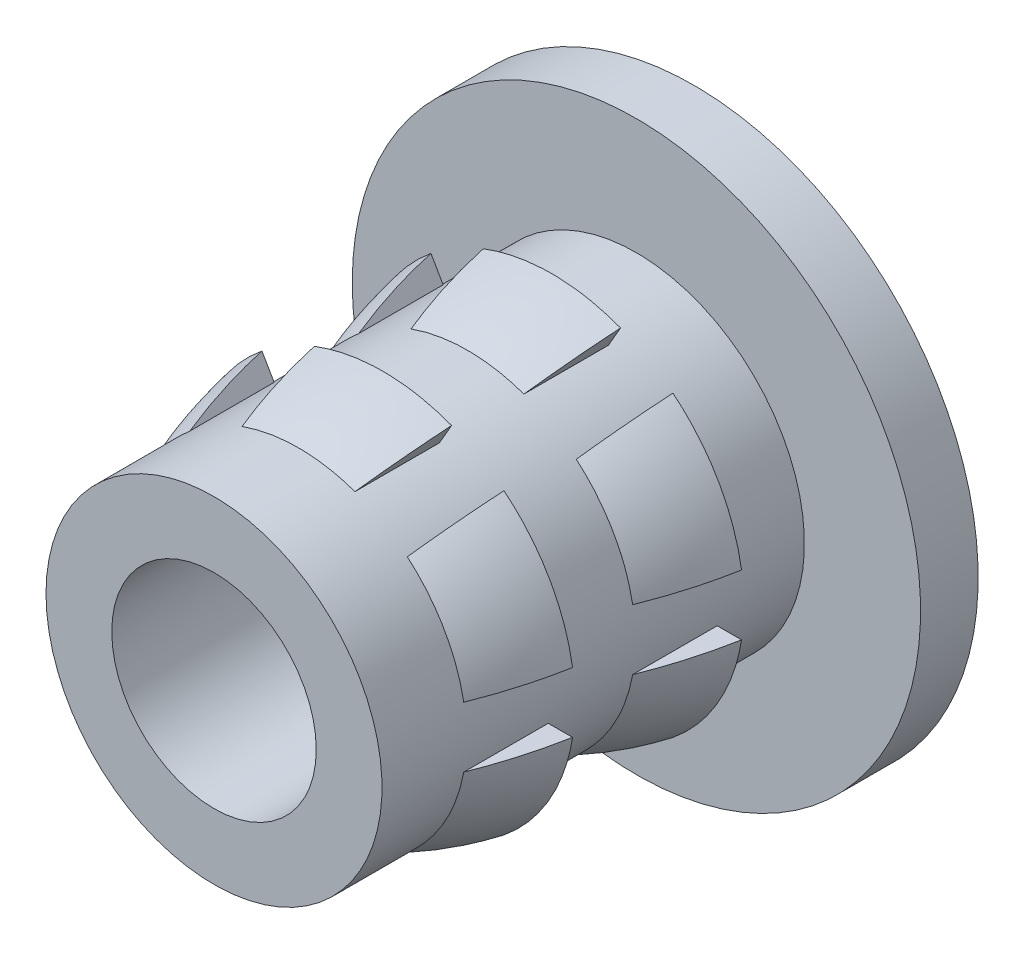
ISO-10303-21;
HEADER;
FILE_DESCRIPTION(('STEP AP214'),'2;1');
FILE_NAME('part.step','',(''),(''),'','','');
FILE_SCHEMA(('AUTOMOTIVE_DESIGN { 1 0 10303 214 1 1 1 1 }'));
ENDSEC;
DATA;
#1=APPLICATION_CONTEXT('core data for automotive mechanical design processes');
#2=APPLICATION_PROTOCOL_DEFINITION('international standard','automotive_design',2000,#1);
#3=PRODUCT_CONTEXT('',#1,'mechanical');
#4=PRODUCT('Part','Part','',(#3));
#5=PRODUCT_RELATED_PRODUCT_CATEGORY('part','',(#4));
#6=PRODUCT_DEFINITION_FORMATION('','',#4);
#7=PRODUCT_DEFINITION_CONTEXT('part definition',#1,'design');
#8=PRODUCT_DEFINITION('design','',#6,#7);
#9=PRODUCT_DEFINITION_SHAPE('','',#8);
#10=(LENGTH_UNIT() NAMED_UNIT(*) SI_UNIT(.MILLI.,.METRE.));
#11=(NAMED_UNIT(*) PLANE_ANGLE_UNIT() SI_UNIT($,.RADIAN.));
#12=(NAMED_UNIT(*) SI_UNIT($,.STERADIAN.) SOLID_ANGLE_UNIT());
#13=UNCERTAINTY_MEASURE_WITH_UNIT(LENGTH_MEASURE(1.E-05),#10,'distance_accuracy_value','');
#14=(GEOMETRIC_REPRESENTATION_CONTEXT(3) GLOBAL_UNCERTAINTY_ASSIGNED_CONTEXT((#13)) GLOBAL_UNIT_ASSIGNED_CONTEXT((#10,
#11,#12)) REPRESENTATION_CONTEXT('',''));
#15=CARTESIAN_POINT('',(0.,0.,0.));
#16=DIRECTION('',(0.,0.,1.));
#17=DIRECTION('',(1.,0.,0.));
#18=AXIS2_PLACEMENT_3D('',#15,#16,#17);
#19=CARTESIAN_POINT('',(9.28064757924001,0.,-19.2776107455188));
#20=DIRECTION('',(0.,0.,-1.));
#21=DIRECTION('',(-1.,0.,0.));
#22=AXIS2_PLACEMENT_3D('',#19,#20,#21);
#23=CONICAL_SURFACE('',#22,2.38760000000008,1.04719755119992);
#24=CARTESIAN_POINT('',(9.28064757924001,0.,-19.2776107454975));
#25=DIRECTION('',(0.,0.,-1.));
#26=DIRECTION('',(-1.,0.,0.));
#27=AXIS2_PLACEMENT_3D('',#24,#25,#26);
#28=CIRCLE('',#27,2.38759999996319);
#29=CARTESIAN_POINT('',(6.89304757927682,0.,-19.2776107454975));
#30=VERTEX_POINT('',#29);
#31=EDGE_CURVE('E743',#30,#30,#28,.T.);
#32=ORIENTED_EDGE('',*,*,#31,.T.);
#33=EDGE_LOOP('',(#32));
#34=FACE_BOUND('',#33,.T.);
#35=CARTESIAN_POINT('',(9.28064757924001,0.,-18.68002434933));
#36=DIRECTION('',(0.,0.,-1.));
#37=DIRECTION('',(-1.,0.,0.));
#38=AXIS2_PLACEMENT_3D('',#35,#36,#37);
#39=CIRCLE('',#38,1.35255);
#40=CARTESIAN_POINT('',(7.92809757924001,0.,-18.68002434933));
#41=VERTEX_POINT('',#40);
#42=EDGE_CURVE('E277',#41,#41,#39,.F.);
#43=ORIENTED_EDGE('',*,*,#42,.T.);
#44=EDGE_LOOP('',(#43));
#45=FACE_BOUND('',#44,.T.);
#46=ADVANCED_FACE('F15',(#34,#45),#23,.F.);
#47=CARTESIAN_POINT('',(11.50314757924,0.,-15.16281074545));
#48=DIRECTION('',(0.,0.,1.));
#49=DIRECTION('',(1.,0.,0.));
#50=AXIS2_PLACEMENT_3D('',#47,#48,#49);
#51=PLANE('',#50);
#52=CARTESIAN_POINT('',(11.7889537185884,0.400000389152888,-15.16281074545));
#53=CARTESIAN_POINT('',(11.777898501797,0.469462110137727,-15.16281074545));
#54=CARTESIAN_POINT('',(11.7639317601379,0.538453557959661,-15.16281074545));
#55=CARTESIAN_POINT('',(11.7302895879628,0.675165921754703,-15.16281074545));
#56=CARTESIAN_POINT('',(11.7106036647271,0.742884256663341,-15.16281074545));
#57=CARTESIAN_POINT('',(11.6653963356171,0.877302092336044,-15.16281074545));
#58=CARTESIAN_POINT('',(11.6398045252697,0.94397800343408,-15.16281074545));
#59=CARTESIAN_POINT('',(11.5830908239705,1.07494090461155,-15.16281074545));
#60=CARTESIAN_POINT('',(11.5519666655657,1.13922690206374,-15.16281074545));
#61=CARTESIAN_POINT('',(11.4505975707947,1.3278610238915,-15.16281074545));
#62=CARTESIAN_POINT('',(11.3723328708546,1.44805386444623,-15.16281074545));
#63=CARTESIAN_POINT('',(11.2253762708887,1.63674807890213,-15.16281074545));
#64=CARTESIAN_POINT('',(11.1618368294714,1.70935578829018,-15.16281074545));
#65=CARTESIAN_POINT('',(11.0270847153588,1.84678349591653,-15.16281074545));
#66=CARTESIAN_POINT('',(10.9558873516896,1.91161850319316,-15.16281074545));
#67=CARTESIAN_POINT('',(10.8812114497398,1.9722563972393,-15.16281074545));
#68=B_SPLINE_CURVE_WITH_KNOTS('',3,(#52,#53,#54,#55,#56,#57,#58,#59,#60,#61,#62,#63,#64,#65,#66,
#67),.UNSPECIFIED.,.F.,.F.,(4,2,2,2,2,2,2,4),(0.,0.210935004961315,0.422259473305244,
0.636246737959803,0.850321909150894,1.27825773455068,1.56714644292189,1.85546800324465),.UNSPECIFIED.);
#69=CARTESIAN_POINT('',(11.7889525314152,0.399999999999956,-15.1628105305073));
#70=VERTEX_POINT('',#69);
#71=CARTESIAN_POINT('',(10.8812108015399,1.97225551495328,-15.16281074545));
#72=VERTEX_POINT('',#71);
#73=EDGE_CURVE('E711',#70,#72,#68,.T.);
#74=ORIENTED_EDGE('',*,*,#73,.F.);
#75=DIRECTION('',(1.,0.,0.));
#76=VECTOR('',#75,1.);
#77=CARTESIAN_POINT('',(11.46685576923,0.399999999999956,-15.16281074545));
#78=LINE('',#77,#76);
#79=CARTESIAN_POINT('',(11.4668557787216,0.39999994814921,-15.16281074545));
#80=VERTEX_POINT('',#79);
#81=EDGE_CURVE('E255',#70,#80,#78,.F.);
#82=ORIENTED_EDGE('',*,*,#81,.T.);
#83=CARTESIAN_POINT('',(9.28064757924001,0.,-15.16281074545));
#84=DIRECTION('',(0.,0.,-1.));
#85=DIRECTION('',(-1.,0.,0.));
#86=AXIS2_PLACEMENT_3D('',#83,#84,#85);
#87=CIRCLE('',#86,2.2225);
#88=CARTESIAN_POINT('',(10.7201611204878,1.69331243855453,-15.16281074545));
#89=VERTEX_POINT('',#88);
#90=EDGE_CURVE('E22',#89,#80,#87,.T.);
#91=ORIENTED_EDGE('',*,*,#90,.F.);
#92=DIRECTION('',(-0.500001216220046,-0.866024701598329,0.));
#93=VECTOR('',#92,1.);
#94=CARTESIAN_POINT('',(10.88121015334,1.97225463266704,-15.16281074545));
#95=LINE('',#94,#93);
#96=EDGE_CURVE('E253',#72,#89,#95,.T.);
#97=ORIENTED_EDGE('',*,*,#96,.F.);
#98=EDGE_LOOP('',(#74,#82,#91,#97));
#99=FACE_BOUND('',#98,.T.);
#100=ADVANCED_FACE('F251',(#99),#51,.F.);
#101=CARTESIAN_POINT('',(8.472776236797,2.06589290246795,-14.03438350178));
#102=CARTESIAN_POINT('',(8.419933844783,2.20102174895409,-14.40176469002));
#103=CARTESIAN_POINT('',(8.380233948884,2.30254253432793,-14.78546969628));
#104=CARTESIAN_POINT('',(8.354839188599,2.36748215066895,-15.17426144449));
#105=CARTESIAN_POINT('',(8.600232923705,2.11574447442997,-14.03438350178));
#106=CARTESIAN_POINT('',(8.555727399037,2.25413408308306,-14.40176469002));
#107=CARTESIAN_POINT('',(8.52229089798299,2.358104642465,-14.78546969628));
#108=CARTESIAN_POINT('',(8.500902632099,2.42461130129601,-15.17426144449));
#109=CARTESIAN_POINT('',(8.86395797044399,2.19196912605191,-14.03438350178));
#110=CARTESIAN_POINT('',(8.83670254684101,2.33534454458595,-14.40176469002));
#111=CARTESIAN_POINT('',(8.81622585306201,2.443060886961,-14.78546969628));
#112=CARTESIAN_POINT('',(8.803127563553,2.51196360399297,-15.17426144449));
#113=CARTESIAN_POINT('',(9.27903933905,2.23097020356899,-14.03438350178));
#114=CARTESIAN_POINT('',(9.278934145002,2.37689665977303,-14.40176469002));
#115=CARTESIAN_POINT('',(9.278855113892,2.48652956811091,-14.78546969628));
#116=CARTESIAN_POINT('',(9.27880456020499,2.55665825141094,-15.17426144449));
#117=CARTESIAN_POINT('',(9.69491500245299,2.19252246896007,-14.03438350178));
#118=CARTESIAN_POINT('',(9.72201199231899,2.33593408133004,-14.40176469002));
#119=CARTESIAN_POINT('',(9.74236965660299,2.44367761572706,-14.78546969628));
#120=CARTESIAN_POINT('',(9.755391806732,2.51259772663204,-15.17426144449));
#121=CARTESIAN_POINT('',(9.960148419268,2.11610072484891,-14.03438350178));
#122=CARTESIAN_POINT('',(10.0045941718,2.25451363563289,-14.40176469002));
#123=CARTESIAN_POINT('',(10.03798576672,2.35850170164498,-14.78546969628));
#124=CARTESIAN_POINT('',(10.05934530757,2.42501955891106,-15.17426144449));
#125=CARTESIAN_POINT('',(10.08849923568,2.06590058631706,-14.03438350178));
#126=CARTESIAN_POINT('',(10.14134034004,2.20102993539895,-14.40176469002));
#127=CARTESIAN_POINT('',(10.18103926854,2.30255109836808,-14.78546969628));
#128=CARTESIAN_POINT('',(10.20643341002,2.367490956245,-15.17426144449));
#129=B_SPLINE_SURFACE_WITH_KNOTS('',3,3,((#101,#102,#103,#104),(#105,#106,#107,#108),(#109,#110,
#111,#112),(#113,#114,#115,#116),(#117,#118,#119,#120),(#121,#122,#123,#124),(#125,#126,#127,
#128)),.UNSPECIFIED.,.F.,.F.,.F.,(4,1,1,1,4),(4,4),(0.3987359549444,0.4477784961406,
0.4948859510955,0.5419934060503,0.5910195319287),(0.00963143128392,0.9903676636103),.UNSPECIFIED.);
#130=CARTESIAN_POINT('',(8.37290467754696,2.37225682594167,-15.1628103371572));
#131=CARTESIAN_POINT('',(8.38192513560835,2.35663293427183,-15.0646397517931));
#132=CARTESIAN_POINT('',(8.39219441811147,2.33884601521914,-14.9669360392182));
#133=CARTESIAN_POINT('',(8.41519932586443,2.29900034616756,-14.7726974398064));
#134=CARTESIAN_POINT('',(8.42793493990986,2.27694161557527,-14.6761625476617));
#135=CARTESIAN_POINT('',(8.46826230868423,2.2070925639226,-14.3991855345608));
#136=CARTESIAN_POINT('',(8.49898663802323,2.15387646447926,-14.2205482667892));
#137=CARTESIAN_POINT('',(8.53395556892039,2.09330849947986,-14.0452096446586));
#138=B_SPLINE_CURVE_WITH_KNOTS('',3,(#130,#131,#132,#133,#134,#135,#136,#137),.UNSPECIFIED.,.F.,
.F.,(4,2,2,4),(0.,0.299396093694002,0.598790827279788,1.16470474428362),.UNSPECIFIED.);
#139=CARTESIAN_POINT('',(8.37290546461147,2.37225599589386,-15.1628105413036));
#140=VERTEX_POINT('',#139);
#141=CARTESIAN_POINT('',(8.53395466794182,2.09331078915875,-14.0452159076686));
#142=VERTEX_POINT('',#141);
#143=EDGE_CURVE('E695',#140,#142,#138,.T.);
#144=CARTESIAN_POINT('',(8.53395414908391,2.09331201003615,-14.0452192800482));
#145=CARTESIAN_POINT('',(8.59364444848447,2.11461146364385,-14.0452682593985));
#146=CARTESIAN_POINT('',(8.65425000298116,2.13334423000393,-14.0452625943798));
#147=CARTESIAN_POINT('',(8.77683264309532,2.16556780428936,-14.0452317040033));
#148=CARTESIAN_POINT('',(8.83880958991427,2.17905914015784,-14.0452064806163));
#149=CARTESIAN_POINT('',(8.9619391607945,2.20039255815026,-14.0452258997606));
#150=CARTESIAN_POINT('',(9.02306624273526,2.20838230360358,-14.045268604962));
#151=CARTESIAN_POINT('',(9.14577160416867,2.219258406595,-14.0452618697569));
#152=CARTESIAN_POINT('',(9.20734987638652,2.22214484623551,-14.0452124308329));
#153=CARTESIAN_POINT('',(9.33242742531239,2.22280347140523,-14.0452099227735));
#154=CARTESIAN_POINT('',(9.39592760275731,2.22041582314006,-14.0452598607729));
#155=CARTESIAN_POINT('',(9.52249415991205,2.21021455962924,-14.0452690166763));
#156=CARTESIAN_POINT('',(9.58556050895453,2.20240056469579,-14.0452282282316));
#157=CARTESIAN_POINT('',(9.71265443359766,2.18108864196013,-14.0452097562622));
#158=CARTESIAN_POINT('',(9.77665490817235,2.16742875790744,-14.0452339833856));
#159=CARTESIAN_POINT('',(9.90320895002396,2.1345276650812,-14.0452630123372));
#160=CARTESIAN_POINT('',(9.96576242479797,2.11528610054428,-14.0452678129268));
#161=CARTESIAN_POINT('',(10.0273413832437,2.09331187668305,-14.0452195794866));
#162=B_SPLINE_CURVE_WITH_KNOTS('',3,(#144,#145,#146,#147,#148,#149,#150,#151,#152,#153,#154,
#155,#156,#157,#158,#159,#160,#161),.UNSPECIFIED.,.F.,.F.,(4,2,2,2,2,2,2,2,4),(0.,
0.190071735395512,0.380124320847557,0.564853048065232,0.74957880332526,0.939979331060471,
1.13039318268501,1.32646364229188,1.52254660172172),.UNSPECIFIED.);
#163=CARTESIAN_POINT('',(10.0273407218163,2.09331078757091,-14.0452164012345));
#164=VERTEX_POINT('',#163);
#165=EDGE_CURVE('E270',#142,#164,#162,.T.);
#166=CARTESIAN_POINT('',(10.0273397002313,2.0933086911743,-14.0452104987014));
#167=CARTESIAN_POINT('',(10.0458381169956,2.12534888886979,-14.1379168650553));
#168=CARTESIAN_POINT('',(10.0631460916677,2.15532718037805,-14.2315632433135));
#169=CARTESIAN_POINT('',(10.0953542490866,2.21111334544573,-14.4204973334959));
#170=CARTESIAN_POINT('',(10.1102544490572,2.23692124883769,-14.5157850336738));
#171=CARTESIAN_POINT('',(10.1498008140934,2.30541756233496,-14.7932130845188));
#172=CARTESIAN_POINT('',(10.1713153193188,2.34268177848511,-14.9771595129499));
#173=CARTESIAN_POINT('',(10.1883904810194,2.37225682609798,-15.1628103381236));
#174=B_SPLINE_CURVE_WITH_KNOTS('',3,(#166,#167,#168,#169,#170,#171,#172,#173),.UNSPECIFIED.,.F.,
.F.,(4,2,2,4),(0.,0.299397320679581,0.598792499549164,1.1647050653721),.UNSPECIFIED.);
#175=CARTESIAN_POINT('',(10.1883901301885,2.37225699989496,-15.1628105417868));
#176=VERTEX_POINT('',#175);
#177=EDGE_CURVE('E701',#164,#176,#174,.T.);
#178=CARTESIAN_POINT('',(10.1883897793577,2.37225717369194,-15.16281074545));
#179=CARTESIAN_POINT('',(10.1217578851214,2.39773319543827,-15.16281074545));
#180=CARTESIAN_POINT('',(10.0540849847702,2.42040503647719,-15.16281074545));
#181=CARTESIAN_POINT('',(9.9170767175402,2.45999294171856,-15.16281074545));
#182=CARTESIAN_POINT('',(9.8477413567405,2.47690902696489,-15.16281074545));
#183=CARTESIAN_POINT('',(9.63779199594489,2.51881837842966,-15.16281074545));
#184=CARTESIAN_POINT('',(9.4953100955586,2.53494394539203,-15.16281074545));
#185=CARTESIAN_POINT('',(9.20941696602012,2.54301704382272,-15.16281074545));
#186=CARTESIAN_POINT('',(9.06600456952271,2.53492346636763,-15.16281074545));
#187=CARTESIAN_POINT('',(8.85374315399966,2.504877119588,-15.16281074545));
#188=CARTESIAN_POINT('',(8.78351863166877,2.49189424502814,-15.16281074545));
#189=CARTESIAN_POINT('',(8.6444283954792,2.4600516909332,-15.16281074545));
#190=CARTESIAN_POINT('',(8.5755618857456,2.44119556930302,-15.16281074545));
#191=CARTESIAN_POINT('',(8.48494961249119,2.41225440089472,-15.16281074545));
#192=CARTESIAN_POINT('',(8.46237246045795,2.40469335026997,-15.16281074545));
#193=CARTESIAN_POINT('',(8.41745967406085,2.38894538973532,-15.16281074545));
#194=CARTESIAN_POINT('',(8.39512384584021,2.38075903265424,-15.16281074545));
#195=CARTESIAN_POINT('',(8.37290537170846,2.37225717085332,-15.16281074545));
#196=B_SPLINE_CURVE_WITH_KNOTS('',3,(#178,#179,#180,#181,#182,#183,#184,#185,#186,#187,#188,
#189,#190,#191,#192,#193,#194,#195),.UNSPECIFIED.,.F.,.F.,(4,2,2,2,2,2,2,2,4),(0.,
0.2138869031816,0.427773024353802,0.855784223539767,1.28452232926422,1.49856133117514,
1.71247092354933,1.7838933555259,1.85525335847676),.UNSPECIFIED.);
#197=EDGE_CURVE('E670',#176,#140,#196,.T.);
#198=ORIENTED_EDGE('',*,*,#143,.T.);
#199=ORIENTED_EDGE('',*,*,#165,.T.);
#200=ORIENTED_EDGE('',*,*,#177,.T.);
#201=ORIENTED_EDGE('',*,*,#197,.T.);
#202=EDGE_LOOP('',(#198,#199,#200,#201));
#203=FACE_BOUND('',#202,.T.);
#204=ADVANCED_FACE('F634',(#203),#129,.T.);
#205=CARTESIAN_POINT('',(8.472786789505,2.06586594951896,-16.26959387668));
#206=CARTESIAN_POINT('',(8.41958781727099,2.20190664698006,-16.63658541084));
#207=CARTESIAN_POINT('',(8.379866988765,2.30348096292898,-17.0204927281));
#208=CARTESIAN_POINT('',(8.354850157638,2.36745413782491,-17.40946777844));
#209=CARTESIAN_POINT('',(8.600241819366,2.11571687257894,-16.26959387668));
#210=CARTESIAN_POINT('',(8.555435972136,2.25504033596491,-16.63658541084));
#211=CARTESIAN_POINT('',(8.521981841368,2.35906571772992,-17.0204927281));
#212=CARTESIAN_POINT('',(8.500911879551,2.42458261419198,-17.40946777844));
#213=CARTESIAN_POINT('',(8.863963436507,2.19194052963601,-16.26959387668));
#214=CARTESIAN_POINT('',(8.83652409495,2.33628344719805,-16.63658541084));
#215=CARTESIAN_POINT('',(8.81603660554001,2.44405658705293,-17.0204927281));
#216=CARTESIAN_POINT('',(8.80313324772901,2.51193388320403,-17.40946777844));
#217=CARTESIAN_POINT('',(9.279039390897,2.23094109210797,-16.26959387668));
#218=CARTESIAN_POINT('',(9.278933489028,2.377852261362,-16.63658541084));
#219=CARTESIAN_POINT('',(9.27885441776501,2.48754297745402,-17.0204927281));
#220=CARTESIAN_POINT('',(9.27880461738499,2.55662799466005,-17.40946777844));
#221=CARTESIAN_POINT('',(9.694909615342,2.1924938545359,-16.26959387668));
#222=CARTESIAN_POINT('',(9.722189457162,2.33687320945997,-16.63658541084));
#223=CARTESIAN_POINT('',(9.742557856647,2.4446735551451,-17.0204927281));
#224=CARTESIAN_POINT('',(9.755386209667,2.51256798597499,-17.40946777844));
#225=CARTESIAN_POINT('',(9.96013955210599,2.11607311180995,-16.26959387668));
#226=CARTESIAN_POINT('',(10.00488522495,2.25542003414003,-16.63658541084));
#227=CARTESIAN_POINT('',(10.03829442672,2.35946293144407,-17.0204927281));
#228=CARTESIAN_POINT('',(10.05933609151,2.42499085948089,-17.40946777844));
#229=CARTESIAN_POINT('',(10.08848868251,2.06587363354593,-16.26959387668));
#230=CARTESIAN_POINT('',(10.14168635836,2.20191483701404,-16.63658541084));
#231=CARTESIAN_POINT('',(10.18140621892,2.30348953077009,-17.0204927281));
#232=CARTESIAN_POINT('',(10.20642244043,2.36746294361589,-17.40946777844));
#233=B_SPLINE_SURFACE_WITH_KNOTS('',3,3,((#205,#206,#207,#208),(#209,#210,#211,#212),(#213,#214,
#215,#216),(#217,#218,#219,#220),(#221,#222,#223,#224),(#225,#226,#227,#228),(#229,#230,#231,
#232)),.UNSPECIFIED.,.F.,.F.,.F.,(4,1,1,1,4),(4,4),(0.3987360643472,0.4477786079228,
0.4948860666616,0.5419935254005,0.5910196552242),(0.009632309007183,0.9903667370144),.UNSPECIFIED.);
#234=CARTESIAN_POINT('',(8.37290467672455,2.37225682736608,-17.3980103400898));
#235=CARTESIAN_POINT('',(8.38179732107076,2.35685431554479,-17.2997419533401));
#236=CARTESIAN_POINT('',(8.39197926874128,2.33921866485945,-17.2019411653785));
#237=CARTESIAN_POINT('',(8.41487863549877,2.29955579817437,-17.0075345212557));
#238=CARTESIAN_POINT('',(8.42759604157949,2.27752860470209,-16.9109286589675));
#239=CARTESIAN_POINT('',(8.45474594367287,2.23050359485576,-16.7245080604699));
#240=CARTESIAN_POINT('',(8.46904355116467,2.20573941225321,-16.6346146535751));
#241=CARTESIAN_POINT('',(8.49984751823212,2.15238537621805,-16.4563258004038));
#242=CARTESIAN_POINT('',(8.51635451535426,2.12379441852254,-16.3679307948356));
#243=CARTESIAN_POINT('',(8.53395511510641,2.0933092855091,-16.2804119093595));
#244=B_SPLINE_CURVE_WITH_KNOTS('',3,(#234,#235,#236,#237,#238,#239,#240,#241,#242,#243),
.UNSPECIFIED.,.F.,.F.,(4,2,2,2,4),(0.,0.299559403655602,0.599117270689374,0.881999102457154,
1.16496273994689),.UNSPECIFIED.);
#245=CARTESIAN_POINT('',(8.37290547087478,2.37225599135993,-17.3980105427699));
#246=VERTEX_POINT('',#245);
#247=CARTESIAN_POINT('',(8.53395442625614,2.0933107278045,-16.2804159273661));
#248=VERTEX_POINT('',#247);
#249=EDGE_CURVE('E648',#246,#248,#244,.T.);
#250=CARTESIAN_POINT('',(8.53395383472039,2.09331189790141,-16.2804192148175));
#251=CARTESIAN_POINT('',(8.59364413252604,2.1146113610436,-16.2804678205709));
#252=CARTESIAN_POINT('',(8.65424968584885,2.13334413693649,-16.2804621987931));
#253=CARTESIAN_POINT('',(8.77683232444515,2.16556773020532,-16.2804315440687));
#254=CARTESIAN_POINT('',(8.83880927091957,2.17905907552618,-16.2804065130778));
#255=CARTESIAN_POINT('',(8.96193884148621,2.20039251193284,-16.2804257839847));
#256=CARTESIAN_POINT('',(9.02306592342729,2.20838226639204,-16.2804681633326));
#257=CARTESIAN_POINT('',(9.1457712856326,2.21925838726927,-16.280461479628));
#258=CARTESIAN_POINT('',(9.20734955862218,2.22214483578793,-16.2804124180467));
#259=CARTESIAN_POINT('',(9.33242713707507,2.22280347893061,-16.2804099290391));
#260=CARTESIAN_POINT('',(9.39592734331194,2.22041583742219,-16.2804594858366));
#261=CARTESIAN_POINT('',(9.52249395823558,2.21021458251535,-16.2804685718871));
#262=CARTESIAN_POINT('',(9.58556033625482,2.20240058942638,-16.2804280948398));
#263=CARTESIAN_POINT('',(9.71265432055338,2.18108866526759,-16.2804097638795));
#264=CARTESIAN_POINT('',(9.77665482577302,2.1674287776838,-16.2804338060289));
#265=CARTESIAN_POINT('',(9.90320892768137,2.13452767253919,-16.2804626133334));
#266=CARTESIAN_POINT('',(9.96576243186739,2.11528609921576,-16.2804673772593));
#267=CARTESIAN_POINT('',(10.0273414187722,2.09331186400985,-16.2804195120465));
#268=B_SPLINE_CURVE_WITH_KNOTS('',3,(#250,#251,#252,#253,#254,#255,#256,#257,#258,#259,#260,
#261,#262,#263,#264,#265,#266,#267),.UNSPECIFIED.,.F.,.F.,(4,2,2,2,2,2,2,2,4),(0.,
0.190071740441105,0.380124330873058,0.564853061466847,0.749578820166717,0.939979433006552,
1.13039336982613,1.32646392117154,1.52254697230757),.UNSPECIFIED.);
#269=CARTESIAN_POINT('',(10.0273407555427,2.09331067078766,-16.2804161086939));
#270=VERTEX_POINT('',#269);
#271=EDGE_CURVE('E272',#248,#270,#268,.T.);
#272=CARTESIAN_POINT('',(10.0273399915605,2.09330919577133,-16.280411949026));
#273=CARTESIAN_POINT('',(10.0459725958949,2.12558181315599,-16.3730646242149));
#274=CARTESIAN_POINT('',(10.0633803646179,2.1557329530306,-16.466700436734));
#275=CARTESIAN_POINT('',(10.0957226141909,2.21175137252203,-16.6556649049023));
#276=CARTESIAN_POINT('',(10.1106571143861,2.23761868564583,-16.7509935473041));
#277=CARTESIAN_POINT('',(10.1372676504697,2.2837094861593,-16.9377256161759));
#278=CARTESIAN_POINT('',(10.1490787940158,2.30416698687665,-17.0290521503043));
#279=CARTESIAN_POINT('',(10.1704407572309,2.34116699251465,-17.2127826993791));
#280=CARTESIAN_POINT('',(10.1799909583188,2.35770842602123,-17.305187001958));
#281=CARTESIAN_POINT('',(10.1883904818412,2.37225682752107,-17.3980103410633));
#282=B_SPLINE_CURVE_WITH_KNOTS('',3,(#272,#273,#274,#275,#276,#277,#278,#279,#280,#281),
.UNSPECIFIED.,.F.,.F.,(4,2,2,2,4),(0.,0.299560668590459,0.599118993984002,0.88200218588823,
1.16496268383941),.UNSPECIFIED.);
#283=CARTESIAN_POINT('',(10.1883901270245,2.37225700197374,-17.3980105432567));
#284=VERTEX_POINT('',#283);
#285=EDGE_CURVE('E662',#270,#284,#282,.T.);
#286=CARTESIAN_POINT('',(10.1883897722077,2.3722571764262,-17.39801074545));
#287=CARTESIAN_POINT('',(10.1217577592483,2.39773324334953,-17.39801074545));
#288=CARTESIAN_POINT('',(10.0540847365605,2.42040511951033,-17.39801074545));
#289=CARTESIAN_POINT('',(9.91707621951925,2.45999307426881,-17.39801074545));
#290=CARTESIAN_POINT('',(9.84774073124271,2.47690917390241,-17.39801074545));
#291=CARTESIAN_POINT('',(9.63779098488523,2.51881853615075,-17.39801074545));
#292=CARTESIAN_POINT('',(9.49530882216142,2.53494406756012,-17.39801074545));
#293=CARTESIAN_POINT('',(9.20941543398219,2.54301700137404,-17.39801074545));
#294=CARTESIAN_POINT('',(9.0660030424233,2.53492333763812,-17.39801074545));
#295=CARTESIAN_POINT('',(8.85374164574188,2.50487686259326,-17.39801074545));
#296=CARTESIAN_POINT('',(8.78351713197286,2.49189394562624,-17.39801074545));
#297=CARTESIAN_POINT('',(8.64442691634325,2.46005130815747,-17.39801074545));
#298=CARTESIAN_POINT('',(8.5755604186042,2.44119514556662,-17.39801074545));
#299=CARTESIAN_POINT('',(8.48494840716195,2.41225400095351,-17.39801074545));
#300=CARTESIAN_POINT('',(8.46237150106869,2.40469302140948,-17.39801074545));
#301=CARTESIAN_POINT('',(8.41745920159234,2.3889452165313,-17.39801074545));
#302=CARTESIAN_POINT('',(8.39512361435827,2.38075894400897,-17.39801074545));
#303=CARTESIAN_POINT('',(8.3729053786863,2.37225717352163,-17.39801074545));
#304=B_SPLINE_CURVE_WITH_KNOTS('',3,(#286,#287,#288,#289,#290,#291,#292,#293,#294,#295,#296,
#297,#298,#299,#300,#301,#302,#303),.UNSPECIFIED.,.F.,.F.,(4,2,2,2,2,2,2,2,4),(0.,
0.21388728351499,0.427773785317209,0.85578574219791,1.28452384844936,1.498562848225,
1.71247243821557,1.78389410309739,1.85525334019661),.UNSPECIFIED.);
#305=EDGE_CURVE('E656',#284,#246,#304,.T.);
#306=ORIENTED_EDGE('',*,*,#249,.T.);
#307=ORIENTED_EDGE('',*,*,#271,.T.);
#308=ORIENTED_EDGE('',*,*,#285,.T.);
#309=ORIENTED_EDGE('',*,*,#305,.T.);
#310=EDGE_LOOP('',(#306,#307,#308,#309));
#311=FACE_BOUND('',#310,.T.);
#312=ADVANCED_FACE('F621',(#311),#233,.T.);
#313=CARTESIAN_POINT('',(11.50314757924,0.,-17.39801074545));
#314=DIRECTION('',(0.,0.,1.));
#315=DIRECTION('',(1.,0.,0.));
#316=AXIS2_PLACEMENT_3D('',#313,#314,#315);
#317=PLANE('',#316);
#318=CARTESIAN_POINT('',(11.78895370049,0.40000050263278,-17.39801074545));
#319=CARTESIAN_POINT('',(11.7778984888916,0.469462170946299,-17.39801074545));
#320=CARTESIAN_POINT('',(11.763931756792,0.538453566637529,-17.39801074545));
#321=CARTESIAN_POINT('',(11.7302896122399,0.675165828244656,-17.39801074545));
#322=CARTESIAN_POINT('',(11.710603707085,0.742884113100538,-17.39801074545));
#323=CARTESIAN_POINT('',(11.665396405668,0.877301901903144,-17.39801074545));
#324=CARTESIAN_POINT('',(11.6398046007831,0.943977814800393,-17.39801074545));
#325=CARTESIAN_POINT('',(11.5830909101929,1.07494072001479,-17.39801074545));
#326=CARTESIAN_POINT('',(11.5519667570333,1.13922671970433,-17.39801074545));
#327=CARTESIAN_POINT('',(11.4505976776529,1.32786084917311,-17.39801074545));
#328=CARTESIAN_POINT('',(11.3723329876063,1.4480536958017,-17.39801074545));
#329=CARTESIAN_POINT('',(11.2253763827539,1.63674794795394,-17.39801074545));
#330=CARTESIAN_POINT('',(11.1618369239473,1.7093556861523,-17.39801074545));
#331=CARTESIAN_POINT('',(11.0270847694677,1.84678344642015,-17.39801074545));
#332=CARTESIAN_POINT('',(10.9558873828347,1.91161847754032,-17.39801074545));
#333=CARTESIAN_POINT('',(10.881211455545,1.97225639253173,-17.39801074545));
#334=B_SPLINE_CURVE_WITH_KNOTS('',3,(#318,#319,#320,#321,#322,#323,#324,#325,#326,#327,#328,
#329,#330,#331,#332,#333),.UNSPECIFIED.,.F.,.F.,(4,2,2,2,2,2,2,4),(0.,0.210934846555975,
0.422259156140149,0.636246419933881,0.850321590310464,1.27825741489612,1.56714622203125,
1.85546788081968),.UNSPECIFIED.);
#335=CARTESIAN_POINT('',(11.788952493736,0.399999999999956,-17.3980105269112));
#336=VERTEX_POINT('',#335);
#337=CARTESIAN_POINT('',(10.8812108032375,1.97225550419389,-17.39801074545));
#338=VERTEX_POINT('',#337);
#339=EDGE_CURVE('E760',#336,#338,#334,.T.);
#340=ORIENTED_EDGE('',*,*,#339,.F.);
#341=DIRECTION('',(1.,0.,0.));
#342=VECTOR('',#341,1.);
#343=CARTESIAN_POINT('',(11.46685576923,0.399999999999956,-17.39801074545));
#344=LINE('',#343,#342);
#345=CARTESIAN_POINT('',(11.4668557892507,0.399999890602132,-17.39801074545));
#346=VERTEX_POINT('',#345);
#347=EDGE_CURVE('E775',#336,#346,#344,.F.);
#348=ORIENTED_EDGE('',*,*,#347,.T.);
#349=CARTESIAN_POINT('',(9.28064757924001,0.,-17.39801074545));
#350=DIRECTION('',(0.,0.,-1.));
#351=DIRECTION('',(-1.,0.,0.));
#352=AXIS2_PLACEMENT_3D('',#349,#350,#351);
#353=CIRCLE('',#352,2.2225);
#354=CARTESIAN_POINT('',(10.7201619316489,1.69331174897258,-17.39801074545));
#355=VERTEX_POINT('',#354);
#356=EDGE_CURVE('E1448',#355,#346,#353,.T.);
#357=ORIENTED_EDGE('',*,*,#356,.F.);
#358=DIRECTION('',(-0.500001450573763,-0.866024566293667,0.));
#359=VECTOR('',#358,1.);
#360=CARTESIAN_POINT('',(10.88121015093,1.97225461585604,-17.39801074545));
#361=LINE('',#360,#359);
#362=EDGE_CURVE('E275',#338,#355,#361,.T.);
#363=ORIENTED_EDGE('',*,*,#362,.F.);
#364=EDGE_LOOP('',(#340,#348,#357,#363));
#365=FACE_BOUND('',#364,.T.);
#366=ADVANCED_FACE('F619',(#365),#317,.F.);
#367=CARTESIAN_POINT('',(7.087595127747,0.333308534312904,-14.03438350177));
#368=CARTESIAN_POINT('',(6.94414884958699,0.355110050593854,-14.40176469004));
#369=CARTESIAN_POINT('',(6.836379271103,0.371489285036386,-14.78546969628));
#370=CARTESIAN_POINT('',(6.767442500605,0.381966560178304,-15.17426144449));
#371=CARTESIAN_POINT('',(7.104254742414,0.442883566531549,-14.03438350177));
#372=CARTESIAN_POINT('',(6.961898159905,0.471852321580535,-14.40176469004));
#373=CARTESIAN_POINT('',(6.854947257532,0.493616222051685,-14.78546969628));
#374=CARTESIAN_POINT('',(6.78653416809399,0.507537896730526,-15.17426144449));
#375=CARTESIAN_POINT('',(7.154830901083,0.668585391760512,-14.03438350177));
#376=CARTESIAN_POINT('',(7.015782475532,0.71231717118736,-14.40176469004));
#377=CARTESIAN_POINT('',(6.91131695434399,0.745172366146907,-14.78546969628));
#378=CARTESIAN_POINT('',(6.844493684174,0.766188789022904,-15.17426144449));
#379=CARTESIAN_POINT('',(7.30195607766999,1.02962028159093,-14.03438350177));
#380=CARTESIAN_POINT('',(7.172531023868,1.09696714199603,-14.40176469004));
#381=CARTESIAN_POINT('',(7.075295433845,1.14756408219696,-14.78546969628));
#382=CARTESIAN_POINT('',(7.013096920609,1.17992933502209,-15.17426144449));
#383=CARTESIAN_POINT('',(7.536177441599,1.39562152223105,-14.03438350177));
#384=CARTESIAN_POINT('',(7.42207267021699,1.48690830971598,-14.40176469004));
#385=CARTESIAN_POINT('',(7.33634703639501,1.55549104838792,-14.78546969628));
#386=CARTESIAN_POINT('',(7.281511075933,1.59936124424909,-15.17426144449));
#387=CARTESIAN_POINT('',(7.76242902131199,1.62623449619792,-14.03438350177));
#388=CARTESIAN_POINT('',(7.66312323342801,1.73260554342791,-14.40176469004));
#389=CARTESIAN_POINT('',(7.58851590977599,1.81252091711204,-14.78546969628));
#390=CARTESIAN_POINT('',(7.540791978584,1.86364023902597,-15.17426144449));
#391=CARTESIAN_POINT('',(7.895502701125,1.73261190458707,-14.03438350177));
#392=CARTESIAN_POINT('',(7.80490118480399,1.84594103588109,-14.40176469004));
#393=CARTESIAN_POINT('',(7.736833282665,1.93108394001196,-14.78546969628));
#394=CARTESIAN_POINT('',(7.693292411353,1.98554714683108,-15.17426144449));
#395=B_SPLINE_SURFACE_WITH_KNOTS('',3,3,((#367,#368,#369,#370),(#371,#372,#373,#374),(#375,#376,
#377,#378),(#379,#380,#381,#382),(#383,#384,#385,#386),(#387,#388,#389,#390),(#391,#392,#393,
#394)),.UNSPECIFIED.,.F.,.F.,.F.,(4,1,1,1,4),(4,4),(0.05316043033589,0.1207287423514,
0.1850130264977,0.2492973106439,0.3156966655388),(0.009631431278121,0.9903676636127),.UNSPECIFIED.);
#396=CARTESIAN_POINT('',(6.77234145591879,0.399999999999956,-15.1628103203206));
#397=CARTESIAN_POINT('',(6.7903840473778,0.399999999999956,-15.0646306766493));
#398=CARTESIAN_POINT('',(6.81092466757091,0.399999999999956,-14.9669179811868));
#399=CARTESIAN_POINT('',(6.85693927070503,0.399999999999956,-14.7726615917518));
#400=CARTESIAN_POINT('',(6.88241323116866,0.399999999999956,-14.6761178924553));
#401=CARTESIAN_POINT('',(6.96306687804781,0.399999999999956,-14.3991495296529));
#402=CARTESIAN_POINT('',(7.02450923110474,0.399999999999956,-14.2205290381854));
#403=CARTESIAN_POINT('',(7.09443844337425,0.399999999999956,-14.0452062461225));
#404=B_SPLINE_CURVE_WITH_KNOTS('',3,(#396,#397,#398,#399,#400,#401,#402,#403),.UNSPECIFIED.,.F.,
.F.,(4,2,2,4),(0.,0.299423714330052,0.598846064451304,1.16470652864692),.UNSPECIFIED.);
#405=CARTESIAN_POINT('',(6.77234263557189,0.400000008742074,-15.1628105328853));
#406=VERTEX_POINT('',#405);
#407=CARTESIAN_POINT('',(7.09443896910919,0.40000028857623,-14.0452050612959));
#408=VERTEX_POINT('',#407);
#409=EDGE_CURVE('E603',#406,#408,#404,.T.);
#410=CARTESIAN_POINT('',(7.09443949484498,0.400000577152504,-14.0452038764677));
#411=CARTESIAN_POINT('',(7.10583878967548,0.462343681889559,-14.0451826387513));
#412=CARTESIAN_POINT('',(7.11991853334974,0.524196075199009,-14.0451837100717));
#413=CARTESIAN_POINT('',(7.15330346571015,0.646467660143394,-14.0451956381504));
#414=CARTESIAN_POINT('',(7.17260812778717,0.706886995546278,-14.0452064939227));
#415=CARTESIAN_POINT('',(7.21569769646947,0.824187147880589,-14.0452032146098));
#416=CARTESIAN_POINT('',(7.23934195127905,0.881119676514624,-14.045189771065));
#417=CARTESIAN_POINT('',(7.29127573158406,0.992823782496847,-14.0451959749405));
#418=CARTESIAN_POINT('',(7.31956518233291,1.04759539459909,-14.0452156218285));
#419=CARTESIAN_POINT('',(7.38153360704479,1.15624501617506,-14.0452164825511));
#420=CARTESIAN_POINT('',(7.41535144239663,1.21004389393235,-14.0451964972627));
#421=CARTESIAN_POINT('',(7.48746922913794,1.31455299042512,-14.0451905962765));
#422=CARTESIAN_POINT('',(7.52576949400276,1.36526299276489,-14.0452046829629));
#423=CARTESIAN_POINT('',(7.60777305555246,1.46467348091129,-14.0452425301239));
#424=CARTESIAN_POINT('',(7.65160305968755,1.5132695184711,-14.0452665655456));
#425=CARTESIAN_POINT('',(7.74337317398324,1.60641788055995,-14.0452795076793));
#426=CARTESIAN_POINT('',(7.79131354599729,1.65096994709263,-14.0452684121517));
#427=CARTESIAN_POINT('',(7.84113320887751,1.6933117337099,-14.0452173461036));
#428=B_SPLINE_CURVE_WITH_KNOTS('',3,(#410,#411,#412,#413,#414,#415,#416,#417,#418,#419,#420,
#421,#422,#423,#424,#425,#426,#427),.UNSPECIFIED.,.F.,.F.,(4,2,2,2,2,2,2,2,4),(0.,
0.190071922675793,0.380124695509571,0.564853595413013,0.749579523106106,0.939979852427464,
1.13039350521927,1.32646376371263,1.5225465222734),.UNSPECIFIED.);
#429=CARTESIAN_POINT('',(7.84113386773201,1.69331053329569,-14.045213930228));
#430=VERTEX_POINT('',#429);
#431=EDGE_CURVE('E372',#408,#430,#428,.T.);
#432=CARTESIAN_POINT('',(7.84113527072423,1.69330845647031,-14.045207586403));
#433=CARTESIAN_POINT('',(7.82263518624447,1.72535154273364,-14.1379225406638));
#434=CARTESIAN_POINT('',(7.80532575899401,1.75533235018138,-14.2315776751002));
#435=CARTESIAN_POINT('',(7.77311513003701,1.81112279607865,-14.4205295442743));
#436=CARTESIAN_POINT('',(7.75821391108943,1.83693246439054,-14.5158262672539));
#437=CARTESIAN_POINT('',(7.71867001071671,1.90542450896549,-14.7932471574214));
#438=CARTESIAN_POINT('',(7.69715794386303,1.94268450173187,-14.9771767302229));
#439=CARTESIAN_POINT('',(7.68008435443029,1.97225682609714,-15.1628103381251));
#440=B_SPLINE_CURVE_WITH_KNOTS('',3,(#432,#433,#434,#435,#436,#437,#438,#439),.UNSPECIFIED.,.F.,
.F.,(4,2,2,4),(0.,0.299424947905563,0.598847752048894,1.1647079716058),.UNSPECIFIED.);
#441=CARTESIAN_POINT('',(7.68008402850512,1.97225660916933,-15.1628105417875));
#442=VERTEX_POINT('',#441);
#443=EDGE_CURVE('E609',#430,#442,#440,.T.);
#444=CARTESIAN_POINT('',(7.68008370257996,1.97225639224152,-15.16281074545));
#445=CARTESIAN_POINT('',(7.62466136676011,1.92727510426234,-15.16281074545));
#446=CARTESIAN_POINT('',(7.57114636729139,1.8799506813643,-15.16281074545));
#447=CARTESIAN_POINT('',(7.46827891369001,1.78097387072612,-15.16281074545));
#448=CARTESIAN_POINT('',(7.41892651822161,1.72932142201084,-15.16281074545));
#449=CARTESIAN_POINT('',(7.32466195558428,1.62196641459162,-15.16281074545));
#450=CARTESIAN_POINT('',(7.27975666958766,1.56625780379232,-15.16281074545));
#451=CARTESIAN_POINT('',(7.19483238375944,1.45125877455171,-15.16281074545));
#452=CARTESIAN_POINT('',(7.15481305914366,1.39196859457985,-15.16281074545));
#453=CARTESIAN_POINT('',(7.04247459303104,1.20935285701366,-15.16281074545));
#454=CARTESIAN_POINT('',(6.97780992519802,1.08120782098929,-15.16281074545));
#455=CARTESIAN_POINT('',(6.87111008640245,0.816177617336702,-15.16281074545));
#456=CARTESIAN_POINT('',(6.8290131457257,0.679317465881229,-15.16281074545));
#457=CARTESIAN_POINT('',(6.79367136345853,0.51687782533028,-15.16281074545));
#458=CARTESIAN_POINT('',(6.78894488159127,0.493575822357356,-15.16281074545));
#459=CARTESIAN_POINT('',(6.78015119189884,0.446868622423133,-15.16281074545));
#460=CARTESIAN_POINT('',(6.77608341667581,0.423463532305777,-15.16281074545));
#461=CARTESIAN_POINT('',(6.77234144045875,0.400000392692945,-15.16281074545));
#462=B_SPLINE_CURVE_WITH_KNOTS('',3,(#444,#445,#446,#447,#448,#449,#450,#451,#452,#453,#454,
#455,#456,#457,#458,#459,#460,#461),.UNSPECIFIED.,.F.,.F.,(4,2,2,2,2,2,2,2,4),(0.,
0.214065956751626,0.428134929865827,0.642530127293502,0.856911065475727,1.28538055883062,
1.71267122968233,1.78399757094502,1.85526214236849),.UNSPECIFIED.);
#463=EDGE_CURVE('E580',#442,#406,#462,.T.);
#464=ORIENTED_EDGE('',*,*,#409,.T.);
#465=ORIENTED_EDGE('',*,*,#431,.T.);
#466=ORIENTED_EDGE('',*,*,#443,.T.);
#467=ORIENTED_EDGE('',*,*,#463,.T.);
#468=EDGE_LOOP('',(#464,#465,#466,#467));
#469=FACE_BOUND('',#468,.T.);
#470=ADVANCED_FACE('F614',(#469),#395,.T.);
#471=CARTESIAN_POINT('',(7.087623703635,0.333303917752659,-16.26959387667));
#472=CARTESIAN_POINT('',(6.943209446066,0.355252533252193,-16.63658541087));
#473=CARTESIAN_POINT('',(6.83538304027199,0.371640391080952,-17.0204927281));
#474=CARTESIAN_POINT('',(6.76747219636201,0.38196173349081,-17.40946777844));
#475=CARTESIAN_POINT('',(7.104283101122,0.442877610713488,-16.26959387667));
#476=CARTESIAN_POINT('',(6.960965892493,0.472041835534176,-16.63658541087));
#477=CARTESIAN_POINT('',(6.853958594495,0.493817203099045,-17.0204927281));
#478=CARTESIAN_POINT('',(6.786563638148,0.507531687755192,-17.40946777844));
#479=CARTESIAN_POINT('',(7.154858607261,0.668576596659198,-16.26959387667));
#480=CARTESIAN_POINT('',(7.01487187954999,0.712603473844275,-16.63658541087));
#481=CARTESIAN_POINT('',(6.91035127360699,0.745475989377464,-17.0204927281));
#482=CARTESIAN_POINT('',(6.84452247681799,0.766179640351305,-17.40946777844));
#483=CARTESIAN_POINT('',(7.30198191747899,1.02960688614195,-16.26959387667));
#484=CARTESIAN_POINT('',(7.171683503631,1.09740820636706,-16.63658541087));
#485=CARTESIAN_POINT('',(7.07439664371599,1.14803182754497,-17.0204927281));
#486=CARTESIAN_POINT('',(7.013123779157,1.17991541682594,-17.40946777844));
#487=CARTESIAN_POINT('',(7.536200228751,1.39560333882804,-16.26959387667));
#488=CARTESIAN_POINT('',(7.421325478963,1.48750613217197,-16.63658541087));
#489=CARTESIAN_POINT('',(7.33555464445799,1.5561250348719,-17.0204927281));
#490=CARTESIAN_POINT('',(7.281534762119,1.59934234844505,-17.40946777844));
#491=CARTESIAN_POINT('',(7.76244884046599,1.62621328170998,-16.26959387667));
#492=CARTESIAN_POINT('',(7.66247293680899,1.73330212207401,-16.63658541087));
#493=CARTESIAN_POINT('',(7.587826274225,1.81325963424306,-17.0204927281));
#494=CARTESIAN_POINT('',(7.540812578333,1.86361819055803,-17.40946777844));
#495=CARTESIAN_POINT('',(7.89552076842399,1.73258929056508,-16.26959387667));
#496=CARTESIAN_POINT('',(7.804307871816,1.84668316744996,-16.63658541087));
#497=CARTESIAN_POINT('',(7.736204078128,1.93187096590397,-17.0204927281));
#498=CARTESIAN_POINT('',(7.69331118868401,1.985523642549,-17.40946777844));
#499=B_SPLINE_SURFACE_WITH_KNOTS('',3,3,((#471,#472,#473,#474),(#475,#476,#477,#478),(#479,#480,
#481,#482),(#483,#484,#485,#486),(#487,#488,#489,#490),(#491,#492,#493,#494),(#495,#496,#497,
#498)),.UNSPECIFIED.,.F.,.F.,.F.,(4,1,1,1,4),(4,4),(0.05316053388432,0.1207288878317,
0.1850131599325,0.2492974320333,0.3156967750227),(0.0096323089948,0.9903667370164),.UNSPECIFIED.);
#500=CARTESIAN_POINT('',(6.77234145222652,0.399999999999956,-17.3980103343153));
#501=CARTESIAN_POINT('',(6.79012838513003,0.399999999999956,-17.2997328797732));
#502=CARTESIAN_POINT('',(6.81049433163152,0.399999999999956,-17.2019231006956));
#503=CARTESIAN_POINT('',(6.85629787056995,0.399999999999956,-17.0074986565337));
#504=CARTESIAN_POINT('',(6.88173543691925,0.399999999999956,-16.9108839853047));
#505=CARTESIAN_POINT('',(6.93603618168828,0.399999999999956,-16.7244635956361));
#506=CARTESIAN_POINT('',(6.96462870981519,0.399999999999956,-16.6345789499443));
#507=CARTESIAN_POINT('',(7.02623010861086,0.399999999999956,-16.4563072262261));
#508=CARTESIAN_POINT('',(7.05924025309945,0.399999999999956,-16.3679205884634));
#509=CARTESIAN_POINT('',(7.09443702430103,0.399999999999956,-16.2804098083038));
#510=B_SPLINE_CURVE_WITH_KNOTS('',3,(#500,#501,#502,#503,#504,#505,#506,#507,#508,#509),
.UNSPECIFIED.,.F.,.F.,(4,2,2,2,4),(0.,0.299587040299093,0.599172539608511,0.882026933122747,
1.1649630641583),.UNSPECIFIED.);
#511=CARTESIAN_POINT('',(6.77234260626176,0.399999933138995,-17.3980105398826));
#512=VERTEX_POINT('',#511);
#513=CARTESIAN_POINT('',(7.09443819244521,0.399999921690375,-16.2804068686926));
#514=VERTEX_POINT('',#513);
#515=EDGE_CURVE('E567',#512,#514,#510,.T.);
#516=CARTESIAN_POINT('',(7.09443936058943,0.399999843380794,-16.2804039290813));
#517=CARTESIAN_POINT('',(7.10583863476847,0.462342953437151,-16.2803828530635));
#518=CARTESIAN_POINT('',(7.11991835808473,0.524195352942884,-16.2803839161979));
#519=CARTESIAN_POINT('',(7.15330325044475,0.64646695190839,-16.2803957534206));
#520=CARTESIAN_POINT('',(7.17260789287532,0.706886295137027,-16.2804065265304));
#521=CARTESIAN_POINT('',(7.21569742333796,0.824186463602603,-16.2804032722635));
#522=CARTESIAN_POINT('',(7.2393416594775,0.88111900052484,-16.2803899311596));
#523=CARTESIAN_POINT('',(7.29127540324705,0.992823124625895,-16.2803960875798));
#524=CARTESIAN_POINT('',(7.31956483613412,1.04759474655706,-16.2804155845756));
#525=CARTESIAN_POINT('',(7.3815332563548,1.15624444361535,-16.2804164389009));
#526=CARTESIAN_POINT('',(7.41535110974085,1.21004338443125,-16.2803966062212));
#527=CARTESIAN_POINT('',(7.48746894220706,1.31455260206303,-16.280390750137));
#528=CARTESIAN_POINT('',(7.5257692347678,1.36526266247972,-16.2804047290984));
#529=CARTESIAN_POINT('',(7.60777286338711,1.46467326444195,-16.2804422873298));
#530=CARTESIAN_POINT('',(7.65160290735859,1.51326935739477,-16.2804661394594));
#531=CARTESIAN_POINT('',(7.7433731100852,1.60641782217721,-16.280478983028));
#532=CARTESIAN_POINT('',(7.79131353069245,1.65096993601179,-16.2804679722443));
#533=CARTESIAN_POINT('',(7.84113324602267,1.69331176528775,-16.2804172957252));
#534=B_SPLINE_CURVE_WITH_KNOTS('',3,(#516,#517,#518,#519,#520,#521,#522,#523,#524,#525,#526,
#527,#528,#529,#530,#531,#532,#533),.UNSPECIFIED.,.F.,.F.,(4,2,2,2,2,2,2,2,4),(0.,
0.190071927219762,0.380124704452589,0.564853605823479,0.749579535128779,0.939980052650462,
1.13039389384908,1.32646435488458,1.52254731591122),.UNSPECIFIED.);
#535=CARTESIAN_POINT('',(7.84113388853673,1.69331075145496,-16.2804142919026));
#536=VERTEX_POINT('',#535);
#537=EDGE_CURVE('E280',#514,#536,#534,.T.);
#538=CARTESIAN_POINT('',(7.84113453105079,1.69330973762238,-16.2804112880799));
#539=CARTESIAN_POINT('',(7.82250026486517,1.72558523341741,-16.3730725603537));
#540=CARTESIAN_POINT('',(7.80509105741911,1.75573886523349,-16.4667171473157));
#541=CARTESIAN_POINT('',(7.77274637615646,1.81176149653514,-16.655699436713));
#542=CARTESIAN_POINT('',(7.75781088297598,1.83763052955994,-16.7510371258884));
#543=CARTESIAN_POINT('',(7.73120129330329,1.88371969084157,-16.9377698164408));
#544=CARTESIAN_POINT('',(7.71939164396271,1.9041746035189,-17.0290876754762));
#545=CARTESIAN_POINT('',(7.69803221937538,1.94117021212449,-17.2128006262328));
#546=CARTESIAN_POINT('',(7.68848306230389,1.95770983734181,-17.3051960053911));
#547=CARTESIAN_POINT('',(7.68008435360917,1.97225682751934,-17.3980103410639));
#548=B_SPLINE_CURVE_WITH_KNOTS('',3,(#538,#539,#540,#541,#542,#543,#544,#545,#546,#547),
.UNSPECIFIED.,.F.,.F.,(4,2,2,2,4),(0.,0.299588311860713,0.599174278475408,0.882030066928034,
1.16496311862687),.UNSPECIFIED.);
#549=CARTESIAN_POINT('',(7.68008402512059,1.97225660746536,-17.398010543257));
#550=VERTEX_POINT('',#549);
#551=EDGE_CURVE('E573',#536,#550,#548,.T.);
#552=CARTESIAN_POINT('',(7.68008369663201,1.97225638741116,-17.39801074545));
#553=CARTESIAN_POINT('',(7.62466145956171,1.92727517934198,-17.39801074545));
#554=CARTESIAN_POINT('',(7.57114655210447,1.8799508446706,-17.39801074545));
#555=CARTESIAN_POINT('',(7.46827926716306,1.78097422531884,-17.39801074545));
#556=CARTESIAN_POINT('',(7.41892694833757,1.72932187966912,-17.39801074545));
#557=CARTESIAN_POINT('',(7.32466252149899,1.62196709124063,-17.39801074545));
#558=CARTESIAN_POINT('',(7.27975729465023,1.5662585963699,-17.39801074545));
#559=CARTESIAN_POINT('',(7.19483310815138,1.45125980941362,-17.39801074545));
#560=CARTESIAN_POINT('',(7.15481382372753,1.39196975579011,-17.39801074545));
#561=CARTESIAN_POINT('',(7.04247531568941,1.20935419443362,-17.39801074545));
#562=CARTESIAN_POINT('',(6.9778105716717,1.08120919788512,-17.39801074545));
#563=CARTESIAN_POINT('',(6.87111057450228,0.816179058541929,-17.39801074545));
#564=CARTESIAN_POINT('',(6.82901355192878,0.679318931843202,-17.39801074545));
#565=CARTESIAN_POINT('',(6.79367161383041,0.516879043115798,-17.39801074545));
#566=CARTESIAN_POINT('',(6.78894506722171,0.49357677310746,-17.39801074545));
#567=CARTESIAN_POINT('',(6.78015126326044,0.446869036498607,-17.39801074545));
#568=CARTESIAN_POINT('',(6.77608343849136,0.423463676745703,-17.39801074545));
#569=CARTESIAN_POINT('',(6.77234142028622,0.400000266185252,-17.39801074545));
#570=B_SPLINE_CURVE_WITH_KNOTS('',3,(#552,#553,#554,#555,#556,#557,#558,#559,#560,#561,#562,
#563,#564,#565,#566,#567,#568,#569),.UNSPECIFIED.,.F.,.F.,(4,2,2,2,2,2,2,2,4),(0.,
0.214065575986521,0.428134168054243,0.642528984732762,0.856909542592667,1.28537903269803,
1.71266970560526,1.78399687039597,1.85526226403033),.UNSPECIFIED.);
#571=EDGE_CURVE('E560',#550,#512,#570,.T.);
#572=ORIENTED_EDGE('',*,*,#515,.T.);
#573=ORIENTED_EDGE('',*,*,#537,.T.);
#574=ORIENTED_EDGE('',*,*,#551,.T.);
#575=ORIENTED_EDGE('',*,*,#571,.T.);
#576=EDGE_LOOP('',(#572,#573,#574,#575));
#577=FACE_BOUND('',#576,.T.);
#578=ADVANCED_FACE('F520',(#577),#499,.T.);
#579=CARTESIAN_POINT('',(9.28064757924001,0.,-19.27761074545));
#580=DIRECTION('',(0.,0.,-1.));
#581=DIRECTION('',(-1.,0.,0.));
#582=AXIS2_PLACEMENT_3D('',#579,#580,#581);
#583=CYLINDRICAL_SURFACE('',#582,1.35255);
#584=CARTESIAN_POINT('',(9.28064757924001,0.,-12.92761074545));
#585=DIRECTION('',(0.,0.,-1.));
#586=DIRECTION('',(-1.,0.,0.));
#587=AXIS2_PLACEMENT_3D('',#584,#585,#586);
#588=CIRCLE('',#587,1.35255);
#589=CARTESIAN_POINT('',(7.92809757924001,0.,-12.92761074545));
#590=VERTEX_POINT('',#589);
#591=EDGE_CURVE('E539',#590,#590,#588,.F.);
#592=ORIENTED_EDGE('',*,*,#591,.T.);
#593=EDGE_LOOP('',(#592));
#594=FACE_BOUND('',#593,.T.);
#595=ORIENTED_EDGE('',*,*,#42,.F.);
#596=EDGE_LOOP('',(#595));
#597=FACE_BOUND('',#596,.T.);
#598=ADVANCED_FACE('F518',(#594,#597),#583,.F.);
#599=CARTESIAN_POINT('',(7.895467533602,-1.73258379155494,-14.03438350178));
#600=CARTESIAN_POINT('',(7.804863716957,-1.84591108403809,-14.40176469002));
#601=CARTESIAN_POINT('',(7.736794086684,-1.93105260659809,-14.78546969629));
#602=CARTESIAN_POINT('',(7.693252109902,-1.98551492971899,-15.1742614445));
#603=CARTESIAN_POINT('',(7.762408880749,-1.62621394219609,-14.03438350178));
#604=CARTESIAN_POINT('',(7.66310177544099,-1.73258364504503,-14.40176469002));
#605=CARTESIAN_POINT('',(7.58849346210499,-1.81249800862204,-14.78546969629));
#606=CARTESIAN_POINT('',(7.540768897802,-1.86361668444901,-15.1742614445));
#607=CARTESIAN_POINT('',(7.536170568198,-1.39561072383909,-14.03438350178));
#608=CARTESIAN_POINT('',(7.422065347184,-1.48689680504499,-14.40176469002));
#609=CARTESIAN_POINT('',(7.33633937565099,-1.55547901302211,-14.78546969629));
#610=CARTESIAN_POINT('',(7.28150319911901,-1.5993488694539,-15.1742614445));
#611=CARTESIAN_POINT('',(7.301956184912,-1.02962050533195,-14.03438350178));
#612=CARTESIAN_POINT('',(7.17253113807,-1.09696738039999,-14.40176469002));
#613=CARTESIAN_POINT('',(7.075295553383,-1.14756433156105,-14.78546969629));
#614=CARTESIAN_POINT('',(7.013097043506,-1.1799295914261,-15.1742614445));
#615=CARTESIAN_POINT('',(7.15484677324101,-0.668624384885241,-14.03438350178));
#616=CARTESIAN_POINT('',(7.015799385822,-0.712358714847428,-14.40176469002));
#617=CARTESIAN_POINT('',(6.91133464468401,-0.745215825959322,-14.78546969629));
#618=CARTESIAN_POINT('',(6.84451187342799,-0.766233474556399,-15.1742614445));
#619=CARTESIAN_POINT('',(7.104270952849,-0.442955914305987,-14.03438350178));
#620=CARTESIAN_POINT('',(6.961915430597,-0.471929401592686,-14.40176469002));
#621=CARTESIAN_POINT('',(6.854965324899,-0.493696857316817,-14.78546969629));
#622=CARTESIAN_POINT('',(6.786552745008,-0.50762080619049,-15.1742614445));
#623=CARTESIAN_POINT('',(7.08761075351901,-0.333411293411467,-14.03438350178));
#624=CARTESIAN_POINT('',(6.94416549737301,-0.355219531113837,-14.40176469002));
#625=CARTESIAN_POINT('',(6.836396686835,-0.371603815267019,-14.78546969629));
#626=CARTESIAN_POINT('',(6.767460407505,-0.38208432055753,-15.1742614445));
#627=B_SPLINE_SURFACE_WITH_KNOTS('',3,3,((#599,#600,#601,#602),(#603,#604,#605,#606),(#607,#608,
#609,#610),(#611,#612,#613,#614),(#615,#616,#617,#618),(#619,#620,#621,#622),(#623,#624,#625,
#626)),.UNSPECIFIED.,.F.,.F.,.F.,(4,1,1,1,4),(4,4),(1.684309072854,1.750702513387,
1.814986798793,1.879271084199,1.946818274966),(0.009631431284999,0.9903676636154),.UNSPECIFIED.);
#628=CARTESIAN_POINT('',(7.68008435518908,-1.97225682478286,-15.162810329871));
#629=CARTESIAN_POINT('',(7.68910564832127,-1.95663148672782,-15.0646306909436));
#630=CARTESIAN_POINT('',(7.69937598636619,-1.93884273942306,-14.9669180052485));
#631=CARTESIAN_POINT('',(7.72238343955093,-1.89899266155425,-14.7726616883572));
#632=CARTESIAN_POINT('',(7.7351205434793,-1.87693135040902,-14.6761180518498));
#633=CARTESIAN_POINT('',(7.77544772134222,-1.8070826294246,-14.3991513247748));
#634=CARTESIAN_POINT('',(7.80616923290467,-1.75387141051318,-14.2205324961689));
#635=CARTESIAN_POINT('',(7.84113446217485,-1.69330985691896,-14.0452116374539));
#636=B_SPLINE_CURVE_WITH_KNOTS('',3,(#628,#629,#630,#631,#632,#633,#634,#635),.UNSPECIFIED.,.F.,
.F.,(4,2,2,4),(0.,0.299423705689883,0.598846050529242,1.16470240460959),.UNSPECIFIED.);
#637=CARTESIAN_POINT('',(7.680084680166,-1.97225572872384,-15.1628105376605));
#638=VERTEX_POINT('',#637);
#639=CARTESIAN_POINT('',(7.84113381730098,-1.69331077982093,-14.0452144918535));
#640=VERTEX_POINT('',#639);
#641=EDGE_CURVE('E505',#638,#640,#636,.T.);
#642=CARTESIAN_POINT('',(7.84113317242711,-1.69331170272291,-14.0452173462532));
#643=CARTESIAN_POINT('',(7.79343670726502,-1.65277296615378,-14.0452619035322));
#644=CARTESIAN_POINT('',(7.74746238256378,-1.61020985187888,-14.0452750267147));
#645=CARTESIAN_POINT('',(7.65924847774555,-1.52134294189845,-14.0452692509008));
#646=CARTESIAN_POINT('',(7.6170103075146,-1.47503774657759,-14.0452503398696));
#647=CARTESIAN_POINT('',(7.53675357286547,-1.37921445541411,-14.0452114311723));
#648=CARTESIAN_POINT('',(7.49871907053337,-1.3297097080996,-14.045191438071));
#649=CARTESIAN_POINT('',(7.4269640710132,-1.22770114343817,-14.0451923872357));
#650=CARTESIAN_POINT('',(7.39324159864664,-1.17519871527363,-14.0452133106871));
#651=CARTESIAN_POINT('',(7.32976365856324,-1.0665766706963,-14.0452169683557));
#652=CARTESIAN_POINT('',(7.30009035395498,-1.01040901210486,-14.0451990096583));
#653=CARTESIAN_POINT('',(7.24566959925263,-0.895765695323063,-14.0451913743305));
#654=CARTESIAN_POINT('',(7.22092009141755,-0.837291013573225,-14.0452016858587));
#655=CARTESIAN_POINT('',(7.17582991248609,-0.716604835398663,-14.0452039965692));
#656=CARTESIAN_POINT('',(7.15564866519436,-0.654333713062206,-14.0451954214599));
#657=CARTESIAN_POINT('',(7.12083618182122,-0.528216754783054,-14.0451865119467));
#658=CARTESIAN_POINT('',(7.10620846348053,-0.464369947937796,-14.0451861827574));
#659=CARTESIAN_POINT('',(7.09443936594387,-0.399999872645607,-14.045203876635));
#660=B_SPLINE_CURVE_WITH_KNOTS('',3,(#642,#643,#644,#645,#646,#647,#648,#649,#650,#651,#652,
#653,#654,#655,#656,#657,#658,#659),.UNSPECIFIED.,.F.,.F.,(4,2,2,2,2,2,2,2,4),(0.,
0.187732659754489,0.37553586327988,0.562600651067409,0.749579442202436,0.939917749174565,
1.13017634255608,1.32629981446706,1.52254730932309),.UNSPECIFIED.);
#661=CARTESIAN_POINT('',(7.09443812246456,-0.399999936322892,-14.0452070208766));
#662=VERTEX_POINT('',#661);
#663=EDGE_CURVE('E279',#640,#662,#660,.T.);
#664=CARTESIAN_POINT('',(7.09443687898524,-0.399999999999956,-14.045210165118));
#665=CARTESIAN_POINT('',(7.05743776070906,-0.400000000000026,-14.1379255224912));
#666=CARTESIAN_POINT('',(7.02281977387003,-0.399999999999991,-14.2315809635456));
#667=CARTESIAN_POINT('',(6.95839994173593,-0.399999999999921,-14.4205332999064));
#668=CARTESIAN_POINT('',(6.92859806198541,-0.399999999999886,-14.5158301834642));
#669=CARTESIAN_POINT('',(6.84951190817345,-0.400000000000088,-14.7932499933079));
#670=CARTESIAN_POINT('',(6.80648840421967,-0.400000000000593,-14.9771781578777));
#671=CARTESIAN_POINT('',(6.77234145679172,-0.400000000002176,-15.1628103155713));
#672=B_SPLINE_CURVE_WITH_KNOTS('',3,(#664,#665,#666,#667,#668,#669,#670,#671),.UNSPECIFIED.,.F.,
.F.,(4,2,2,4),(0.,0.299424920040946,0.598847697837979,1.16470350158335),.UNSPECIFIED.);
#673=CARTESIAN_POINT('',(6.77234144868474,-0.400000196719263,-15.1628105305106));
#674=VERTEX_POINT('',#673);
#675=EDGE_CURVE('E532',#662,#674,#672,.T.);
#676=CARTESIAN_POINT('',(6.77234144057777,-0.400000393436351,-15.16281074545));
#677=CARTESIAN_POINT('',(6.7833949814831,-0.469461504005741,-15.16281074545));
#678=CARTESIAN_POINT('',(6.79736153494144,-0.53845185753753,-15.16281074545));
#679=CARTESIAN_POINT('',(6.83100377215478,-0.6751619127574,-15.16281074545));
#680=CARTESIAN_POINT('',(6.85068994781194,-0.742879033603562,-15.16281074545));
#681=CARTESIAN_POINT('',(6.89589532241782,-0.877294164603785,-15.16281074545));
#682=CARTESIAN_POINT('',(6.92148481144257,-0.943968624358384,-15.16281074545));
#683=CARTESIAN_POINT('',(6.97819602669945,-1.07492772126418,-15.16281074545));
#684=CARTESIAN_POINT('',(7.00932001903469,-1.13921136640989,-15.16281074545));
#685=CARTESIAN_POINT('',(7.11068651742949,-1.32783944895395,-15.16281074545));
#686=CARTESIAN_POINT('',(7.18894668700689,-1.44802960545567,-15.16281074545));
#687=CARTESIAN_POINT('',(7.33590035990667,-1.63672743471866,-15.16281074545));
#688=CARTESIAN_POINT('',(7.39944235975,-1.70934038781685,-15.16281074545));
#689=CARTESIAN_POINT('',(7.53420117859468,-1.8467771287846,-15.16281074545));
#690=CARTESIAN_POINT('',(7.60540268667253,-1.91161592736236,-15.16281074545));
#691=CARTESIAN_POINT('',(7.68008370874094,-1.9722563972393,-15.16281074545));
#692=B_SPLINE_CURVE_WITH_KNOTS('',3,(#676,#677,#678,#679,#680,#681,#682,#683,#684,#685,#686,
#687,#688,#689,#690,#691),.UNSPECIFIED.,.F.,.F.,(4,2,2,2,2,2,2,4),(0.,0.210931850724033,
0.422253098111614,0.636233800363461,0.850302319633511,1.27822488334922,1.56713023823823,
1.85546845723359),.UNSPECIFIED.);
#693=EDGE_CURVE('E498',#674,#638,#692,.T.);
#694=ORIENTED_EDGE('',*,*,#641,.T.);
#695=ORIENTED_EDGE('',*,*,#663,.T.);
#696=ORIENTED_EDGE('',*,*,#675,.T.);
#697=ORIENTED_EDGE('',*,*,#693,.T.);
#698=EDGE_LOOP('',(#694,#695,#696,#697));
#699=FACE_BOUND('',#698,.T.);
#700=ADVANCED_FACE('F513',(#699),#627,.T.);
#701=CARTESIAN_POINT('',(7.895485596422,-1.73256117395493,-16.26959387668));
#702=CARTESIAN_POINT('',(7.804270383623,-1.84665319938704,-16.63658541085));
#703=CARTESIAN_POINT('',(7.736164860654,-1.93183961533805,-17.02049272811));
#704=CARTESIAN_POINT('',(7.693270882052,-1.98549142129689,-17.40946777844));
#705=CARTESIAN_POINT('',(7.762428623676,-1.62619266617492,-16.26959387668));
#706=CARTESIAN_POINT('',(7.662451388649,-1.73328014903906,-16.63658541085));
#707=CARTESIAN_POINT('',(7.58780373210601,-1.81323664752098,-17.02049272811));
#708=CARTESIAN_POINT('',(7.540789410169,-1.86359456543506,-17.40946777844));
#709=CARTESIAN_POINT('',(7.536193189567,-1.39559235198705,-16.26959387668));
#710=CARTESIAN_POINT('',(7.42131797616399,-1.487494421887,-16.63658541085));
#711=CARTESIAN_POINT('',(7.33554679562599,-1.5561127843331,-17.02049272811));
#712=CARTESIAN_POINT('',(7.281526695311,-1.59932975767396,-17.40946777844));
#713=CARTESIAN_POINT('',(7.301981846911,-1.0296067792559,-16.26959387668));
#714=CARTESIAN_POINT('',(7.17168342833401,-1.09740809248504,-16.63658541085));
#715=CARTESIAN_POINT('',(7.07439656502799,-1.14803170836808,-17.02049272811));
#716=CARTESIAN_POINT('',(7.01312369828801,-1.17991529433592,-17.40946777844));
#717=CARTESIAN_POINT('',(7.154874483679,-0.668615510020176,-16.26959387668));
#718=CARTESIAN_POINT('',(7.014888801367,-0.712644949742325,-16.63658541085));
#719=CARTESIAN_POINT('',(6.91036897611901,-0.745519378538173,-17.02049272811));
#720=CARTESIAN_POINT('',(6.84454067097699,-0.766224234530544,-17.40946777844));
#721=CARTESIAN_POINT('',(7.10429936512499,-0.442950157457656,-16.26959387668));
#722=CARTESIAN_POINT('',(6.96098322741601,-0.472119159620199,-16.63658541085));
#723=CARTESIAN_POINT('',(6.853976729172,-0.493898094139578,-17.02049272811));
#724=CARTESIAN_POINT('',(6.786582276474,-0.507614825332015,-17.40946777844));
#725=CARTESIAN_POINT('',(7.087639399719,-0.333407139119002,-16.26959387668));
#726=CARTESIAN_POINT('',(6.943226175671,-0.355362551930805,-16.63658541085));
#727=CARTESIAN_POINT('',(6.835400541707,-0.371755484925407,-17.02049272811));
#728=CARTESIAN_POINT('',(6.76749018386,-0.382080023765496,-17.40946777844));
#729=B_SPLINE_SURFACE_WITH_KNOTS('',3,3,((#701,#702,#703,#704),(#705,#706,#707,#708),(#709,#710,
#711,#712),(#713,#714,#715,#716),(#717,#718,#719,#720),(#721,#722,#723,#724),(#725,#726,#727,
#728)),.UNSPECIFIED.,.F.,.F.,.F.,(4,1,1,1,4),(4,4),(1.684309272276,1.750702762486,
1.814987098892,1.879271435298,1.946818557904),(0.009632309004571,0.9903667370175),.UNSPECIFIED.);
#730=CARTESIAN_POINT('',(7.68008435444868,-1.97225682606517,-17.3980103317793));
#731=CARTESIAN_POINT('',(7.68897782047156,-1.95685289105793,-17.2997328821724));
#732=CARTESIAN_POINT('',(7.69916081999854,-1.93921541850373,-17.2019231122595));
#733=CARTESIAN_POINT('',(7.72206273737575,-1.89954813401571,-17.0074987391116));
#734=CARTESIAN_POINT('',(7.73478164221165,-1.87751834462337,-16.9108841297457));
#735=CARTESIAN_POINT('',(7.76193237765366,-1.83049189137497,-16.7244640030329));
#736=CARTESIAN_POINT('',(7.77622887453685,-1.80572963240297,-16.6345795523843));
#737=CARTESIAN_POINT('',(7.80703017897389,-1.75238020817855,-16.4563083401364));
#738=CARTESIAN_POINT('',(7.82353562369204,-1.72379193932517,-16.3679220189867));
#739=CARTESIAN_POINT('',(7.8411344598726,-1.69330986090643,-16.2804116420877));
#740=B_SPLINE_CURVE_WITH_KNOTS('',3,(#730,#731,#732,#733,#734,#735,#736,#737,#738,#739),
.UNSPECIFIED.,.F.,.F.,(4,2,2,2,4),(0.,0.299587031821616,0.599172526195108,0.882026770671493,
1.16496278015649),.UNSPECIFIED.);
#741=CARTESIAN_POINT('',(7.6800846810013,-1.97225572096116,-17.3980105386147));
#742=VERTEX_POINT('',#741);
#743=CARTESIAN_POINT('',(7.84113381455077,-1.69331078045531,-16.2804144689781));
#744=VERTEX_POINT('',#743);
#745=EDGE_CURVE('E485',#742,#744,#740,.T.);
#746=CARTESIAN_POINT('',(7.84113316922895,-1.69331170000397,-16.2804172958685));
#747=CARTESIAN_POINT('',(7.79343670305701,-1.65277296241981,-16.2804615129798));
#748=CARTESIAN_POINT('',(7.7474623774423,-1.6102098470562,-16.2804745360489));
#749=CARTESIAN_POINT('',(7.65924847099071,-1.52134293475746,-16.2804688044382));
#750=CARTESIAN_POINT('',(7.61701030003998,-1.4750377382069,-16.2804500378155));
#751=CARTESIAN_POINT('',(7.53675356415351,-1.37921444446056,-16.2804114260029));
#752=CARTESIAN_POINT('',(7.49871906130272,-1.32970969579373,-16.2803915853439));
#753=CARTESIAN_POINT('',(7.42696406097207,-1.2277011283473,-16.2803925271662));
#754=CARTESIAN_POINT('',(7.39324158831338,-1.17519869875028,-16.2804132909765));
#755=CARTESIAN_POINT('',(7.32976365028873,-1.06657665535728,-16.2804169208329));
#756=CARTESIAN_POINT('',(7.30009034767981,-1.01040899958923,-16.280399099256));
#757=CARTESIAN_POINT('',(7.24566959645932,-0.895765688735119,-16.280391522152));
#758=CARTESIAN_POINT('',(7.22092009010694,-0.837291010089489,-16.280401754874));
#759=CARTESIAN_POINT('',(7.17582991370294,-0.716604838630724,-16.2804040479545));
#760=CARTESIAN_POINT('',(7.15564866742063,-0.654333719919,-16.2803955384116));
#761=CARTESIAN_POINT('',(7.12083618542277,-0.528216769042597,-16.2803866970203));
#762=CARTESIAN_POINT('',(7.10620846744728,-0.464369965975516,-16.2803863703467));
#763=CARTESIAN_POINT('',(7.09443936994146,-0.399999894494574,-16.2804039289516));
#764=B_SPLINE_CURVE_WITH_KNOTS('',3,(#746,#747,#748,#749,#750,#751,#752,#753,#754,#755,#756,
#757,#758,#759,#760,#761,#762,#763),.UNSPECIFIED.,.F.,.F.,(4,2,2,2,2,2,2,2,4),(0.,
0.187732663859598,0.375535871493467,0.562600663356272,0.749579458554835,0.939917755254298,
1.13017633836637,1.3262997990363,1.52254728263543),.UNSPECIFIED.);
#765=CARTESIAN_POINT('',(7.09443812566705,-0.399999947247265,-16.2804070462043));
#766=VERTEX_POINT('',#765);
#767=EDGE_CURVE('E349',#744,#766,#764,.T.);
#768=CARTESIAN_POINT('',(7.09443688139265,-0.399999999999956,-16.2804101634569));
#769=CARTESIAN_POINT('',(7.05716933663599,-0.399999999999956,-16.3730718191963));
#770=CARTESIAN_POINT('',(7.02235172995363,-0.399999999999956,-16.4667166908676));
#771=CARTESIAN_POINT('',(6.95766367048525,-0.399999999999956,-16.6556994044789));
#772=CARTESIAN_POINT('',(6.92779317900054,-0.399999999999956,-16.7510372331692));
#773=CARTESIAN_POINT('',(6.87457472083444,-0.399999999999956,-16.9377700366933));
#774=CARTESIAN_POINT('',(6.85095565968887,-0.399999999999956,-17.0290878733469));
#775=CARTESIAN_POINT('',(6.80823711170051,-0.399999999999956,-17.2128007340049));
#776=CARTESIAN_POINT('',(6.78913886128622,-0.399999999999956,-17.3051960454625));
#777=CARTESIAN_POINT('',(6.77234145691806,-0.399999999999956,-17.3980103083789));
#778=B_SPLINE_CURVE_WITH_KNOTS('',3,(#768,#769,#770,#771,#772,#773,#774,#775,#776,#777),
.UNSPECIFIED.,.F.,.F.,(4,2,2,2,4),(0.,0.299588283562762,0.599174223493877,0.88202977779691,
1.16496260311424),.UNSPECIFIED.);
#779=CARTESIAN_POINT('',(6.7723414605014,-0.400000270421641,-17.3980105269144));
#780=VERTEX_POINT('',#779);
#781=EDGE_CURVE('E491',#766,#780,#778,.T.);
#782=CARTESIAN_POINT('',(6.77234146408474,-0.400000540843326,-17.39801074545));
#783=CARTESIAN_POINT('',(6.78339499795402,-0.469461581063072,-17.39801074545));
#784=CARTESIAN_POINT('',(6.79736153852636,-0.538451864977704,-17.39801074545));
#785=CARTESIAN_POINT('',(6.83100373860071,-0.675161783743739,-17.39801074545));
#786=CARTESIAN_POINT('',(6.85068988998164,-0.742878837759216,-17.39801074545));
#787=CARTESIAN_POINT('',(6.89589522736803,-0.877293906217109,-17.39801074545));
#788=CARTESIAN_POINT('',(6.92148470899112,-0.943968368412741,-17.39801074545));
#789=CARTESIAN_POINT('',(6.9781959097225,-1.0749274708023,-17.39801074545));
#790=CARTESIAN_POINT('',(7.00931989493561,-1.13921111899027,-17.39801074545));
#791=CARTESIAN_POINT('',(7.11068637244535,-1.32783921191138,-17.39801074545));
#792=CARTESIAN_POINT('',(7.18894652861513,-1.44802937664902,-17.39801074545));
#793=CARTESIAN_POINT('',(7.33590020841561,-1.63672725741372,-17.39801074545));
#794=CARTESIAN_POINT('',(7.39944223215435,-1.70934024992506,-17.39801074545));
#795=CARTESIAN_POINT('',(7.53420110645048,-1.8467770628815,-17.39801074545));
#796=CARTESIAN_POINT('',(7.60540264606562,-1.91161589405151,-17.39801074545));
#797=CARTESIAN_POINT('',(7.68008370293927,-1.97225639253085,-17.39801074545));
#798=B_SPLINE_CURVE_WITH_KNOTS('',3,(#782,#783,#784,#785,#786,#787,#788,#789,#790,#791,#792,
#793,#794,#795,#796,#797),.UNSPECIFIED.,.F.,.F.,(4,2,2,2,2,2,2,4),(0.,0.210931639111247,
0.422252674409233,0.636233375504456,0.85030189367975,1.27822445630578,1.56712994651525,
1.85546830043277),.UNSPECIFIED.);
#799=EDGE_CURVE('E460',#780,#742,#798,.T.);
#800=ORIENTED_EDGE('',*,*,#745,.T.);
#801=ORIENTED_EDGE('',*,*,#767,.T.);
#802=ORIENTED_EDGE('',*,*,#781,.T.);
#803=ORIENTED_EDGE('',*,*,#799,.T.);
#804=EDGE_LOOP('',(#800,#801,#802,#803));
#805=FACE_BOUND('',#804,.T.);
#806=ADVANCED_FACE('F421',(#805),#729,.T.);
#807=CARTESIAN_POINT('',(10.0885189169,-2.06589288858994,-14.03438350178));
#808=CARTESIAN_POINT('',(10.1413613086,-2.20102173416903,-14.40176469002));
#809=CARTESIAN_POINT('',(10.18106120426,-2.30254251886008,-14.78546969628));
#810=CARTESIAN_POINT('',(10.2064559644,-2.3674821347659,-15.17426144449));
#811=CARTESIAN_POINT('',(9.96016237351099,-2.11609669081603,-14.03438350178));
#812=CARTESIAN_POINT('',(10.00460903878,-2.25450933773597,-14.40176469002));
#813=CARTESIAN_POINT('',(10.03800131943,-2.35849720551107,-14.78546969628));
#814=CARTESIAN_POINT('',(10.05936129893,-2.42501493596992,-15.17426144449));
#815=CARTESIAN_POINT('',(9.694922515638,-2.19252174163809,-14.03438350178));
#816=CARTESIAN_POINT('',(9.72201999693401,-2.33593330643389,-14.40176469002));
#817=CARTESIAN_POINT('',(9.74237803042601,-2.44367680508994,-14.78546969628));
#818=CARTESIAN_POINT('',(9.755400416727,-2.51259689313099,-15.17426144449));
#819=CARTESIAN_POINT('',(9.279039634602,-2.23097021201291,-14.03438350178));
#820=CARTESIAN_POINT('',(9.278934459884,-2.37689666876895,-14.40176469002));
#821=CARTESIAN_POINT('',(9.278855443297,-2.48652957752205,-14.78546969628));
#822=CARTESIAN_POINT('',(9.278804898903,-2.55665826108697,-15.17426144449));
#823=CARTESIAN_POINT('',(8.863966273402,-2.19196993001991,-14.03438350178));
#824=CARTESIAN_POINT('',(8.836711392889,-2.335345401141,-14.40176469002));
#825=CARTESIAN_POINT('',(8.81623510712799,-2.443061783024,-14.78546969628));
#826=CARTESIAN_POINT('',(8.803137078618,-2.51196452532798,-15.17426144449));
#827=CARTESIAN_POINT('',(8.600248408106,-2.11574895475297,-14.03438350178));
#828=CARTESIAN_POINT('',(8.555743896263,-2.25413885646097,-14.40176469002));
#829=CARTESIAN_POINT('',(8.522308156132,-2.35810963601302,-14.78546969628));
#830=CARTESIAN_POINT('',(8.500920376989,-2.42461643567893,-15.17426144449));
#831=CARTESIAN_POINT('',(8.47279817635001,-2.06590148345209,-14.03438350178));
#832=CARTESIAN_POINT('',(8.419957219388,-2.20103089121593,-14.40176469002));
#833=CARTESIAN_POINT('',(8.380258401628,-2.30255209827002,-14.78546969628));
#834=CARTESIAN_POINT('',(8.354864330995,-2.36749198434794,-15.17426144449));
#835=B_SPLINE_SURFACE_WITH_KNOTS('',3,3,((#807,#808,#809,#810),(#811,#812,#813,#814),(#815,#816,
#817,#818),(#819,#820,#821,#822),(#823,#824,#825,#826),(#827,#828,#829,#830),(#831,#832,#833,
#834)),.UNSPECIFIED.,.F.,.F.,.F.,(4,1,1,1,4),(4,4),(1.408977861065,1.458006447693,
1.505113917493,1.552221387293,1.601261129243),(0.009631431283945,0.9903676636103),.UNSPECIFIED.);
#836=CARTESIAN_POINT('',(10.1883904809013,-2.37225682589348,-15.1628103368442));
#837=CARTESIAN_POINT('',(10.1793700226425,-2.35663293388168,-15.0646397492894));
#838=CARTESIAN_POINT('',(10.1691007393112,-2.33884601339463,-14.9669360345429));
#839=CARTESIAN_POINT('',(10.1460958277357,-2.29900033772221,-14.7726974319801));
#840=CARTESIAN_POINT('',(10.1333602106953,-2.27694160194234,-14.6761625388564));
#841=CARTESIAN_POINT('',(10.0930329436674,-2.20709272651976,-14.3991863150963));
#842=CARTESIAN_POINT('',(10.0623087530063,-2.15387686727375,-14.2205498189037));
#843=CARTESIAN_POINT('',(10.0273399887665,-2.09330919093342,-14.0452119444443));
#844=B_SPLINE_CURVE_WITH_KNOTS('',3,(#836,#837,#838,#839,#840,#841,#842,#843),.UNSPECIFIED.,.F.,
.F.,(4,2,2,4),(0.,0.299396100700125,0.598790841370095,1.16470230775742),.UNSPECIFIED.);
#845=CARTESIAN_POINT('',(10.1883896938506,-2.37225599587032,-15.1628105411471));
#846=VERTEX_POINT('',#845);
#847=CARTESIAN_POINT('',(10.0273407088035,-2.0933106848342,-14.0452161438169));
#848=VERTEX_POINT('',#847);
#849=EDGE_CURVE('E438',#846,#848,#844,.T.);
#850=CARTESIAN_POINT('',(10.0273413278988,-2.09331189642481,-14.0452195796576));
#851=CARTESIAN_POINT('',(9.96765102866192,-2.1146113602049,-14.0452720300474));
#852=CARTESIAN_POINT('',(9.90704547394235,-2.13334413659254,-14.0452662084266));
#853=CARTESIAN_POINT('',(9.78446283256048,-2.16556773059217,-14.0452331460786));
#854=CARTESIAN_POINT('',(9.72248588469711,-2.17905907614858,-14.0452059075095));
#855=CARTESIAN_POINT('',(9.59935631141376,-2.20039251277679,-14.0452248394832));
#856=CARTESIAN_POINT('',(9.53822922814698,-2.20838226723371,-14.0452689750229));
#857=CARTESIAN_POINT('',(9.41552386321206,-2.21925838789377,-14.0452633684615));
#858=CARTESIAN_POINT('',(9.35394558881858,-2.22214483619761,-14.0452136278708));
#859=CARTESIAN_POINT('',(9.22886800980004,-2.22280347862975,-14.0452095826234));
#860=CARTESIAN_POINT('',(9.16536780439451,-2.22041583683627,-14.0452582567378));
#861=CARTESIAN_POINT('',(9.03880119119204,-2.21021458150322,-14.045268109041));
#862=CARTESIAN_POINT('',(8.9757348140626,-2.20240058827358,-14.0452292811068));
#863=CARTESIAN_POINT('',(8.84864083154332,-2.18108866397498,-14.0452106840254));
#864=CARTESIAN_POINT('',(8.78464032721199,-2.16742877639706,-14.0452327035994));
#865=CARTESIAN_POINT('',(8.65808622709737,-2.13452767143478,-14.0452592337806));
#866=CARTESIAN_POINT('',(8.59553272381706,-2.11528609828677,-14.0452637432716));
#867=CARTESIAN_POINT('',(8.53395373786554,-2.09331186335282,-14.0452192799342));
#868=B_SPLINE_CURVE_WITH_KNOTS('',3,(#850,#851,#852,#853,#854,#855,#856,#857,#858,#859,#860,
#861,#862,#863,#864,#865,#866,#867),.UNSPECIFIED.,.F.,.F.,(4,2,2,2,2,2,2,2,4),(0.,
0.190071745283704,0.380124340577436,0.564853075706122,0.749578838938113,0.939979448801,
1.13039338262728,1.3264639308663,1.52254697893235),.UNSPECIFIED.);
#869=CARTESIAN_POINT('',(8.533954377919,-2.09331071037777,-14.0452159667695));
#870=VERTEX_POINT('',#869);
#871=EDGE_CURVE('E410',#848,#870,#868,.T.);
#872=CARTESIAN_POINT('',(8.53395511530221,-2.09330928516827,-14.0452119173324));
#873=CARTESIAN_POINT('',(8.51545672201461,-2.12534944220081,-14.1379183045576));
#874=CARTESIAN_POINT('',(8.49814876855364,-2.15532769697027,-14.2315647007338));
#875=CARTESIAN_POINT('',(8.46594064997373,-2.21111379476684,-14.4204988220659));
#876=CARTESIAN_POINT('',(8.45104046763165,-2.23692166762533,-14.5157865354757));
#877=CARTESIAN_POINT('',(8.41149422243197,-2.30541777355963,-14.7932141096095));
#878=CARTESIAN_POINT('',(8.38997979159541,-2.34268186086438,-14.9771600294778));
#879=CARTESIAN_POINT('',(8.3729046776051,-2.37225682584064,-15.1628103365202));
#880=B_SPLINE_CURVE_WITH_KNOTS('',3,(#872,#873,#874,#875,#876,#877,#878,#879),.UNSPECIFIED.,.F.,
.F.,(4,2,2,4),(0.,0.299397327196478,0.598792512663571,1.16470350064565),.UNSPECIFIED.);
#881=CARTESIAN_POINT('',(8.37290502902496,-2.37225700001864,-15.1628105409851));
#882=VERTEX_POINT('',#881);
#883=EDGE_CURVE('E452',#870,#882,#880,.T.);
#884=CARTESIAN_POINT('',(8.37290538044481,-2.37225717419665,-15.16281074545));
#885=CARTESIAN_POINT('',(8.43953873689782,-2.39773475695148,-15.16281074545));
#886=CARTESIAN_POINT('',(8.50721336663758,-2.42040727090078,-15.16281074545));
#887=CARTESIAN_POINT('',(8.64422532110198,-2.45999568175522,-15.16281074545));
#888=CARTESIAN_POINT('',(8.71356263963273,-2.47691160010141,-15.16281074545));
#889=CARTESIAN_POINT('',(8.92351739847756,-2.51882052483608,-15.16281074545));
#890=CARTESIAN_POINT('',(9.06600262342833,-2.53494604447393,-15.16281074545));
#891=CARTESIAN_POINT('',(9.35189663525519,-2.54301749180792,-15.16281074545));
#892=CARTESIAN_POINT('',(9.49530656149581,-2.53492329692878,-15.16281074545));
#893=CARTESIAN_POINT('',(9.70756393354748,-2.50487509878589,-15.16281074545));
#894=CARTESIAN_POINT('',(9.77778706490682,-2.49189145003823,-15.16281074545));
#895=CARTESIAN_POINT('',(9.91687472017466,-2.4600483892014,-15.16281074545));
#896=CARTESIAN_POINT('',(9.98574003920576,-2.44119253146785,-15.16281074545));
#897=CARTESIAN_POINT('',(10.0763502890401,-2.41225232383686,-15.16281074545));
#898=CARTESIAN_POINT('',(10.0989265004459,-2.4046917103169,-15.16281074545));
#899=CARTESIAN_POINT('',(10.1438373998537,-2.38894460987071,-15.16281074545));
#900=CARTESIAN_POINT('',(10.1661722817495,-2.38075867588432,-15.16281074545));
#901=CARTESIAN_POINT('',(10.188389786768,-2.3722571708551,-15.16281074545));
#902=B_SPLINE_CURVE_WITH_KNOTS('',3,(#884,#885,#886,#887,#888,#889,#890,#891,#892,#893,#894,
#895,#896,#897,#898,#899,#900,#901),.UNSPECIFIED.,.F.,.F.,(4,2,2,2,2,2,2,2,4),(0.,
0.213892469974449,0.427784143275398,0.855805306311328,1.28453592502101,1.49857126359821,
1.71247730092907,1.78389663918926,1.85525354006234),.UNSPECIFIED.);
#903=EDGE_CURVE('E446',#882,#846,#902,.T.);
#904=ORIENTED_EDGE('',*,*,#849,.T.);
#905=ORIENTED_EDGE('',*,*,#871,.T.);
#906=ORIENTED_EDGE('',*,*,#883,.T.);
#907=ORIENTED_EDGE('',*,*,#903,.T.);
#908=EDGE_LOOP('',(#904,#905,#906,#907));
#909=FACE_BOUND('',#908,.T.);
#910=ADVANCED_FACE('F415',(#909),#835,.T.);
#911=CARTESIAN_POINT('',(10.08850836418,-2.06586593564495,-16.26959387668));
#912=CARTESIAN_POINT('',(10.1417073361,-2.201906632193,-16.63658541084));
#913=CARTESIAN_POINT('',(10.18142816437,-2.30348094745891,-17.0204927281));
#914=CARTESIAN_POINT('',(10.20644499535,-2.36745412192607,-17.40946777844));
#915=CARTESIAN_POINT('',(9.960153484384,-2.11606908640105,-16.26959387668));
#916=CARTESIAN_POINT('',(10.00490007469,-2.25541574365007,-16.63658541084));
#917=CARTESIAN_POINT('',(10.03830996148,-2.35945844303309,-17.0204927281));
#918=CARTESIAN_POINT('',(10.05935205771,-2.42498624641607,-17.40946777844));
#919=CARTESIAN_POINT('',(9.69491706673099,-2.19249314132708,-16.26959387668));
#920=CARTESIAN_POINT('',(9.72219739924,-2.33687244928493,-16.63658541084));
#921=CARTESIAN_POINT('',(9.742566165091,-2.4446727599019,-17.0204927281));
#922=CARTESIAN_POINT('',(9.755394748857,-2.51256716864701,-17.40946777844));
#923=CARTESIAN_POINT('',(9.27903960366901,-2.23094110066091,-16.26959387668));
#924=CARTESIAN_POINT('',(9.27893371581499,-2.37785227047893,-16.63658541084));
#925=CARTESIAN_POINT('',(9.27885465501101,-2.48754298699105,-17.0204927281));
#926=CARTESIAN_POINT('',(9.278804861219,-2.5566280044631,-17.40946777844));
#927=CARTESIAN_POINT('',(8.863971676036,-2.19194131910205,-16.26959387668));
#928=CARTESIAN_POINT('',(8.836532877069,-2.33628428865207,-16.63658541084));
#929=CARTESIAN_POINT('',(8.81604579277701,-2.44405746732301,-17.0204927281));
#930=CARTESIAN_POINT('',(8.803142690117,-2.511934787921,-17.40946777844));
#931=CARTESIAN_POINT('',(8.60025728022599,-2.11572134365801,-16.26959387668));
#932=CARTESIAN_POINT('',(8.55545245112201,-2.2550451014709,-16.63658541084));
#933=CARTESIAN_POINT('',(8.52199908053,-2.35907070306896,-17.0204927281));
#934=CARTESIAN_POINT('',(8.500929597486,-2.42458773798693,-17.40946777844));
#935=CARTESIAN_POINT('',(8.472808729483,-2.06587453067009,-16.26959387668));
#936=CARTESIAN_POINT('',(8.41961120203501,-2.20191579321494,-16.63658541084));
#937=CARTESIAN_POINT('',(8.37989145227,-2.30349053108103,-17.0204927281));
#938=CARTESIAN_POINT('',(8.354875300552,-2.36746397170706,-17.40946777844));
#939=B_SPLINE_SURFACE_WITH_KNOTS('',3,3,((#911,#912,#913,#914),(#915,#916,#917,#918),(#919,#920,
#921,#922),(#923,#924,#925,#926),(#927,#928,#929,#930),(#931,#932,#933,#934),(#935,#936,#937,
#938)),.UNSPECIFIED.,.F.,.F.,.F.,(4,1,1,1,4),(4,4),(1.408978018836,1.458006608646,
1.505114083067,1.552221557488,1.601261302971),(0.009632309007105,0.9903667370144),.UNSPECIFIED.);
#940=CARTESIAN_POINT('',(10.1883904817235,-2.37225682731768,-17.3980103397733));
#941=CARTESIAN_POINT('',(10.1794978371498,-2.35685431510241,-17.2997419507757));
#942=CARTESIAN_POINT('',(10.169315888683,-2.33921866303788,-17.2019411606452));
#943=CARTESIAN_POINT('',(10.1464165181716,-2.29955578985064,-17.0075345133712));
#944=CARTESIAN_POINT('',(10.1336991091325,-2.27752859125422,-16.9109286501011));
#945=CARTESIAN_POINT('',(10.1065491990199,-2.2305035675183,-16.7245080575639));
#946=CARTESIAN_POINT('',(10.0922515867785,-2.20573937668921,-16.6346146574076));
#947=CARTESIAN_POINT('',(10.0614476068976,-2.1523853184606,-16.4563258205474));
#948=CARTESIAN_POINT('',(10.0449406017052,-2.12379434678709,-16.3679308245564));
#949=CARTESIAN_POINT('',(10.027339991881,-2.09330919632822,-16.2804119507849));
#950=B_SPLINE_CURVE_WITH_KNOTS('',3,(#940,#941,#942,#943,#944,#945,#946,#947,#948,#949),
.UNSPECIFIED.,.F.,.F.,(4,2,2,2,4),(0.,0.299559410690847,0.5991172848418,0.881999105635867,
1.16496273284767),.UNSPECIFIED.);
#951=CARTESIAN_POINT('',(10.1883896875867,-2.37225599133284,-17.3980105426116));
#952=VERTEX_POINT('',#951);
#953=CARTESIAN_POINT('',(10.0273407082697,-2.09331068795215,-16.280416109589));
#954=VERTEX_POINT('',#953);
#955=EDGE_CURVE('E907',#952,#954,#950,.T.);
#956=CARTESIAN_POINT('',(10.0273413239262,-2.0933118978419,-16.2804195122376));
#957=CARTESIAN_POINT('',(9.96765102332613,-2.1146113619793,-16.2804715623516));
#958=CARTESIAN_POINT('',(9.90704546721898,-2.13334413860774,-16.2804657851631));
#959=CARTESIAN_POINT('',(9.78446282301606,-2.16556773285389,-16.2804329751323));
#960=CARTESIAN_POINT('',(9.72248587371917,-2.17905907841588,-16.2804059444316));
#961=CARTESIAN_POINT('',(9.59935629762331,-2.20039251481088,-16.2804247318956));
#962=CARTESIAN_POINT('',(9.53822921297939,-2.20838226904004,-16.2804685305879));
#963=CARTESIAN_POINT('',(9.41552384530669,-2.21925838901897,-16.280462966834));
#964=CARTESIAN_POINT('',(9.35394556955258,-2.22214483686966,-16.2804136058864));
#965=CARTESIAN_POINT('',(9.22886799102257,-2.22280347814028,-16.2804095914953));
#966=CARTESIAN_POINT('',(9.16536778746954,-2.22041583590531,-16.2804578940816));
#967=CARTESIAN_POINT('',(9.03880117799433,-2.21021458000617,-16.2804676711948));
#968=CARTESIAN_POINT('',(8.97573480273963,-2.20240058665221,-16.2804291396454));
#969=CARTESIAN_POINT('',(8.84864082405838,-2.18108866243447,-16.280410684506));
#970=CARTESIAN_POINT('',(8.78464032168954,-2.16742877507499,-16.2804325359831));
#971=CARTESIAN_POINT('',(8.65808622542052,-2.13452767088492,-16.2804588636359));
#972=CARTESIAN_POINT('',(8.59553272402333,-2.11528609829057,-16.2804633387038));
#973=CARTESIAN_POINT('',(8.53395373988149,-2.0933118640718,-16.2804192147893));
#974=B_SPLINE_CURVE_WITH_KNOTS('',3,(#956,#957,#958,#959,#960,#961,#962,#963,#964,#965,#966,
#967,#968,#969,#970,#971,#972,#973),.UNSPECIFIED.,.F.,.F.,(4,2,2,2,2,2,2,2,4),(0.,
0.190071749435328,0.380124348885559,0.56485308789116,0.749578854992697,0.939979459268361,
1.1303933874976,1.32646392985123,1.52254697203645),.UNSPECIFIED.);
#975=CARTESIAN_POINT('',(8.53395437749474,-2.09331071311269,-16.2804159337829));
#976=VERTEX_POINT('',#975);
#977=EDGE_CURVE('E405',#954,#976,#974,.T.);
#978=CARTESIAN_POINT('',(8.53395511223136,-2.09330929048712,-16.2804119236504));
#979=CARTESIAN_POINT('',(8.51532251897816,-2.12558188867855,-16.3730646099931));
#980=CARTESIAN_POINT('',(8.49791475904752,-2.1557330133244,-16.4667004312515));
#981=CARTESIAN_POINT('',(8.4655725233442,-2.21175140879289,-16.6556649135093));
#982=CARTESIAN_POINT('',(8.45063802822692,-2.23761871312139,-16.7509935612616));
#983=CARTESIAN_POINT('',(8.42402750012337,-2.28370949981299,-16.9377256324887));
#984=CARTESIAN_POINT('',(8.41221635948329,-2.30416699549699,-17.0290521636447));
#985=CARTESIAN_POINT('',(8.39085440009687,-2.34116699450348,-17.2127827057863));
#986=CARTESIAN_POINT('',(8.38130419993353,-2.35770842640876,-17.3051870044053));
#987=CARTESIAN_POINT('',(8.37290467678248,-2.3722568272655,-17.3980103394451));
#988=B_SPLINE_CURVE_WITH_KNOTS('',3,(#978,#979,#980,#981,#982,#983,#984,#985,#986,#987),
.UNSPECIFIED.,.F.,.F.,(4,2,2,2,4),(0.,0.299560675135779,0.599119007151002,0.882002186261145,
1.16496267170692),.UNSPECIFIED.);
#989=CARTESIAN_POINT('',(8.3729050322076,-2.37225700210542,-17.3980105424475));
#990=VERTEX_POINT('',#989);
#991=EDGE_CURVE('E912',#976,#990,#988,.T.);
#992=CARTESIAN_POINT('',(8.37290538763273,-2.37225717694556,-17.39801074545));
#993=CARTESIAN_POINT('',(8.43953886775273,-2.39773480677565,-17.39801074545));
#994=CARTESIAN_POINT('',(8.50721362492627,-2.42040735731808,-17.39801074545));
#995=CARTESIAN_POINT('',(8.64422583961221,-2.45999581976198,-17.39801074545));
#996=CARTESIAN_POINT('',(8.71356329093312,-2.47691175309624,-17.39801074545));
#997=CARTESIAN_POINT('',(8.92351845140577,-2.51882068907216,-17.39801074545));
#998=CARTESIAN_POINT('',(9.06600394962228,-2.5349461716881,-17.39801074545));
#999=CARTESIAN_POINT('',(9.3518982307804,-2.54301744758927,-17.39801074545));
#1000=CARTESIAN_POINT('',(9.49530815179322,-2.53492316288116,-17.39801074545));
#1001=CARTESIAN_POINT('',(9.70756550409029,-2.5048748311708,-17.39801074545));
#1002=CARTESIAN_POINT('',(9.77778862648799,-2.49189113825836,-17.39801074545));
#1003=CARTESIAN_POINT('',(9.91687626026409,-2.46004799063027,-17.39801074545));
#1004=CARTESIAN_POINT('',(9.98574156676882,-2.44119209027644,-17.39801074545));
#1005=CARTESIAN_POINT('',(10.0763515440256,-2.41225190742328,-17.39801074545));
#1006=CARTESIAN_POINT('',(10.0989274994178,-2.40469136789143,-17.39801074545));
#1007=CARTESIAN_POINT('',(10.1438378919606,-2.38894442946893,-17.39801074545));
#1008=CARTESIAN_POINT('',(10.1661725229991,-2.38075858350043,-17.39801074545));
#1009=CARTESIAN_POINT('',(10.1883897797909,-2.37225717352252,-17.39801074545));
#1010=B_SPLINE_CURVE_WITH_KNOTS('',3,(#992,#993,#994,#995,#996,#997,#998,#999,#1000,#1001,#1002,
#1003,#1004,#1005,#1006,#1007,#1008,#1009),.UNSPECIFIED.,.F.,.F.,(4,2,2,2,2,2,2,2,4),(0.,
0.213892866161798,0.427784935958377,0.855806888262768,1.28453750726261,1.49857284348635,
1.71247887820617,1.78389741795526,1.8552535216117),.UNSPECIFIED.);
#1011=EDGE_CURVE('E883',#990,#952,#1010,.T.);
#1012=ORIENTED_EDGE('',*,*,#955,.T.);
#1013=ORIENTED_EDGE('',*,*,#977,.T.);
#1014=ORIENTED_EDGE('',*,*,#991,.T.);
#1015=ORIENTED_EDGE('',*,*,#1011,.T.);
#1016=EDGE_LOOP('',(#1012,#1013,#1014,#1015));
#1017=FACE_BOUND('',#1016,.T.);
#1018=ADVANCED_FACE('F420',(#1017),#939,.T.);
#1019=CARTESIAN_POINT('',(11.47369997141,-0.333308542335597,-14.03438350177));
#1020=CARTESIAN_POINT('',(11.6171462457,-0.355110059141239,-14.40176469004));
#1021=CARTESIAN_POINT('',(11.72491582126,-0.3714892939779,-14.78546969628));
#1022=CARTESIAN_POINT('',(11.7938525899,-0.381966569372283,-15.17426144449));
#1023=CARTESIAN_POINT('',(11.45688312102,-0.443923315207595,-14.03438350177));
#1024=CARTESIAN_POINT('',(11.59922941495,-0.472960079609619,-14.40176469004));
#1025=CARTESIAN_POINT('',(11.70617258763,-0.494775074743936,-14.78546969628));
#1026=CARTESIAN_POINT('',(11.77458073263,-0.508729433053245,-15.17426144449));
#1027=CARTESIAN_POINT('',(11.40570856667,-0.671378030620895,-14.03438350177));
#1028=CARTESIAN_POINT('',(11.54470756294,-0.71529247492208,-14.40176469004));
#1029=CARTESIAN_POINT('',(11.64913594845,-0.748284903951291,-14.78546969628));
#1030=CARTESIAN_POINT('',(11.71593546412,-0.769389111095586,-15.17426144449));
#1031=CARTESIAN_POINT('',(11.25739659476,-1.03342238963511,-14.03438350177));
#1032=CARTESIAN_POINT('',(11.38669459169,-1.10101794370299,-14.40176469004));
#1033=CARTESIAN_POINT('',(11.4838347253,-1.15180172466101,-14.78546969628));
#1034=CARTESIAN_POINT('',(11.54597217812,-1.18428649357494,-15.17426144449));
#1035=CARTESIAN_POINT('',(11.02266863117,-1.39849290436,-14.03438350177));
#1036=CARTESIAN_POINT('',(11.13661320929,-1.48996750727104,-14.40176469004));
#1037=CARTESIAN_POINT('',(11.2222184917,-1.5586913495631,-14.78546969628));
#1038=CARTESIAN_POINT('',(11.27697746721,-1.60265180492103,-15.17426144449));
#1039=CARTESIAN_POINT('',(10.79760630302,-1.62724231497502,-14.03438350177));
#1040=CARTESIAN_POINT('',(10.8968296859,-1.73367928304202,-14.40176469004));
#1041=CARTESIAN_POINT('',(10.97137509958,-1.81364418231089,-14.78546969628));
#1042=CARTESIAN_POINT('',(11.01905942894,-1.86479518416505,-15.17426144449));
#1043=CARTESIAN_POINT('',(10.66579455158,-1.73261018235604,-14.03438350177));
#1044=CARTESIAN_POINT('',(10.75639620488,-1.84593920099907,-14.40176469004));
#1045=CARTESIAN_POINT('',(10.82446420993,-1.93108202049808,-14.78546969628));
#1046=CARTESIAN_POINT('',(10.86800514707,-1.98554517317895,-15.17426144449));
#1047=B_SPLINE_SURFACE_WITH_KNOTS('',3,3,((#1019,#1020,#1021,#1022),(#1023,#1024,#1025,#1026),
(#1027,#1028,#1029,#1030),(#1031,#1032,#1033,#1034),(#1035,#1036,#1037,#1038),(#1039,#1040,
#1041,#1042),(#1043,#1044,#1045,#1046)),.UNSPECIFIED.,.F.,.F.,.F.,(4,1,1,1,4),(4,4),
(1.070358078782,1.136330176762,1.19912557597,1.261920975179,1.326802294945),(0.009631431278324,
0.9903676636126),.UNSPECIFIED.);
#1048=CARTESIAN_POINT('',(11.788953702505,-0.399999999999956,-15.1628103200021));
#1049=CARTESIAN_POINT('',(11.7709111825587,-0.399999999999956,-15.064631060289));
#1050=CARTESIAN_POINT('',(11.7503706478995,-0.399999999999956,-14.9669187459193));
#1051=CARTESIAN_POINT('',(11.7043562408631,-0.399999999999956,-14.7726631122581));
#1052=CARTESIAN_POINT('',(11.6788823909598,-0.399999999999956,-14.6761197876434));
#1053=CARTESIAN_POINT('',(11.5982290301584,-0.399999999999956,-14.3991522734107));
#1054=CARTESIAN_POINT('',(11.5367868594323,-0.399999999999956,-14.2205322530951));
#1055=CARTESIAN_POINT('',(11.4668578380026,-0.399999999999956,-14.045209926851));
#1056=B_SPLINE_CURVE_WITH_KNOTS('',3,(#1048,#1049,#1050,#1051,#1052,#1053,#1054,#1055),
.UNSPECIFIED.,.F.,.F.,(4,2,2,4),(0.,0.299422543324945,0.598843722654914,1.16470267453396),.UNSPECIFIED.);
#1057=CARTESIAN_POINT('',(11.7889525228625,-0.400000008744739,-15.162810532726));
#1058=VERTEX_POINT('',#1057);
#1059=CARTESIAN_POINT('',(11.4668568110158,-0.39999995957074,-14.0452073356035));
#1060=VERTEX_POINT('',#1059);
#1061=EDGE_CURVE('E856',#1058,#1060,#1056,.T.);
#1062=CARTESIAN_POINT('',(11.466855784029,-0.399999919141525,-14.0452047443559));
#1063=CARTESIAN_POINT('',(11.4554565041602,-0.462343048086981,-14.0451824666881));
#1064=CARTESIAN_POINT('',(11.4413767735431,-0.524195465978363,-14.0451840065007));
#1065=CARTESIAN_POINT('',(11.4079918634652,-0.646467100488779,-14.0451975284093));
#1066=CARTESIAN_POINT('',(11.3886872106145,-0.706886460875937,-14.0452095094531));
#1067=CARTESIAN_POINT('',(11.3455976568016,-0.824186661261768,-14.0452067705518));
#1068=CARTESIAN_POINT('',(11.3219534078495,-0.881119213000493,-14.0451927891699));
#1069=CARTESIAN_POINT('',(11.2700196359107,-0.992823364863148,-14.0451976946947));
#1070=CARTESIAN_POINT('',(11.2417301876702,-1.04759499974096,-14.0452165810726));
#1071=CARTESIAN_POINT('',(11.1797617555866,-1.15624468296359,-14.0452203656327));
#1072=CARTESIAN_POINT('',(11.1459439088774,-1.21004359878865,-14.0452042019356));
#1073=CARTESIAN_POINT('',(11.0738260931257,-1.31455276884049,-14.0451961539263));
#1074=CARTESIAN_POINT('',(11.0355258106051,-1.36526280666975,-14.0452042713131));
#1075=CARTESIAN_POINT('',(10.9535222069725,-1.4646733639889,-14.0452395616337));
#1076=CARTESIAN_POINT('',(10.9096921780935,-1.51326943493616,-14.0452672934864));
#1077=CARTESIAN_POINT('',(10.8179220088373,-1.60641785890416,-14.0452851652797));
#1078=CARTESIAN_POINT('',(10.769981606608,-1.65096995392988,-14.0452753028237));
#1079=CARTESIAN_POINT('',(10.7201619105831,-1.69331176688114,-14.045218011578));
#1080=B_SPLINE_CURVE_WITH_KNOTS('',3,(#1062,#1063,#1064,#1065,#1066,#1067,#1068,#1069,#1070,
#1071,#1072,#1073,#1074,#1075,#1076,#1077,#1078,#1079),.UNSPECIFIED.,.F.,.F.,(4,2,2,2,2,2,2,2,
4),(0.,0.190071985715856,0.380124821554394,0.564853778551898,0.749579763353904,
0.939980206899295,1.13039397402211,1.32646435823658,1.52254724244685),.UNSPECIFIED.);
#1081=CARTESIAN_POINT('',(10.7201612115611,-1.69331065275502,-14.0452146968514));
#1082=VERTEX_POINT('',#1081);
#1083=EDGE_CURVE('E399',#1060,#1082,#1080,.T.);
#1084=CARTESIAN_POINT('',(10.7201605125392,-1.69330953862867,-14.0452113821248));
#1085=CARTESIAN_POINT('',(10.7386605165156,-1.72535248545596,-14.137925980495));
#1086=CARTESIAN_POINT('',(10.7559698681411,-1.75533316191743,-14.231580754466));
#1087=CARTESIAN_POINT('',(10.7881803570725,-1.8111233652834,-14.4205318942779));
#1088=CARTESIAN_POINT('',(10.8030815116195,-1.83693292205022,-14.5158282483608));
#1089=CARTESIAN_POINT('',(10.8426252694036,-1.90542471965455,-14.7932482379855));
#1090=CARTESIAN_POINT('',(10.86413726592,-1.94268459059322,-14.9771772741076));
#1091=CARTESIAN_POINT('',(10.8812108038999,-1.97225682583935,-15.1628103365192));
#1092=B_SPLINE_CURVE_WITH_KNOTS('',3,(#1084,#1085,#1086,#1087,#1088,#1089,#1090,#1091),
.UNSPECIFIED.,.F.,.F.,(4,2,2,4),(0.,0.299423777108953,0.598845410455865,1.16470396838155),.UNSPECIFIED.);
#1093=CARTESIAN_POINT('',(10.8812111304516,-1.97225660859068,-15.1628105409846));
#1094=VERTEX_POINT('',#1093);
#1095=EDGE_CURVE('E875',#1082,#1094,#1092,.T.);
#1096=CARTESIAN_POINT('',(10.8812114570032,-1.97225639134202,-15.16281074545));
#1097=CARTESIAN_POINT('',(10.9366270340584,-1.92727776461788,-15.16281074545));
#1098=CARTESIAN_POINT('',(10.9901372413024,-1.87995800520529,-15.16281074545));
#1099=CARTESIAN_POINT('',(11.092996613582,-1.78099219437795,-15.16281074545));
#1100=CARTESIAN_POINT('',(11.1423457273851,-1.72934608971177,-15.16281074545));
#1101=CARTESIAN_POINT('',(11.2366030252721,-1.62200292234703,-15.16281074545));
#1102=CARTESIAN_POINT('',(11.2815043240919,-1.56629980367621,-15.16281074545));
#1103=CARTESIAN_POINT('',(11.3664222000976,-1.45131282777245,-15.16281074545));
#1104=CARTESIAN_POINT('',(11.4064390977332,-1.39202920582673,-15.16281074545));
#1105=CARTESIAN_POINT('',(11.5187828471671,-1.20941714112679,-15.16281074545));
#1106=CARTESIAN_POINT('',(11.583454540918,-1.08126835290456,-15.16281074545));
#1107=CARTESIAN_POINT('',(11.6901659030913,-0.816228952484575,-15.16281074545));
#1108=CARTESIAN_POINT('',(11.7322673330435,-0.679363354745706,-15.16281074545));
#1109=CARTESIAN_POINT('',(11.7676158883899,-0.516911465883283,-15.16281074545));
#1110=CARTESIAN_POINT('',(11.7723442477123,-0.493602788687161,-15.16281074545));
#1111=CARTESIAN_POINT('',(11.7811412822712,-0.446882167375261,-15.16281074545));
#1112=CARTESIAN_POINT('',(11.785210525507,-0.423470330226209,-15.16281074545));
#1113=CARTESIAN_POINT('',(11.7889537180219,-0.400000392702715,-15.16281074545));
#1114=B_SPLINE_CURVE_WITH_KNOTS('',3,(#1096,#1097,#1098,#1099,#1100,#1101,#1102,#1103,#1104,
#1105,#1106,#1107,#1108,#1109,#1110,#1111,#1112,#1113),.UNSPECIFIED.,.F.,.F.,(4,2,2,2,2,2,2,2,
4),(0.,0.214045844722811,0.428094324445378,0.642469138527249,0.856829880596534,1.28531854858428,
1.71262863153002,1.78397571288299,1.85526097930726),.UNSPECIFIED.);
#1115=EDGE_CURVE('E849',#1094,#1058,#1114,.T.);
#1116=ORIENTED_EDGE('',*,*,#1061,.T.);
#1117=ORIENTED_EDGE('',*,*,#1083,.T.);
#1118=ORIENTED_EDGE('',*,*,#1095,.T.);
#1119=ORIENTED_EDGE('',*,*,#1115,.T.);
#1120=EDGE_LOOP('',(#1116,#1117,#1118,#1119));
#1121=FACE_BOUND('',#1120,.T.);
#1122=ADVANCED_FACE('F861',(#1121),#1047,.T.);
#1123=CARTESIAN_POINT('',(11.47367139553,-0.333303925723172,-16.26959387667));
#1124=CARTESIAN_POINT('',(11.6180856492,-0.355252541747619,-16.63658541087));
#1125=CARTESIAN_POINT('',(11.72591205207,-0.371640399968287,-17.0204927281));
#1126=CARTESIAN_POINT('',(11.79382289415,-0.381961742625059,-17.40946777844));
#1127=CARTESIAN_POINT('',(11.45685476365,-0.44391735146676,-16.26959387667));
#1128=CARTESIAN_POINT('',(11.60016161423,-0.47315004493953,-16.63658541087));
#1129=CARTESIAN_POINT('',(11.70716117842,-0.494976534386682,-17.0204927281));
#1130=CARTESIAN_POINT('',(11.7745512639,-0.508723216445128,-17.40946777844));
#1131=CARTESIAN_POINT('',(11.40568086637,-0.67136921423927,-16.26959387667));
#1132=CARTESIAN_POINT('',(11.54561783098,-0.715579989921,-16.63658541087));
#1133=CARTESIAN_POINT('',(11.65010128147,-0.748589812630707,-17.0204927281));
#1134=CARTESIAN_POINT('',(11.71590667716,-0.769379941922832,-17.40946777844));
#1135=CARTESIAN_POINT('',(11.25737076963,-1.03340896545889,-16.26959387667));
#1136=CARTESIAN_POINT('',(11.38754126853,-1.10146065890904,-16.63658541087));
#1137=CARTESIAN_POINT('',(11.48473262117,-1.15227122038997,-17.0204927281));
#1138=CARTESIAN_POINT('',(11.5459453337,-1.18427254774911,-17.40946777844));
#1139=CARTESIAN_POINT('',(11.02264586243,-1.39847469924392,-16.26959387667));
#1140=CARTESIAN_POINT('',(11.13735933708,-1.4905665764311,-16.63658541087));
#1141=CARTESIAN_POINT('',(11.22300975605,-1.55932665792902,-17.0204927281));
#1142=CARTESIAN_POINT('',(11.27695379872,-1.60263288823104,-17.40946777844));
#1143=CARTESIAN_POINT('',(10.79758649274,-1.62722109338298,-16.26959387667));
#1144=CARTESIAN_POINT('',(10.89747943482,-1.73437629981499,-16.63658541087));
#1145=CARTESIAN_POINT('',(10.97206415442,-1.8143833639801,-17.0204927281));
#1146=CARTESIAN_POINT('',(11.01903883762,-1.86477312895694,-17.40946777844));
#1147=CARTESIAN_POINT('',(10.66577648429,-1.73258756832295,-16.26959387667));
#1148=CARTESIAN_POINT('',(10.75698951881,-1.84668133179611,-16.63658541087));
#1149=CARTESIAN_POINT('',(10.82509341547,-1.93186904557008,-17.0204927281));
#1150=CARTESIAN_POINT('',(10.86798636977,-1.98552166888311,-17.40946777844));
#1151=B_SPLINE_SURFACE_WITH_KNOTS('',3,3,((#1123,#1124,#1125,#1126),(#1127,#1128,#1129,#1130),
(#1131,#1132,#1133,#1134),(#1135,#1136,#1137,#1138),(#1139,#1140,#1141,#1142),(#1143,#1144,
#1145,#1146),(#1147,#1148,#1149,#1150)),.UNSPECIFIED.,.F.,.F.,.F.,(4,1,1,1,4),(4,4),
(1.070358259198,1.136330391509,1.199125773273,1.261921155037,1.326802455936),(0.009632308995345,
0.990366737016),.UNSPECIFIED.);
#1152=CARTESIAN_POINT('',(11.7889537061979,-0.399999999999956,-17.3980103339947));
#1153=CARTESIAN_POINT('',(11.7711668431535,-0.399999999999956,-17.2997332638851));
#1154=CARTESIAN_POINT('',(11.7508009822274,-0.399999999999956,-17.201923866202));
#1155=CARTESIAN_POINT('',(11.7049976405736,-0.399999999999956,-17.0075001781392));
#1156=CARTESIAN_POINT('',(11.6795601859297,-0.399999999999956,-16.9108858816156));
#1157=CARTESIAN_POINT('',(11.625259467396,-0.399999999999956,-16.7244654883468));
#1158=CARTESIAN_POINT('',(11.5966668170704,-0.399999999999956,-16.6345804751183));
#1159=CARTESIAN_POINT('',(11.5350651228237,-0.399999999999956,-16.4563080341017));
#1160=CARTESIAN_POINT('',(11.5020548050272,-0.399999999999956,-16.3679210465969));
#1161=CARTESIAN_POINT('',(11.466857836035,-0.399999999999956,-16.2804099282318));
#1162=B_SPLINE_CURVE_WITH_KNOTS('',3,(#1152,#1153,#1154,#1155,#1156,#1157,#1158,#1159,#1160,
#1161),.UNSPECIFIED.,.F.,.F.,(4,2,2,2,4),(0.,0.299585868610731,0.599170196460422,
0.882025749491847,1.16496304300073),.UNSPECIFIED.);
#1163=CARTESIAN_POINT('',(11.7889525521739,-0.399999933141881,-17.3980105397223));
#1164=VERTEX_POINT('',#1163);
#1165=CARTESIAN_POINT('',(11.4668568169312,-0.399999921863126,-16.2804073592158));
#1166=VERTEX_POINT('',#1165);
#1167=EDGE_CURVE('E820',#1164,#1166,#1162,.T.);
#1168=CARTESIAN_POINT('',(11.4668557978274,-0.399999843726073,-16.2804047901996));
#1169=CARTESIAN_POINT('',(11.4554565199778,-0.462342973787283,-16.2803826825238));
#1170=CARTESIAN_POINT('',(11.441376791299,-0.524195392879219,-16.2803842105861));
#1171=CARTESIAN_POINT('',(11.4079918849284,-0.646467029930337,-16.2803976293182));
#1172=CARTESIAN_POINT('',(11.3886872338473,-0.706886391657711,-16.2804095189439));
#1173=CARTESIAN_POINT('',(11.3455976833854,-0.82418659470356,-16.2804068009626));
#1174=CARTESIAN_POINT('',(11.3219534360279,-0.881119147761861,-16.2803929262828));
#1175=CARTESIAN_POINT('',(11.2700196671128,-0.992823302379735,-16.2803977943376));
#1176=CARTESIAN_POINT('',(11.2417302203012,-1.04759493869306,-16.2804165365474));
#1177=CARTESIAN_POINT('',(11.1797617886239,-1.15624462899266,-16.2804202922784));
#1178=CARTESIAN_POINT('',(11.1459439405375,-1.21004355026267,-16.2804042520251));
#1179=CARTESIAN_POINT('',(11.0738261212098,-1.31455273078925,-16.2803962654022));
#1180=CARTESIAN_POINT('',(11.0355258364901,-1.36526277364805,-16.2804043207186));
#1181=CARTESIAN_POINT('',(10.9535222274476,-1.46467334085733,-16.2804393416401));
#1182=CARTESIAN_POINT('',(10.9096921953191,-1.51326941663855,-16.2804668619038));
#1183=CARTESIAN_POINT('',(10.8179220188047,-1.60641784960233,-16.2804845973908));
#1184=CARTESIAN_POINT('',(10.7699816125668,-1.65096994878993,-16.2804748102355));
#1185=CARTESIAN_POINT('',(10.7201619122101,-1.69331176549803,-16.2804179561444));
#1186=B_SPLINE_CURVE_WITH_KNOTS('',3,(#1168,#1169,#1170,#1171,#1172,#1173,#1174,#1175,#1176,
#1177,#1178,#1179,#1180,#1181,#1182,#1183,#1184,#1185),.UNSPECIFIED.,.F.,.F.,(4,2,2,2,2,2,2,2,
4),(0.,0.190071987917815,0.380124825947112,0.56485378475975,0.749579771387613,0.939980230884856,
1.13039401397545,1.32646441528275,1.52254731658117),.UNSPECIFIED.);
#1187=CARTESIAN_POINT('',(10.7201612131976,-1.69331065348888,-16.2804146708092));
#1188=VERTEX_POINT('',#1187);
#1189=EDGE_CURVE('E391',#1166,#1188,#1186,.T.);
#1190=CARTESIAN_POINT('',(10.7201605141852,-1.69330954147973,-16.280411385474));
#1191=CARTESIAN_POINT('',(10.7387947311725,-1.72558495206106,-16.3730722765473));
#1192=CARTESIAN_POINT('',(10.7562038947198,-1.75573850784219,-16.4667164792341));
#1193=CARTESIAN_POINT('',(10.7885485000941,-1.81176100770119,-16.6556979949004));
#1194=CARTESIAN_POINT('',(10.8034839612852,-1.83762998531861,-16.7510352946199));
#1195=CARTESIAN_POINT('',(10.8300936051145,-1.88371924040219,-16.9377679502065));
#1196=CARTESIAN_POINT('',(10.841903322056,-1.90417427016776,-17.0290861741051));
#1197=CARTESIAN_POINT('',(10.863262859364,-1.94117007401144,-17.2127998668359));
#1198=CARTESIAN_POINT('',(10.872812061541,-1.95770977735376,-17.3051956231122));
#1199=CARTESIAN_POINT('',(10.8812108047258,-1.97225682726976,-17.398010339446));
#1200=B_SPLINE_CURVE_WITH_KNOTS('',3,(#1190,#1191,#1192,#1193,#1194,#1195,#1196,#1197,#1198,
#1199),.UNSPECIFIED.,.F.,.F.,(4,2,2,2,4),(0.,0.299587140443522,0.59917193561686,
0.882028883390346,1.16496309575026),.UNSPECIFIED.);
#1201=CARTESIAN_POINT('',(10.8812111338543,-1.97225660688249,-17.398010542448));
#1202=VERTEX_POINT('',#1201);
#1203=EDGE_CURVE('E842',#1188,#1202,#1200,.T.);
#1204=CARTESIAN_POINT('',(10.8812114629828,-1.97225638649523,-17.39801074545));
#1205=CARTESIAN_POINT('',(10.9366269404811,-1.92727784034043,-17.39801074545));
#1206=CARTESIAN_POINT('',(10.9901370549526,-1.87995816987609,-17.39801074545));
#1207=CARTESIAN_POINT('',(11.0929962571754,-1.78099255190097,-17.39801074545));
#1208=CARTESIAN_POINT('',(11.1423452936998,-1.72934655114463,-17.39801074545));
#1209=CARTESIAN_POINT('',(11.2366024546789,-1.62200360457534,-17.39801074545));
#1210=CARTESIAN_POINT('',(11.2815036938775,-1.56630060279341,-17.39801074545));
#1211=CARTESIAN_POINT('',(11.3664214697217,-1.45131387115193,-17.39801074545));
#1212=CARTESIAN_POINT('',(11.4064383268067,-1.39203037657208,-17.39801074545));
#1213=CARTESIAN_POINT('',(11.5187821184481,-1.20941848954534,-17.39801074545));
#1214=CARTESIAN_POINT('',(11.5834538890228,-1.08126974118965,-17.39801074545));
#1215=CARTESIAN_POINT('',(11.6901654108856,-0.816230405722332,-17.39801074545));
#1216=CARTESIAN_POINT('',(11.7322669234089,-0.679364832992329,-17.39801074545));
#1217=CARTESIAN_POINT('',(11.7676156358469,-0.516912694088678,-17.39801074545));
#1218=CARTESIAN_POINT('',(11.7723440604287,-0.493603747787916,-17.39801074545));
#1219=CARTESIAN_POINT('',(11.7811412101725,-0.446882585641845,-17.39801074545));
#1220=CARTESIAN_POINT('',(11.7852105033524,-0.423470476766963,-17.39801074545));
#1221=CARTESIAN_POINT('',(11.7889537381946,-0.400000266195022,-17.39801074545));
#1222=B_SPLINE_CURVE_WITH_KNOTS('',3,(#1204,#1205,#1206,#1207,#1208,#1209,#1210,#1211,#1212,
#1213,#1214,#1215,#1216,#1217,#1218,#1219,#1220,#1221),.UNSPECIFIED.,.F.,.F.,(4,2,2,2,2,2,2,2,
4),(0.,0.214045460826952,0.428093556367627,0.642467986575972,0.856828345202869,1.28531700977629,
1.71262709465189,1.78397500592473,1.85526110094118),.UNSPECIFIED.);
#1223=EDGE_CURVE('E814',#1202,#1164,#1222,.T.);
#1224=ORIENTED_EDGE('',*,*,#1167,.T.);
#1225=ORIENTED_EDGE('',*,*,#1189,.T.);
#1226=ORIENTED_EDGE('',*,*,#1203,.T.);
#1227=ORIENTED_EDGE('',*,*,#1223,.T.);
#1228=EDGE_LOOP('',(#1224,#1225,#1226,#1227));
#1229=FACE_BOUND('',#1228,.T.);
#1230=ADVANCED_FACE('F726',(#1229),#1151,.T.);
#1231=CARTESIAN_POINT('',(9.28064757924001,0.,-19.27761074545));
#1232=DIRECTION('',(0.,0.,1.));
#1233=DIRECTION('',(1.,0.,0.));
#1234=AXIS2_PLACEMENT_3D('',#1231,#1232,#1233);
#1235=PLANE('',#1234);
#1236=ORIENTED_EDGE('',*,*,#31,.F.);
#1237=EDGE_LOOP('',(#1236));
#1238=FACE_BOUND('',#1237,.T.);
#1239=CARTESIAN_POINT('',(9.28064757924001,0.,-19.27761074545));
#1240=DIRECTION('',(0.,0.,-1.));
#1241=DIRECTION('',(-1.,0.,0.));
#1242=AXIS2_PLACEMENT_3D('',#1239,#1240,#1241);
#1243=CIRCLE('',#1242,3.7592);
#1244=CARTESIAN_POINT('',(5.52144757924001,0.,-19.27761074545));
#1245=VERTEX_POINT('',#1244);
#1246=EDGE_CURVE('E805',#1245,#1245,#1243,.F.);
#1247=ORIENTED_EDGE('',*,*,#1246,.F.);
#1248=EDGE_LOOP('',(#1247));
#1249=FACE_BOUND('',#1248,.T.);
#1250=ADVANCED_FACE('F747',(#1238,#1249),#1235,.F.);
#1251=CARTESIAN_POINT('',(11.46685576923,0.399999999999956,-19.3903499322));
#1252=DIRECTION('',(0.,1.,0.));
#1253=DIRECTION('',(0.,0.,1.));
#1254=AXIS2_PLACEMENT_3D('',#1251,#1252,#1253);
#1255=PLANE('',#1254);
#1256=ORIENTED_EDGE('',*,*,#81,.F.);
#1257=CARTESIAN_POINT('',(11.4668554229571,0.399999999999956,-14.0452038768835));
#1258=CARTESIAN_POINT('',(11.503854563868,0.400000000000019,-14.1379188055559));
#1259=CARTESIAN_POINT('',(11.5384725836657,0.399999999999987,-14.2315738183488));
#1260=CARTESIAN_POINT('',(11.6028925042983,0.399999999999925,-14.4205253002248));
#1261=CARTESIAN_POINT('',(11.6326944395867,0.399999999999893,-14.5158217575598));
#1262=CARTESIAN_POINT('',(11.7117818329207,0.400000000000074,-14.7932440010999));
#1263=CARTESIAN_POINT('',(11.754806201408,0.400000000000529,-14.9771751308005));
#1264=CARTESIAN_POINT('',(11.7889537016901,0.400000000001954,-15.1628103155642));
#1265=B_SPLINE_CURVE_WITH_KNOTS('',3,(#1257,#1258,#1259,#1260,#1261,#1262,#1263,#1264),
.UNSPECIFIED.,.F.,.F.,(4,2,2,4),(0.,0.299423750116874,0.598845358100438,1.16471036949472),.UNSPECIFIED.);
#1266=CARTESIAN_POINT('',(11.4668556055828,0.39999994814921,-14.0452031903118));
#1267=VERTEX_POINT('',#1266);
#1268=EDGE_CURVE('E738',#1267,#70,#1265,.T.);
#1269=ORIENTED_EDGE('',*,*,#1268,.F.);
#1270=DIRECTION('',(0.,0.,-1.));
#1271=VECTOR('',#1270,1.);
#1272=CARTESIAN_POINT('',(11.4668557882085,0.399999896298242,-55.28878284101));
#1273=LINE('',#1272,#1271);
#1274=EDGE_CURVE('E807',#80,#1267,#1273,.F.);
#1275=ORIENTED_EDGE('',*,*,#1274,.F.);
#1276=EDGE_LOOP('',(#1256,#1269,#1275));
#1277=FACE_BOUND('',#1276,.T.);
#1278=ADVANCED_FACE('F724',(#1277),#1255,.F.);
#1279=CARTESIAN_POINT('',(10.66582761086,1.73258375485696,-14.03438350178));
#1280=CARTESIAN_POINT('',(10.75643142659,1.84591104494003,-14.40176469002));
#1281=CARTESIAN_POINT('',(10.82450105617,1.93105256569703,-14.78546969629));
#1282=CARTESIAN_POINT('',(10.86804303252,1.98551488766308,-15.1742614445));
#1283=CARTESIAN_POINT('',(10.79762541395,1.62722288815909,-14.03438350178));
#1284=CARTESIAN_POINT('',(10.8968500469,1.73365858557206,-14.40176469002));
#1285=CARTESIAN_POINT('',(10.97139639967,1.81362253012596,-14.78546969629));
#1286=CARTESIAN_POINT('',(11.01908132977,1.86477292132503,-15.1742614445));
#1287=CARTESIAN_POINT('',(11.02267529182,1.39848253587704,-14.03438350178));
#1288=CARTESIAN_POINT('',(11.13662030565,1.48995646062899,-14.40176469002));
#1289=CARTESIAN_POINT('',(11.22222591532,1.55867979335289,-14.78546969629));
#1290=CARTESIAN_POINT('',(11.27698510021,1.60263992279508,-15.1742614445));
#1291=CARTESIAN_POINT('',(11.25739657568,1.03342242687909,-14.03438350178));
#1292=CARTESIAN_POINT('',(11.38669457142,1.10101798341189,-14.40176469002));
#1293=CARTESIAN_POINT('',(11.48383470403,1.15180176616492,-14.78546969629));
#1294=CARTESIAN_POINT('',(11.54597215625,1.18428653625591,-15.1742614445));
#1295=CARTESIAN_POINT('',(11.40569333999,0.671415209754,-14.03438350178));
#1296=CARTESIAN_POINT('',(11.54469134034,0.715332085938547,-14.40176469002));
#1297=CARTESIAN_POINT('',(11.64911897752,0.748326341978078,-14.78546969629));
#1298=CARTESIAN_POINT('',(11.71591801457,0.769431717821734,-15.1742614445));
#1299=CARTESIAN_POINT('',(11.45686749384,0.443992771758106,-14.03438350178));
#1300=CARTESIAN_POINT('',(11.59921276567,0.473034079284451,-14.40176469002));
#1301=CARTESIAN_POINT('',(11.70615517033,0.494852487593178,-14.78546969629));
#1302=CARTESIAN_POINT('',(11.77456282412,0.508809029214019,-15.1742614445));
#1303=CARTESIAN_POINT('',(11.47368493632,0.333407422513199,-14.03438350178));
#1304=CARTESIAN_POINT('',(11.61713022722,0.355215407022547,-14.40176469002));
#1305=CARTESIAN_POINT('',(11.72489906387,0.371599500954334,-14.78546969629));
#1306=CARTESIAN_POINT('',(11.79383535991,0.3820798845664,-15.1742614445));
#1307=B_SPLINE_SURFACE_WITH_KNOTS('',3,3,((#1279,#1280,#1281,#1282),(#1283,#1284,#1285,#1286),
(#1287,#1288,#1289,#1290),(#1291,#1292,#1293,#1294),(#1295,#1296,#1297,#1298),(#1299,#1300,
#1301,#1302),(#1303,#1304,#1305,#1306)),.UNSPECIFIED.,.F.,.F.,.F.,(4,1,1,1,4),(4,4),
(0.6732030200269,0.7380789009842,0.800874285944,0.8636696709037,0.9296220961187),
(0.009631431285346,0.9903676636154),.UNSPECIFIED.);
#1308=CARTESIAN_POINT('',(10.8812108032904,1.97225682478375,-15.16281032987));
#1309=CARTESIAN_POINT('',(10.8721895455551,1.95663154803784,-15.0646310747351));
#1310=CARTESIAN_POINT('',(10.8619192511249,1.93884287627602,-14.9669187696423));
#1311=CARTESIAN_POINT('',(10.8389118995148,1.89899297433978,-14.7726632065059));
#1312=CARTESIAN_POINT('',(10.8261748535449,1.87693176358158,-14.6761199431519));
#1313=CARTESIAN_POINT('',(10.7858473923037,1.80708255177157,-14.3991510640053));
#1314=CARTESIAN_POINT('',(10.7551254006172,1.75387050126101,-14.2205297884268));
#1315=CARTESIAN_POINT('',(10.7201595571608,1.69330788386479,-14.0452065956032));
#1316=B_SPLINE_CURVE_WITH_KNOTS('',3,(#1308,#1309,#1310,#1311,#1312,#1313,#1314,#1315),
.UNSPECIFIED.,.F.,.F.,(4,2,2,4),(0.,0.299422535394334,0.598843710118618,1.16470790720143),.UNSPECIFIED.);
#1317=CARTESIAN_POINT('',(10.7201606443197,1.69331107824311,-14.0452145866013));
#1318=VERTEX_POINT('',#1317);
#1319=EDGE_CURVE('E269',#72,#1318,#1316,.T.);
#1320=CARTESIAN_POINT('',(11.4668556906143,0.400000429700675,-14.0452047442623));
#1321=CARTESIAN_POINT('',(11.4554563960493,0.46234355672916,-14.0451824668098));
#1322=CARTESIAN_POINT('',(11.4413766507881,0.524195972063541,-14.0451840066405));
#1323=CARTESIAN_POINT('',(11.4079917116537,0.646467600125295,-14.045197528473));
#1324=CARTESIAN_POINT('',(11.3886870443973,0.706886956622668,-14.0452095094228));
#1325=CARTESIAN_POINT('',(11.345597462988,0.824187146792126,-14.045206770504));
#1326=CARTESIAN_POINT('',(11.3219532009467,0.881119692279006,-14.0451927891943));
#1327=CARTESIAN_POINT('',(11.270019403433,0.992823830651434,-14.0451976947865));
#1328=CARTESIAN_POINT('',(11.241729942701,1.04759545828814,-14.0452165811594));
#1329=CARTESIAN_POINT('',(11.1797614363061,1.15624521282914,-14.0452203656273));
#1330=CARTESIAN_POINT('',(11.1459435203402,1.21004420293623,-14.0452042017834));
#1331=CARTESIAN_POINT('',(11.0738255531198,1.31455351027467,-14.0451961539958));
#1332=CARTESIAN_POINT('',(11.035525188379,1.36526361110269,-14.0452042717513));
#1333=CARTESIAN_POINT('',(10.9535214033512,1.46467428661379,-14.045239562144));
#1334=CARTESIAN_POINT('',(10.9096912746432,1.51327041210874,-14.0452672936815));
#1335=CARTESIAN_POINT('',(10.8179208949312,1.60641892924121,-14.0452851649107));
#1336=CARTESIAN_POINT('',(10.7699803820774,1.65097106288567,-14.0452753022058));
#1337=CARTESIAN_POINT('',(10.7201605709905,1.69331290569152,-14.0452180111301));
#1338=B_SPLINE_CURVE_WITH_KNOTS('',3,(#1320,#1321,#1322,#1323,#1324,#1325,#1326,#1327,#1328,
#1329,#1330,#1331,#1332,#1333,#1334,#1335,#1336,#1337),.UNSPECIFIED.,.F.,.F.,(4,2,2,2,2,2,2,2,
4),(0.,0.190071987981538,0.380124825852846,0.564853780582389,0.749579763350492,0.93998050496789,
1.13039457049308,1.32646527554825,1.52254848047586),.UNSPECIFIED.);
#1339=EDGE_CURVE('E262',#1267,#1318,#1338,.T.);
#1340=ORIENTED_EDGE('',*,*,#1268,.T.);
#1341=ORIENTED_EDGE('',*,*,#73,.T.);
#1342=ORIENTED_EDGE('',*,*,#1319,.T.);
#1343=ORIENTED_EDGE('',*,*,#1339,.F.);
#1344=EDGE_LOOP('',(#1340,#1341,#1342,#1343));
#1345=FACE_BOUND('',#1344,.T.);
#1346=ADVANCED_FACE('F719',(#1345),#1307,.T.);
#1347=CARTESIAN_POINT('',(10.72016183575,1.69331183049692,-19.60650910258));
#1348=DIRECTION('',(0.866025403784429,-0.500000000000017,0.));
#1349=DIRECTION('',(0.500000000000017,0.866025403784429,0.));
#1350=AXIS2_PLACEMENT_3D('',#1347,#1348,#1349);
#1351=PLANE('',#1350);
#1352=ORIENTED_EDGE('',*,*,#96,.T.);
#1353=DIRECTION('',(0.,0.,-1.));
#1354=VECTOR('',#1353,1.);
#1355=CARTESIAN_POINT('',(10.7201603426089,1.69331309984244,-55.28878284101));
#1356=LINE('',#1355,#1354);
#1357=EDGE_CURVE('E259',#1318,#89,#1356,.T.);
#1358=ORIENTED_EDGE('',*,*,#1357,.F.);
#1359=ORIENTED_EDGE('',*,*,#1319,.F.);
#1360=EDGE_LOOP('',(#1352,#1358,#1359));
#1361=FACE_BOUND('',#1360,.T.);
#1362=ADVANCED_FACE('F268',(#1361),#1351,.F.);
#1363=CARTESIAN_POINT('',(10.02734151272,2.0933118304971,-19.60650910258));
#1364=DIRECTION('',(-0.866025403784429,0.500000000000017,0.));
#1365=DIRECTION('',(-0.500000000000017,-0.866025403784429,0.));
#1366=AXIS2_PLACEMENT_3D('',#1363,#1364,#1365);
#1367=PLANE('',#1366);
#1368=DIRECTION('',(0.499998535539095,0.866026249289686,0.));
#1369=VECTOR('',#1368,1.);
#1370=CARTESIAN_POINT('',(10.02734151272,2.0933118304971,-15.16281074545));
#1371=LINE('',#1370,#1369);
#1372=CARTESIAN_POINT('',(10.0273415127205,2.09331183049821,-15.16281074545));
#1373=VERTEX_POINT('',#1372);
#1374=EDGE_CURVE('E669',#1373,#176,#1371,.T.);
#1375=ORIENTED_EDGE('',*,*,#1374,.T.);
#1376=ORIENTED_EDGE('',*,*,#177,.F.);
#1377=DIRECTION('',(0.,0.,-1.));
#1378=VECTOR('',#1377,1.);
#1379=CARTESIAN_POINT('',(10.0273415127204,2.09331183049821,-55.28878284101));
#1380=LINE('',#1379,#1378);
#1381=EDGE_CURVE('E266',#1373,#164,#1380,.F.);
#1382=ORIENTED_EDGE('',*,*,#1381,.F.);
#1383=EDGE_LOOP('',(#1375,#1376,#1382));
#1384=FACE_BOUND('',#1383,.T.);
#1385=ADVANCED_FACE('F691',(#1384),#1367,.F.);
#1386=CARTESIAN_POINT('',(8.533953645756,2.0933118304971,-19.60650910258));
#1387=DIRECTION('',(0.866025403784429,0.500000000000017,0.));
#1388=DIRECTION('',(-0.500000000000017,0.866025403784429,0.));
#1389=AXIS2_PLACEMENT_3D('',#1386,#1387,#1388);
#1390=PLANE('',#1389);
#1391=DIRECTION('',(0.499998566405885,-0.866026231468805,0.));
#1392=VECTOR('',#1391,1.);
#1393=CARTESIAN_POINT('',(8.372906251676,2.37225516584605,-15.16281074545));
#1394=LINE('',#1393,#1392);
#1395=CARTESIAN_POINT('',(8.53395393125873,2.09331193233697,-15.16281074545));
#1396=VERTEX_POINT('',#1395);
#1397=EDGE_CURVE('E982',#140,#1396,#1394,.T.);
#1398=ORIENTED_EDGE('',*,*,#1397,.T.);
#1399=DIRECTION('',(0.,0.,-1.));
#1400=VECTOR('',#1399,1.);
#1401=CARTESIAN_POINT('',(8.5339542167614,2.09331203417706,-55.28878284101));
#1402=LINE('',#1401,#1400);
#1403=EDGE_CURVE('E985',#142,#1396,#1402,.T.);
#1404=ORIENTED_EDGE('',*,*,#1403,.F.);
#1405=ORIENTED_EDGE('',*,*,#143,.F.);
#1406=EDGE_LOOP('',(#1398,#1404,#1405));
#1407=FACE_BOUND('',#1406,.T.);
#1408=ADVANCED_FACE('F686',(#1407),#1390,.F.);
#1409=CARTESIAN_POINT('',(11.50314757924,0.,-15.16281074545));
#1410=DIRECTION('',(0.,0.,1.));
#1411=DIRECTION('',(1.,0.,0.));
#1412=AXIS2_PLACEMENT_3D('',#1409,#1410,#1411);
#1413=PLANE('',#1412);
#1414=CARTESIAN_POINT('',(9.28064757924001,0.,-15.16281074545));
#1415=DIRECTION('',(0.,0.,-1.));
#1416=DIRECTION('',(-1.,0.,0.));
#1417=AXIS2_PLACEMENT_3D('',#1414,#1415,#1416);
#1418=CIRCLE('',#1417,2.2225);
#1419=EDGE_CURVE('E979',#1396,#1373,#1418,.T.);
#1420=ORIENTED_EDGE('',*,*,#1419,.F.);
#1421=ORIENTED_EDGE('',*,*,#1397,.F.);
#1422=ORIENTED_EDGE('',*,*,#197,.F.);
#1423=ORIENTED_EDGE('',*,*,#1374,.F.);
#1424=EDGE_LOOP('',(#1420,#1421,#1422,#1423));
#1425=FACE_BOUND('',#1424,.T.);
#1426=ADVANCED_FACE('F680',(#1425),#1413,.F.);
#1427=CARTESIAN_POINT('',(10.02734151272,2.0933118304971,-19.60650910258));
#1428=DIRECTION('',(-0.866025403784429,0.500000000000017,0.));
#1429=DIRECTION('',(-0.500000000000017,-0.866025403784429,0.));
#1430=AXIS2_PLACEMENT_3D('',#1427,#1428,#1429);
#1431=PLANE('',#1430);
#1432=DIRECTION('',(0.499998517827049,0.8660262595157,0.));
#1433=VECTOR('',#1432,1.);
#1434=CARTESIAN_POINT('',(10.02734151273,2.0933118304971,-17.39801074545));
#1435=LINE('',#1434,#1433);
#1436=CARTESIAN_POINT('',(10.0273415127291,2.0933118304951,-17.39801074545));
#1437=VERTEX_POINT('',#1436);
#1438=EDGE_CURVE('E968',#1437,#284,#1435,.T.);
#1439=ORIENTED_EDGE('',*,*,#1438,.T.);
#1440=ORIENTED_EDGE('',*,*,#285,.F.);
#1441=DIRECTION('',(0.,0.,-1.));
#1442=VECTOR('',#1441,1.);
#1443=CARTESIAN_POINT('',(10.0273415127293,2.0933118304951,-55.28878284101));
#1444=LINE('',#1443,#1442);
#1445=EDGE_CURVE('E976',#1437,#270,#1444,.F.);
#1446=ORIENTED_EDGE('',*,*,#1445,.F.);
#1447=EDGE_LOOP('',(#1439,#1440,#1446));
#1448=FACE_BOUND('',#1447,.T.);
#1449=ADVANCED_FACE('F676',(#1448),#1431,.F.);
#1450=CARTESIAN_POINT('',(8.533953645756,2.0933118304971,-19.60650910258));
#1451=DIRECTION('',(0.866025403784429,0.500000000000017,0.));
#1452=DIRECTION('',(-0.500000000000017,0.866025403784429,0.));
#1453=AXIS2_PLACEMENT_3D('',#1450,#1451,#1452);
#1454=PLANE('',#1453);
#1455=DIRECTION('',(0.499998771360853,-0.866026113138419,0.));
#1456=VECTOR('',#1455,1.);
#1457=CARTESIAN_POINT('',(8.372906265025,2.372255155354,-17.39801074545));
#1458=LINE('',#1457,#1456);
#1459=CARTESIAN_POINT('',(8.533953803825,2.09331188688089,-17.39801074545));
#1460=VERTEX_POINT('',#1459);
#1461=EDGE_CURVE('E971',#246,#1460,#1458,.T.);
#1462=ORIENTED_EDGE('',*,*,#1461,.T.);
#1463=DIRECTION('',(0.,0.,-1.));
#1464=VECTOR('',#1463,1.);
#1465=CARTESIAN_POINT('',(8.53395388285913,2.09331191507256,-55.28878284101));
#1466=LINE('',#1465,#1464);
#1467=EDGE_CURVE('E974',#248,#1460,#1466,.T.);
#1468=ORIENTED_EDGE('',*,*,#1467,.F.);
#1469=ORIENTED_EDGE('',*,*,#249,.F.);
#1470=EDGE_LOOP('',(#1462,#1468,#1469));
#1471=FACE_BOUND('',#1470,.T.);
#1472=ADVANCED_FACE('F679',(#1471),#1454,.F.);
#1473=CARTESIAN_POINT('',(11.50314757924,0.,-17.39801074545));
#1474=DIRECTION('',(0.,0.,1.));
#1475=DIRECTION('',(1.,0.,0.));
#1476=AXIS2_PLACEMENT_3D('',#1473,#1474,#1475);
#1477=PLANE('',#1476);
#1478=CARTESIAN_POINT('',(9.28064757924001,0.,-17.39801074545));
#1479=DIRECTION('',(0.,0.,-1.));
#1480=DIRECTION('',(-1.,0.,0.));
#1481=AXIS2_PLACEMENT_3D('',#1478,#1479,#1480);
#1482=CIRCLE('',#1481,2.2225);
#1483=EDGE_CURVE('E336',#1460,#1437,#1482,.T.);
#1484=ORIENTED_EDGE('',*,*,#1483,.F.);
#1485=ORIENTED_EDGE('',*,*,#1461,.F.);
#1486=ORIENTED_EDGE('',*,*,#305,.F.);
#1487=ORIENTED_EDGE('',*,*,#1438,.F.);
#1488=EDGE_LOOP('',(#1484,#1485,#1486,#1487));
#1489=FACE_BOUND('',#1488,.T.);
#1490=ADVANCED_FACE('F779',(#1489),#1477,.F.);
#1491=CARTESIAN_POINT('',(11.46685576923,0.399999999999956,-19.3903499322));
#1492=DIRECTION('',(0.,1.,0.));
#1493=DIRECTION('',(0.,0.,1.));
#1494=AXIS2_PLACEMENT_3D('',#1491,#1492,#1493);
#1495=PLANE('',#1494);
#1496=ORIENTED_EDGE('',*,*,#347,.F.);
#1497=CARTESIAN_POINT('',(11.4668567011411,0.400000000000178,-16.2804071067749));
#1498=CARTESIAN_POINT('',(11.5041242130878,0.399999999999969,-16.3730683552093));
#1499=CARTESIAN_POINT('',(11.538941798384,0.399999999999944,-16.4667128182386));
#1500=CARTESIAN_POINT('',(11.6036298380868,0.399999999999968,-16.6556947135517));
#1501=CARTESIAN_POINT('',(11.6335003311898,0.400000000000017,-16.7510321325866));
#1502=CARTESIAN_POINT('',(11.6867191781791,0.399999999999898,-16.9377654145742));
#1503=CARTESIAN_POINT('',(11.7103385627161,0.399999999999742,-17.0290841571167));
#1504=CARTESIAN_POINT('',(11.7530576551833,0.40000000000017,-17.2127988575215));
#1505=CARTESIAN_POINT('',(11.77215612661,0.400000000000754,-17.3051951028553));
#1506=CARTESIAN_POINT('',(11.7889537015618,0.400000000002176,-17.3980103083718));
#1507=B_SPLINE_CURVE_WITH_KNOTS('',3,(#1497,#1498,#1499,#1500,#1501,#1502,#1503,#1504,#1505,
#1506),.UNSPECIFIED.,.F.,.F.,(4,2,2,2,4),(0.,0.299587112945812,0.599171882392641,
0.882030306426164,1.16496600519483),.UNSPECIFIED.);
#1508=CARTESIAN_POINT('',(11.4668562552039,0.399999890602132,-16.2804047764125));
#1509=VERTEX_POINT('',#1508);
#1510=EDGE_CURVE('E766',#1509,#336,#1507,.T.);
#1511=ORIENTED_EDGE('',*,*,#1510,.F.);
#1512=DIRECTION('',(0.,0.,-1.));
#1513=VECTOR('',#1512,1.);
#1514=CARTESIAN_POINT('',(11.4668558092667,0.399999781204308,-55.28878284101));
#1515=LINE('',#1514,#1513);
#1516=EDGE_CURVE('E335',#346,#1509,#1515,.F.);
#1517=ORIENTED_EDGE('',*,*,#1516,.F.);
#1518=EDGE_LOOP('',(#1496,#1511,#1517));
#1519=FACE_BOUND('',#1518,.T.);
#1520=ADVANCED_FACE('F776',(#1519),#1495,.F.);
#1521=CARTESIAN_POINT('',(10.66580954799,1.73256113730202,-16.26959387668));
#1522=CARTESIAN_POINT('',(10.75702475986,1.84665316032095,-16.63658541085));
#1523=CARTESIAN_POINT('',(10.82513028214,1.93183957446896,-17.02049272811));
#1524=CARTESIAN_POINT('',(10.86802426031,1.98549137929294,-17.40946777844));
#1525=CARTESIAN_POINT('',(10.79760568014,1.62720160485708,-16.26959387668));
#1526=CARTESIAN_POINT('',(10.8974998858,1.73435552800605,-16.63658541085));
#1527=CARTESIAN_POINT('',(10.97208554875,1.81436163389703,-17.02049272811));
#1528=CARTESIAN_POINT('',(11.01906082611,1.86475079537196,-17.40946777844));
#1529=CARTESIAN_POINT('',(11.02265268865,1.3984641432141,-16.26959387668));
#1530=CARTESIAN_POINT('',(11.13736661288,1.49055532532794,-16.63658541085));
#1531=CARTESIAN_POINT('',(11.22301736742,1.55931488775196,-17.02049272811));
#1532=CARTESIAN_POINT('',(11.27696162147,1.60262079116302,-17.40946777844));
#1533=CARTESIAN_POINT('',(11.25737092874,1.03340867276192,-16.26959387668));
#1534=CARTESIAN_POINT('',(11.38754143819,1.101460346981,-16.63658541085));
#1535=CARTESIAN_POINT('',(11.48473279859,1.15227089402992,-17.02049272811));
#1536=CARTESIAN_POINT('',(11.54594551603,1.18427221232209,-17.40946777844));
#1537=CARTESIAN_POINT('',(11.40566563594,0.6714063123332,-16.26959387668));
#1538=CARTESIAN_POINT('',(11.54560159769,0.715619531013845,-16.63658541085));
#1539=CARTESIAN_POINT('',(11.65008429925,0.748631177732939,-17.02049272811));
#1540=CARTESIAN_POINT('',(11.71588922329,0.769422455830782,-17.40946777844));
#1541=CARTESIAN_POINT('',(11.45683908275,0.443987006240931,-16.26959387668));
#1542=CARTESIAN_POINT('',(11.6001449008,0.473224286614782,-16.63658541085));
#1543=CARTESIAN_POINT('',(11.70714369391,0.495054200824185,-17.02049272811));
#1544=CARTESIAN_POINT('',(11.7745332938,0.508803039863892,-17.40946777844));
#1545=CARTESIAN_POINT('',(11.47365629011,0.333403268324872,-16.26959387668));
#1546=CARTESIAN_POINT('',(11.61806954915,0.35535842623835,-16.63658541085));
#1547=CARTESIAN_POINT('',(11.72589520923,0.371751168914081,-17.02049272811));
#1548=CARTESIAN_POINT('',(11.79380558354,0.382075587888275,-17.40946777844));
#1549=B_SPLINE_SURFACE_WITH_KNOTS('',3,3,((#1521,#1522,#1523,#1524),(#1525,#1526,#1527,#1528),
(#1529,#1530,#1531,#1532),(#1533,#1534,#1535,#1536),(#1537,#1538,#1539,#1540),(#1541,#1542,
#1543,#1544),(#1545,#1546,#1547,#1548)),.UNSPECIFIED.,.F.,.F.,.F.,(4,1,1,1,4),(4,4),
(0.6732031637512,0.7380790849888,0.8008745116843,0.8636699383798,0.9296222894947),
(0.009632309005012,0.9903667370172),.UNSPECIFIED.);
#1550=CARTESIAN_POINT('',(10.8812108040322,1.9722568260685,-17.3980103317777));
#1551=CARTESIAN_POINT('',(10.8723173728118,1.95685295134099,-17.2997332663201));
#1552=CARTESIAN_POINT('',(10.8621344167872,1.93921555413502,-17.2019238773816));
#1553=CARTESIAN_POINT('',(10.8392326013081,1.89954844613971,-17.0075002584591));
#1554=CARTESIAN_POINT('',(10.8265137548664,1.877518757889,-16.910886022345));
#1555=CARTESIAN_POINT('',(10.7993629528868,1.83049218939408,-16.7244652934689));
#1556=CARTESIAN_POINT('',(10.7850662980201,1.80572965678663,-16.6345798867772));
#1557=CARTESIAN_POINT('',(10.7542646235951,1.75237959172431,-16.4563068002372));
#1558=CARTESIAN_POINT('',(10.7377589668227,1.72379095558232,-16.3679195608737));
#1559=CARTESIAN_POINT('',(10.7201598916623,1.69330846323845,-16.2804082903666));
#1560=B_SPLINE_CURVE_WITH_KNOTS('',3,(#1550,#1551,#1552,#1553,#1554,#1555,#1556,#1557,#1558,
#1559),.UNSPECIFIED.,.F.,.F.,(4,2,2,2,4),(0.,0.299585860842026,0.599170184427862,
0.882027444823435,1.16496647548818),.UNSPECIFIED.);
#1561=CARTESIAN_POINT('',(10.7201613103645,1.69331052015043,-16.2804145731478));
#1562=VERTEX_POINT('',#1561);
#1563=EDGE_CURVE('E765',#338,#1562,#1560,.T.);
#1564=CARTESIAN_POINT('',(11.4668556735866,0.400000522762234,-16.2804047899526));
#1565=CARTESIAN_POINT('',(11.455456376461,0.462343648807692,-16.2803826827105));
#1566=CARTESIAN_POINT('',(11.4413766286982,0.524196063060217,-16.2803842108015));
#1567=CARTESIAN_POINT('',(11.40799168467,0.646467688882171,-16.2803976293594));
#1568=CARTESIAN_POINT('',(11.3886870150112,0.706887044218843,-16.2804095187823));
#1569=CARTESIAN_POINT('',(11.3455974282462,0.824187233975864,-16.2804068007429));
#1570=CARTESIAN_POINT('',(11.321953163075,0.881119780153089,-16.2803929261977));
#1571=CARTESIAN_POINT('',(11.270019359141,0.992823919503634,-16.2803977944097));
#1572=CARTESIAN_POINT('',(11.241729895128,1.04759554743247,-16.280416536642));
#1573=CARTESIAN_POINT('',(11.1797614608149,1.15624516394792,-16.2804202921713));
#1574=CARTESIAN_POINT('',(11.1459436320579,1.21004402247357,-16.2804042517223));
#1575=CARTESIAN_POINT('',(11.0738258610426,1.31455308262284,-16.2803962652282));
#1576=CARTESIAN_POINT('',(11.035525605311,1.36526306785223,-16.280404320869));
#1577=CARTESIAN_POINT('',(10.9535220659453,1.46467352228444,-16.2804393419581));
#1578=CARTESIAN_POINT('',(10.909692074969,1.51326954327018,-16.2804668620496));
#1579=CARTESIAN_POINT('',(10.8179219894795,1.60641787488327,-16.2804845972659));
#1580=CARTESIAN_POINT('',(10.7699816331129,1.65096992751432,-16.2804748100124));
#1581=CARTESIAN_POINT('',(10.720161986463,1.6933117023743,-16.280417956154));
#1582=B_SPLINE_CURVE_WITH_KNOTS('',3,(#1564,#1565,#1566,#1567,#1568,#1569,#1570,#1571,#1572,
#1573,#1574,#1575,#1576,#1577,#1578,#1579,#1580,#1581),.UNSPECIFIED.,.F.,.F.,(4,2,2,2,2,2,2,2,
4),(0.,0.190071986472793,0.380124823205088,0.564853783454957,0.74957977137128,0.939980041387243,
1.13039363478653,1.32646383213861,1.52254652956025),.UNSPECIFIED.);
#1583=EDGE_CURVE('E329',#1509,#1562,#1582,.T.);
#1584=ORIENTED_EDGE('',*,*,#1510,.T.);
#1585=ORIENTED_EDGE('',*,*,#339,.T.);
#1586=ORIENTED_EDGE('',*,*,#1563,.T.);
#1587=ORIENTED_EDGE('',*,*,#1583,.F.);
#1588=EDGE_LOOP('',(#1584,#1585,#1586,#1587));
#1589=FACE_BOUND('',#1588,.T.);
#1590=ADVANCED_FACE('F17',(#1589),#1549,.T.);
#1591=CARTESIAN_POINT('',(10.72016183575,1.69331183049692,-19.60650910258));
#1592=DIRECTION('',(0.866025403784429,-0.500000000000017,0.));
#1593=DIRECTION('',(0.500000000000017,0.866025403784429,0.));
#1594=AXIS2_PLACEMENT_3D('',#1591,#1592,#1593);
#1595=PLANE('',#1594);
#1596=ORIENTED_EDGE('',*,*,#362,.T.);
#1597=DIRECTION('',(0.,0.,-1.));
#1598=VECTOR('',#1597,1.);
#1599=CARTESIAN_POINT('',(10.7201620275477,1.69331166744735,-55.28878284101));
#1600=LINE('',#1599,#1598);
#1601=EDGE_CURVE('E326',#1562,#355,#1600,.T.);
#1602=ORIENTED_EDGE('',*,*,#1601,.F.);
#1603=ORIENTED_EDGE('',*,*,#1563,.F.);
#1604=EDGE_LOOP('',(#1596,#1602,#1603));
#1605=FACE_BOUND('',#1604,.T.);
#1606=ADVANCED_FACE('F781',(#1605),#1595,.F.);
#1607=CARTESIAN_POINT('',(7.841133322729,1.69331183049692,-19.60650910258));
#1608=DIRECTION('',(-0.866025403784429,-0.500000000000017,0.));
#1609=DIRECTION('',(0.500000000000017,-0.866025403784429,0.));
#1610=AXIS2_PLACEMENT_3D('',#1607,#1608,#1609);
#1611=PLANE('',#1610);
#1612=DIRECTION('',(-0.500001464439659,0.866024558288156,0.));
#1613=VECTOR('',#1612,1.);
#1614=CARTESIAN_POINT('',(7.841133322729,1.69331183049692,-15.16281074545));
#1615=LINE('',#1614,#1613);
#1616=CARTESIAN_POINT('',(7.84113332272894,1.69331183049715,-15.16281074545));
#1617=VERTEX_POINT('',#1616);
#1618=EDGE_CURVE('E579',#1617,#442,#1615,.T.);
#1619=ORIENTED_EDGE('',*,*,#1618,.T.);
#1620=ORIENTED_EDGE('',*,*,#443,.F.);
#1621=DIRECTION('',(0.,0.,-1.));
#1622=VECTOR('',#1621,1.);
#1623=CARTESIAN_POINT('',(7.84113332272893,1.69331183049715,-55.28878284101));
#1624=LINE('',#1623,#1622);
#1625=EDGE_CURVE('E325',#1617,#430,#1624,.F.);
#1626=ORIENTED_EDGE('',*,*,#1625,.F.);
#1627=EDGE_LOOP('',(#1619,#1620,#1626));
#1628=FACE_BOUND('',#1627,.T.);
#1629=ADVANCED_FACE('F599',(#1628),#1611,.F.);
#1630=CARTESIAN_POINT('',(7.09443938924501,0.399999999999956,-19.3903499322));
#1631=DIRECTION('',(0.,1.,0.));
#1632=DIRECTION('',(0.,0.,1.));
#1633=AXIS2_PLACEMENT_3D('',#1630,#1631,#1632);
#1634=PLANE('',#1633);
#1635=DIRECTION('',(1.,0.,0.));
#1636=VECTOR('',#1635,1.);
#1637=CARTESIAN_POINT('',(11.50314757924,0.400000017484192,-15.16281074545));
#1638=LINE('',#1637,#1636);
#1639=CARTESIAN_POINT('',(7.09443946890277,0.400000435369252,-15.16281074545));
#1640=VERTEX_POINT('',#1639);
#1641=EDGE_CURVE('E960',#406,#1640,#1638,.T.);
#1642=ORIENTED_EDGE('',*,*,#1641,.T.);
#1643=DIRECTION('',(0.,0.,-1.));
#1644=VECTOR('',#1643,1.);
#1645=CARTESIAN_POINT('',(7.09443954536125,0.40000085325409,-55.28878284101));
#1646=LINE('',#1645,#1644);
#1647=EDGE_CURVE('E323',#408,#1640,#1646,.T.);
#1648=ORIENTED_EDGE('',*,*,#1647,.F.);
#1649=ORIENTED_EDGE('',*,*,#409,.F.);
#1650=EDGE_LOOP('',(#1642,#1648,#1649));
#1651=FACE_BOUND('',#1650,.T.);
#1652=ADVANCED_FACE('F594',(#1651),#1634,.F.);
#1653=CARTESIAN_POINT('',(11.50314757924,0.,-15.16281074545));
#1654=DIRECTION('',(0.,0.,1.));
#1655=DIRECTION('',(1.,0.,0.));
#1656=AXIS2_PLACEMENT_3D('',#1653,#1654,#1655);
#1657=PLANE('',#1656);
#1658=CARTESIAN_POINT('',(9.28064757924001,0.,-15.16281074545));
#1659=DIRECTION('',(0.,0.,-1.));
#1660=DIRECTION('',(-1.,0.,0.));
#1661=AXIS2_PLACEMENT_3D('',#1658,#1659,#1660);
#1662=CIRCLE('',#1661,2.2225);
#1663=EDGE_CURVE('E319',#1640,#1617,#1662,.T.);
#1664=ORIENTED_EDGE('',*,*,#1663,.F.);
#1665=ORIENTED_EDGE('',*,*,#1641,.F.);
#1666=ORIENTED_EDGE('',*,*,#463,.F.);
#1667=ORIENTED_EDGE('',*,*,#1618,.F.);
#1668=EDGE_LOOP('',(#1664,#1665,#1666,#1667));
#1669=FACE_BOUND('',#1668,.T.);
#1670=ADVANCED_FACE('F589',(#1669),#1657,.F.);
#1671=CARTESIAN_POINT('',(7.841133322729,1.69331183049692,-19.60650910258));
#1672=DIRECTION('',(-0.866025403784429,-0.500000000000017,0.));
#1673=DIRECTION('',(0.500000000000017,-0.866025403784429,0.));
#1674=AXIS2_PLACEMENT_3D('',#1671,#1672,#1673);
#1675=PLANE('',#1674);
#1676=DIRECTION('',(-0.500001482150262,0.866024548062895,0.));
#1677=VECTOR('',#1676,1.);
#1678=CARTESIAN_POINT('',(7.841133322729,1.69331183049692,-17.39801074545));
#1679=LINE('',#1678,#1677);
#1680=CARTESIAN_POINT('',(7.84113332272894,1.69331183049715,-17.39801074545));
#1681=VERTEX_POINT('',#1680);
#1682=EDGE_CURVE('E950',#1681,#550,#1679,.T.);
#1683=ORIENTED_EDGE('',*,*,#1682,.T.);
#1684=ORIENTED_EDGE('',*,*,#551,.F.);
#1685=DIRECTION('',(0.,0.,-1.));
#1686=VECTOR('',#1685,1.);
#1687=CARTESIAN_POINT('',(7.84113332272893,1.69331183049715,-55.28878284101));
#1688=LINE('',#1687,#1686);
#1689=EDGE_CURVE('E322',#1681,#536,#1688,.F.);
#1690=ORIENTED_EDGE('',*,*,#1689,.F.);
#1691=EDGE_LOOP('',(#1683,#1684,#1690));
#1692=FACE_BOUND('',#1691,.T.);
#1693=ADVANCED_FACE('F586',(#1692),#1675,.F.);
#1694=CARTESIAN_POINT('',(7.09443938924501,0.399999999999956,-19.3903499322));
#1695=DIRECTION('',(0.,1.,0.));
#1696=DIRECTION('',(0.,0.,1.));
#1697=AXIS2_PLACEMENT_3D('',#1694,#1695,#1696);
#1698=PLANE('',#1697);
#1699=DIRECTION('',(1.,0.,0.));
#1700=VECTOR('',#1699,1.);
#1701=CARTESIAN_POINT('',(11.50314757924,0.399999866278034,-17.39801074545));
#1702=LINE('',#1701,#1700);
#1703=CARTESIAN_POINT('',(7.09443935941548,0.399999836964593,-17.39801074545));
#1704=VERTEX_POINT('',#1703);
#1705=EDGE_CURVE('E566',#512,#1704,#1702,.T.);
#1706=ORIENTED_EDGE('',*,*,#1705,.T.);
#1707=DIRECTION('',(0.,0.,-1.));
#1708=VECTOR('',#1707,1.);
#1709=CARTESIAN_POINT('',(7.09443935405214,0.399999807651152,-55.28878284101));
#1710=LINE('',#1709,#1708);
#1711=EDGE_CURVE('E318',#514,#1704,#1710,.T.);
#1712=ORIENTED_EDGE('',*,*,#1711,.F.);
#1713=ORIENTED_EDGE('',*,*,#515,.F.);
#1714=EDGE_LOOP('',(#1706,#1712,#1713));
#1715=FACE_BOUND('',#1714,.T.);
#1716=ADVANCED_FACE('F556',(#1715),#1698,.F.);
#1717=CARTESIAN_POINT('',(11.50314757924,0.,-17.39801074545));
#1718=DIRECTION('',(0.,0.,1.));
#1719=DIRECTION('',(1.,0.,0.));
#1720=AXIS2_PLACEMENT_3D('',#1717,#1718,#1719);
#1721=PLANE('',#1720);
#1722=CARTESIAN_POINT('',(9.28064757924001,0.,-17.39801074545));
#1723=DIRECTION('',(0.,0.,-1.));
#1724=DIRECTION('',(-1.,0.,0.));
#1725=AXIS2_PLACEMENT_3D('',#1722,#1723,#1724);
#1726=CIRCLE('',#1725,2.2225);
#1727=EDGE_CURVE('E315',#1704,#1681,#1726,.T.);
#1728=ORIENTED_EDGE('',*,*,#1727,.F.);
#1729=ORIENTED_EDGE('',*,*,#1705,.F.);
#1730=ORIENTED_EDGE('',*,*,#571,.F.);
#1731=ORIENTED_EDGE('',*,*,#1682,.F.);
#1732=EDGE_LOOP('',(#1728,#1729,#1730,#1731));
#1733=FACE_BOUND('',#1732,.T.);
#1734=ADVANCED_FACE('F551',(#1733),#1721,.F.);
#1735=CARTESIAN_POINT('',(11.50314757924,0.,-12.92761074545));
#1736=DIRECTION('',(0.,0.,-1.));
#1737=DIRECTION('',(-1.,0.,0.));
#1738=AXIS2_PLACEMENT_3D('',#1735,#1736,#1737);
#1739=PLANE('',#1738);
#1740=ORIENTED_EDGE('',*,*,#591,.F.);
#1741=EDGE_LOOP('',(#1740));
#1742=FACE_BOUND('',#1741,.T.);
#1743=CARTESIAN_POINT('',(9.28064757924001,0.,-12.92761074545));
#1744=DIRECTION('',(0.,0.,-1.));
#1745=DIRECTION('',(-1.,0.,0.));
#1746=AXIS2_PLACEMENT_3D('',#1743,#1744,#1745);
#1747=CIRCLE('',#1746,2.2225);
#1748=CARTESIAN_POINT('',(7.05814757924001,0.,-12.92761074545));
#1749=VERTEX_POINT('',#1748);
#1750=EDGE_CURVE('E311',#1749,#1749,#1747,.T.);
#1751=ORIENTED_EDGE('',*,*,#1750,.F.);
#1752=EDGE_LOOP('',(#1751));
#1753=FACE_BOUND('',#1752,.T.);
#1754=ADVANCED_FACE('F546',(#1742,#1753),#1739,.F.);
#1755=CARTESIAN_POINT('',(7.09443938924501,-0.399999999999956,-19.3903499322));
#1756=DIRECTION('',(0.,-1.,0.));
#1757=DIRECTION('',(0.,0.,-1.));
#1758=AXIS2_PLACEMENT_3D('',#1755,#1756,#1757);
#1759=PLANE('',#1758);
#1760=DIRECTION('',(1.,0.,0.));
#1761=VECTOR('',#1760,1.);
#1762=CARTESIAN_POINT('',(11.50314757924,-0.399999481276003,-15.16281074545));
#1763=LINE('',#1762,#1761);
#1764=CARTESIAN_POINT('',(7.09443929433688,-0.399999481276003,-15.16281074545));
#1765=VERTEX_POINT('',#1764);
#1766=EDGE_CURVE('E497',#1765,#674,#1763,.F.);
#1767=ORIENTED_EDGE('',*,*,#1766,.T.);
#1768=ORIENTED_EDGE('',*,*,#675,.F.);
#1769=DIRECTION('',(0.,0.,-1.));
#1770=VECTOR('',#1769,1.);
#1771=CARTESIAN_POINT('',(7.0944392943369,-0.399999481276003,-55.28878284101));
#1772=LINE('',#1771,#1770);
#1773=EDGE_CURVE('E314',#1765,#662,#1772,.F.);
#1774=ORIENTED_EDGE('',*,*,#1773,.F.);
#1775=EDGE_LOOP('',(#1767,#1768,#1774));
#1776=FACE_BOUND('',#1775,.T.);
#1777=ADVANCED_FACE('F541',(#1776),#1759,.F.);
#1778=CARTESIAN_POINT('',(7.841133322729,-1.69331183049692,-19.60650910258));
#1779=DIRECTION('',(-0.866025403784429,0.500000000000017,0.));
#1780=DIRECTION('',(-0.500000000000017,-0.866025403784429,0.));
#1781=AXIS2_PLACEMENT_3D('',#1778,#1779,#1780);
#1782=PLANE('',#1781);
#1783=DIRECTION('',(0.500001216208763,0.866024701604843,0.));
#1784=VECTOR('',#1783,1.);
#1785=CARTESIAN_POINT('',(7.680085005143,-1.97225463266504,-15.16281074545));
#1786=LINE('',#1785,#1784);
#1787=CARTESIAN_POINT('',(7.84113319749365,-1.69331172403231,-15.16281074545));
#1788=VERTEX_POINT('',#1787);
#1789=EDGE_CURVE('E504',#638,#1788,#1786,.T.);
#1790=ORIENTED_EDGE('',*,*,#1789,.T.);
#1791=DIRECTION('',(0.,0.,-1.));
#1792=VECTOR('',#1791,1.);
#1793=CARTESIAN_POINT('',(7.84113313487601,-1.6933116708,-55.28878284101));
#1794=LINE('',#1793,#1792);
#1795=EDGE_CURVE('E310',#640,#1788,#1794,.T.);
#1796=ORIENTED_EDGE('',*,*,#1795,.F.);
#1797=ORIENTED_EDGE('',*,*,#641,.F.);
#1798=EDGE_LOOP('',(#1790,#1796,#1797));
#1799=FACE_BOUND('',#1798,.T.);
#1800=ADVANCED_FACE('F545',(#1799),#1782,.F.);
#1801=CARTESIAN_POINT('',(11.50314757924,0.,-15.16281074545));
#1802=DIRECTION('',(0.,0.,1.));
#1803=DIRECTION('',(1.,0.,0.));
#1804=AXIS2_PLACEMENT_3D('',#1801,#1802,#1803);
#1805=PLANE('',#1804);
#1806=CARTESIAN_POINT('',(9.28064757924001,0.,-15.16281074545));
#1807=DIRECTION('',(0.,0.,-1.));
#1808=DIRECTION('',(-1.,0.,0.));
#1809=AXIS2_PLACEMENT_3D('',#1806,#1807,#1808);
#1810=CIRCLE('',#1809,2.2225);
#1811=EDGE_CURVE('E306',#1788,#1765,#1810,.T.);
#1812=ORIENTED_EDGE('',*,*,#1811,.F.);
#1813=ORIENTED_EDGE('',*,*,#1789,.F.);
#1814=ORIENTED_EDGE('',*,*,#693,.F.);
#1815=ORIENTED_EDGE('',*,*,#1766,.F.);
#1816=EDGE_LOOP('',(#1812,#1813,#1814,#1815));
#1817=FACE_BOUND('',#1816,.T.);
#1818=ADVANCED_FACE('F511',(#1817),#1805,.F.);
#1819=CARTESIAN_POINT('',(7.09443938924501,-0.399999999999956,-19.3903499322));
#1820=DIRECTION('',(0.,-1.,0.));
#1821=DIRECTION('',(0.,0.,-1.));
#1822=AXIS2_PLACEMENT_3D('',#1819,#1820,#1821);
#1823=PLANE('',#1822);
#1824=DIRECTION('',(1.,0.,0.));
#1825=VECTOR('',#1824,1.);
#1826=CARTESIAN_POINT('',(11.50314757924,-0.399999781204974,-17.39801074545));
#1827=LINE('',#1826,#1825);
#1828=CARTESIAN_POINT('',(7.09443934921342,-0.399999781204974,-17.39801074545));
#1829=VERTEX_POINT('',#1828);
#1830=EDGE_CURVE('E459',#1829,#780,#1827,.F.);
#1831=ORIENTED_EDGE('',*,*,#1830,.T.);
#1832=ORIENTED_EDGE('',*,*,#781,.F.);
#1833=DIRECTION('',(0.,0.,-1.));
#1834=VECTOR('',#1833,1.);
#1835=CARTESIAN_POINT('',(7.0944393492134,-0.399999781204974,-55.28878284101));
#1836=LINE('',#1835,#1834);
#1837=EDGE_CURVE('E309',#1829,#766,#1836,.F.);
#1838=ORIENTED_EDGE('',*,*,#1837,.F.);
#1839=EDGE_LOOP('',(#1831,#1832,#1838));
#1840=FACE_BOUND('',#1839,.T.);
#1841=ADVANCED_FACE('F481',(#1840),#1823,.F.);
#1842=CARTESIAN_POINT('',(7.841133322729,-1.69331183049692,-19.60650910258));
#1843=DIRECTION('',(-0.866025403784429,0.500000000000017,0.));
#1844=DIRECTION('',(-0.500000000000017,-0.866025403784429,0.));
#1845=AXIS2_PLACEMENT_3D('',#1842,#1843,#1844);
#1846=PLANE('',#1845);
#1847=DIRECTION('',(0.500001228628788,0.866024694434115,0.));
#1848=VECTOR('',#1847,1.);
#1849=CARTESIAN_POINT('',(7.680085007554,-1.97225461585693,-17.39801074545));
#1850=LINE('',#1849,#1848);
#1851=CARTESIAN_POINT('',(7.84113319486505,-1.69331172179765,-17.39801074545));
#1852=VERTEX_POINT('',#1851);
#1853=EDGE_CURVE('E937',#742,#1852,#1850,.T.);
#1854=ORIENTED_EDGE('',*,*,#1853,.T.);
#1855=DIRECTION('',(0.,0.,-1.));
#1856=VECTOR('',#1855,1.);
#1857=CARTESIAN_POINT('',(7.84113313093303,-1.69331166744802,-55.28878284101));
#1858=LINE('',#1857,#1856);
#1859=EDGE_CURVE('E305',#744,#1852,#1858,.T.);
#1860=ORIENTED_EDGE('',*,*,#1859,.F.);
#1861=ORIENTED_EDGE('',*,*,#745,.F.);
#1862=EDGE_LOOP('',(#1854,#1860,#1861));
#1863=FACE_BOUND('',#1862,.T.);
#1864=ADVANCED_FACE('F476',(#1863),#1846,.F.);
#1865=CARTESIAN_POINT('',(11.50314757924,0.,-17.39801074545));
#1866=DIRECTION('',(0.,0.,1.));
#1867=DIRECTION('',(1.,0.,0.));
#1868=AXIS2_PLACEMENT_3D('',#1865,#1866,#1867);
#1869=PLANE('',#1868);
#1870=CARTESIAN_POINT('',(9.28064757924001,0.,-17.39801074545));
#1871=DIRECTION('',(0.,0.,-1.));
#1872=DIRECTION('',(-1.,0.,0.));
#1873=AXIS2_PLACEMENT_3D('',#1870,#1871,#1872);
#1874=CIRCLE('',#1873,2.2225);
#1875=EDGE_CURVE('E301',#1852,#1829,#1874,.T.);
#1876=ORIENTED_EDGE('',*,*,#1875,.F.);
#1877=ORIENTED_EDGE('',*,*,#1853,.F.);
#1878=ORIENTED_EDGE('',*,*,#799,.F.);
#1879=ORIENTED_EDGE('',*,*,#1830,.F.);
#1880=EDGE_LOOP('',(#1876,#1877,#1878,#1879));
#1881=FACE_BOUND('',#1880,.T.);
#1882=ADVANCED_FACE('F470',(#1881),#1869,.F.);
#1883=CARTESIAN_POINT('',(8.533953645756,-2.0933118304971,-19.60650910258));
#1884=DIRECTION('',(0.866025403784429,-0.500000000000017,0.));
#1885=DIRECTION('',(0.500000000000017,0.866025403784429,0.));
#1886=AXIS2_PLACEMENT_3D('',#1883,#1884,#1885);
#1887=PLANE('',#1886);
#1888=DIRECTION('',(-0.499998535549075,-0.866026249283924,0.));
#1889=VECTOR('',#1888,1.);
#1890=CARTESIAN_POINT('',(8.533953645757,-2.0933118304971,-15.16281074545));
#1891=LINE('',#1890,#1889);
#1892=CARTESIAN_POINT('',(8.5339536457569,-2.0933118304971,-15.16281074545));
#1893=VERTEX_POINT('',#1892);
#1894=EDGE_CURVE('E917',#1893,#882,#1891,.T.);
#1895=ORIENTED_EDGE('',*,*,#1894,.T.);
#1896=ORIENTED_EDGE('',*,*,#883,.F.);
#1897=DIRECTION('',(0.,0.,-1.));
#1898=VECTOR('',#1897,1.);
#1899=CARTESIAN_POINT('',(8.53395364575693,-2.0933118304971,-55.28878284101));
#1900=LINE('',#1899,#1898);
#1901=EDGE_CURVE('E304',#1893,#870,#1900,.F.);
#1902=ORIENTED_EDGE('',*,*,#1901,.F.);
#1903=EDGE_LOOP('',(#1895,#1896,#1902));
#1904=FACE_BOUND('',#1903,.T.);
#1905=ADVANCED_FACE('F466',(#1904),#1887,.F.);
#1906=CARTESIAN_POINT('',(10.02734151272,-2.0933118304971,-19.60650910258));
#1907=DIRECTION('',(-0.866025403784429,-0.500000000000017,0.));
#1908=DIRECTION('',(0.500000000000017,-0.866025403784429,0.));
#1909=AXIS2_PLACEMENT_3D('',#1906,#1907,#1908);
#1910=PLANE('',#1909);
#1911=DIRECTION('',(-0.499998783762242,0.866026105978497,0.));
#1912=VECTOR('',#1911,1.);
#1913=CARTESIAN_POINT('',(10.1883889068,-2.37225516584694,-15.16281074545));
#1914=LINE('',#1913,#1912);
#1915=CARTESIAN_POINT('',(10.0273413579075,-2.09331188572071,-15.16281074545));
#1916=VERTEX_POINT('',#1915);
#1917=EDGE_CURVE('E923',#846,#1916,#1914,.T.);
#1918=ORIENTED_EDGE('',*,*,#1917,.T.);
#1919=DIRECTION('',(0.,0.,-1.));
#1920=VECTOR('',#1919,1.);
#1921=CARTESIAN_POINT('',(10.0273412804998,-2.0933119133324,-55.28878284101));
#1922=LINE('',#1921,#1920);
#1923=EDGE_CURVE('E300',#848,#1916,#1922,.T.);
#1924=ORIENTED_EDGE('',*,*,#1923,.F.);
#1925=ORIENTED_EDGE('',*,*,#849,.F.);
#1926=EDGE_LOOP('',(#1918,#1924,#1925));
#1927=FACE_BOUND('',#1926,.T.);
#1928=ADVANCED_FACE('F469',(#1927),#1910,.F.);
#1929=CARTESIAN_POINT('',(11.50314757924,0.,-15.16281074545));
#1930=DIRECTION('',(0.,0.,1.));
#1931=DIRECTION('',(1.,0.,0.));
#1932=AXIS2_PLACEMENT_3D('',#1929,#1930,#1931);
#1933=PLANE('',#1932);
#1934=CARTESIAN_POINT('',(9.28064757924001,0.,-15.16281074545));
#1935=DIRECTION('',(0.,0.,-1.));
#1936=DIRECTION('',(-1.,0.,0.));
#1937=AXIS2_PLACEMENT_3D('',#1934,#1935,#1936);
#1938=CIRCLE('',#1937,2.2225);
#1939=EDGE_CURVE('E296',#1916,#1893,#1938,.T.);
#1940=ORIENTED_EDGE('',*,*,#1939,.F.);
#1941=ORIENTED_EDGE('',*,*,#1917,.F.);
#1942=ORIENTED_EDGE('',*,*,#903,.F.);
#1943=ORIENTED_EDGE('',*,*,#1894,.F.);
#1944=EDGE_LOOP('',(#1940,#1941,#1942,#1943));
#1945=FACE_BOUND('',#1944,.T.);
#1946=ADVANCED_FACE('F1201',(#1945),#1933,.F.);
#1947=CARTESIAN_POINT('',(8.533953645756,-2.0933118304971,-19.60650910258));
#1948=DIRECTION('',(0.866025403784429,-0.500000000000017,0.));
#1949=DIRECTION('',(0.500000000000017,0.866025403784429,0.));
#1950=AXIS2_PLACEMENT_3D('',#1947,#1948,#1949);
#1951=PLANE('',#1950);
#1952=DIRECTION('',(-0.499998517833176,-0.866026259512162,0.));
#1953=VECTOR('',#1952,1.);
#1954=CARTESIAN_POINT('',(8.533953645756,-2.0933118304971,-17.39801074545));
#1955=LINE('',#1954,#1953);
#1956=CARTESIAN_POINT('',(8.53395364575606,-2.09331183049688,-17.39801074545));
#1957=VERTEX_POINT('',#1956);
#1958=EDGE_CURVE('E882',#1957,#990,#1955,.T.);
#1959=ORIENTED_EDGE('',*,*,#1958,.T.);
#1960=ORIENTED_EDGE('',*,*,#991,.F.);
#1961=DIRECTION('',(0.,0.,-1.));
#1962=VECTOR('',#1961,1.);
#1963=CARTESIAN_POINT('',(8.53395364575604,-2.09331183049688,-55.28878284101));
#1964=LINE('',#1963,#1962);
#1965=EDGE_CURVE('E299',#1957,#976,#1964,.F.);
#1966=ORIENTED_EDGE('',*,*,#1965,.F.);
#1967=EDGE_LOOP('',(#1959,#1960,#1966));
#1968=FACE_BOUND('',#1967,.T.);
#1969=ADVANCED_FACE('F904',(#1968),#1951,.F.);
#1970=CARTESIAN_POINT('',(10.02734151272,-2.0933118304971,-19.60650910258));
#1971=DIRECTION('',(-0.866025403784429,-0.500000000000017,0.));
#1972=DIRECTION('',(0.500000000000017,-0.866025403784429,0.));
#1973=AXIS2_PLACEMENT_3D('',#1970,#1971,#1972);
#1974=PLANE('',#1973);
#1975=DIRECTION('',(-0.499998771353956,0.866026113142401,0.));
#1976=VECTOR('',#1975,1.);
#1977=CARTESIAN_POINT('',(10.18838889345,-2.372255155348,-17.39801074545));
#1978=LINE('',#1977,#1976);
#1979=CARTESIAN_POINT('',(10.0273413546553,-2.09331188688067,-17.39801074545));
#1980=VERTEX_POINT('',#1979);
#1981=EDGE_CURVE('E1005',#952,#1980,#1978,.T.);
#1982=ORIENTED_EDGE('',*,*,#1981,.T.);
#1983=DIRECTION('',(0.,0.,-1.));
#1984=VECTOR('',#1983,1.);
#1985=CARTESIAN_POINT('',(10.0273412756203,-2.09331191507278,-55.28878284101));
#1986=LINE('',#1985,#1984);
#1987=EDGE_CURVE('E295',#954,#1980,#1986,.T.);
#1988=ORIENTED_EDGE('',*,*,#1987,.F.);
#1989=ORIENTED_EDGE('',*,*,#955,.F.);
#1990=EDGE_LOOP('',(#1982,#1988,#1989));
#1991=FACE_BOUND('',#1990,.T.);
#1992=ADVANCED_FACE('F899',(#1991),#1974,.F.);
#1993=CARTESIAN_POINT('',(11.50314757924,0.,-17.39801074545));
#1994=DIRECTION('',(0.,0.,1.));
#1995=DIRECTION('',(1.,0.,0.));
#1996=AXIS2_PLACEMENT_3D('',#1993,#1994,#1995);
#1997=PLANE('',#1996);
#1998=CARTESIAN_POINT('',(9.28064757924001,0.,-17.39801074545));
#1999=DIRECTION('',(0.,0.,-1.));
#2000=DIRECTION('',(-1.,0.,0.));
#2001=AXIS2_PLACEMENT_3D('',#1998,#1999,#2000);
#2002=CIRCLE('',#2001,2.2225);
#2003=EDGE_CURVE('E291',#1980,#1957,#2002,.T.);
#2004=ORIENTED_EDGE('',*,*,#2003,.F.);
#2005=ORIENTED_EDGE('',*,*,#1981,.F.);
#2006=ORIENTED_EDGE('',*,*,#1011,.F.);
#2007=ORIENTED_EDGE('',*,*,#1958,.F.);
#2008=EDGE_LOOP('',(#2004,#2005,#2006,#2007));
#2009=FACE_BOUND('',#2008,.T.);
#2010=ADVANCED_FACE('F893',(#2009),#1997,.F.);
#2011=CARTESIAN_POINT('',(10.72016183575,-1.69331183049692,-19.60650910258));
#2012=DIRECTION('',(0.866025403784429,0.500000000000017,0.));
#2013=DIRECTION('',(-0.500000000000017,0.866025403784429,0.));
#2014=AXIS2_PLACEMENT_3D('',#2011,#2012,#2013);
#2015=PLANE('',#2014);
#2016=DIRECTION('',(0.500001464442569,-0.866024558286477,0.));
#2017=VECTOR('',#2016,1.);
#2018=CARTESIAN_POINT('',(10.72016183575,-1.69331183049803,-15.16281074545));
#2019=LINE('',#2018,#2017);
#2020=CARTESIAN_POINT('',(10.72016183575,-1.69331183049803,-15.16281074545));
#2021=VERTEX_POINT('',#2020);
#2022=EDGE_CURVE('E848',#2021,#1094,#2019,.T.);
#2023=ORIENTED_EDGE('',*,*,#2022,.T.);
#2024=ORIENTED_EDGE('',*,*,#1095,.F.);
#2025=DIRECTION('',(0.,0.,-1.));
#2026=VECTOR('',#2025,1.);
#2027=CARTESIAN_POINT('',(10.72016183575,-1.69331183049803,-55.28878284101));
#2028=LINE('',#2027,#2026);
#2029=EDGE_CURVE('E294',#2021,#1082,#2028,.F.);
#2030=ORIENTED_EDGE('',*,*,#2029,.F.);
#2031=EDGE_LOOP('',(#2023,#2024,#2030));
#2032=FACE_BOUND('',#2031,.T.);
#2033=ADVANCED_FACE('F889',(#2032),#2015,.F.);
#2034=CARTESIAN_POINT('',(11.46685576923,-0.399999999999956,-19.3903499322));
#2035=DIRECTION('',(0.,-1.,0.));
#2036=DIRECTION('',(0.,0.,-1.));
#2037=AXIS2_PLACEMENT_3D('',#2034,#2035,#2036);
#2038=PLANE('',#2037);
#2039=DIRECTION('',(1.,0.,0.));
#2040=VECTOR('',#2039,1.);
#2041=CARTESIAN_POINT('',(11.50314757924,-0.400000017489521,-15.16281074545));
#2042=LINE('',#2041,#2040);
#2043=CARTESIAN_POINT('',(11.4668557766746,-0.399999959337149,-15.16281074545));
#2044=VERTEX_POINT('',#2043);
#2045=EDGE_CURVE('E855',#1058,#2044,#2042,.F.);
#2046=ORIENTED_EDGE('',*,*,#2045,.T.);
#2047=DIRECTION('',(0.,0.,-1.));
#2048=VECTOR('',#2047,1.);
#2049=CARTESIAN_POINT('',(11.4668557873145,-0.399999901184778,-55.28878284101));
#2050=LINE('',#2049,#2048);
#2051=EDGE_CURVE('E290',#1060,#2044,#2050,.T.);
#2052=ORIENTED_EDGE('',*,*,#2051,.F.);
#2053=ORIENTED_EDGE('',*,*,#1061,.F.);
#2054=EDGE_LOOP('',(#2046,#2052,#2053));
#2055=FACE_BOUND('',#2054,.T.);
#2056=ADVANCED_FACE('F892',(#2055),#2038,.F.);
#2057=CARTESIAN_POINT('',(11.50314757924,0.,-15.16281074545));
#2058=DIRECTION('',(0.,0.,1.));
#2059=DIRECTION('',(1.,0.,0.));
#2060=AXIS2_PLACEMENT_3D('',#2057,#2058,#2059);
#2061=PLANE('',#2060);
#2062=CARTESIAN_POINT('',(9.28064757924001,0.,-15.16281074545));
#2063=DIRECTION('',(0.,0.,-1.));
#2064=DIRECTION('',(-1.,0.,0.));
#2065=AXIS2_PLACEMENT_3D('',#2062,#2063,#2064);
#2066=CIRCLE('',#2065,2.2225);
#2067=EDGE_CURVE('E286',#2044,#2021,#2066,.T.);
#2068=ORIENTED_EDGE('',*,*,#2067,.F.);
#2069=ORIENTED_EDGE('',*,*,#2045,.F.);
#2070=ORIENTED_EDGE('',*,*,#1115,.F.);
#2071=ORIENTED_EDGE('',*,*,#2022,.F.);
#2072=EDGE_LOOP('',(#2068,#2069,#2070,#2071));
#2073=FACE_BOUND('',#2072,.T.);
#2074=ADVANCED_FACE('F838',(#2073),#2061,.F.);
#2075=CARTESIAN_POINT('',(10.72016183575,-1.69331183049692,-19.60650910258));
#2076=DIRECTION('',(0.866025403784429,0.500000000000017,0.));
#2077=DIRECTION('',(-0.500000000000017,0.866025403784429,0.));
#2078=AXIS2_PLACEMENT_3D('',#2075,#2076,#2077);
#2079=PLANE('',#2078);
#2080=DIRECTION('',(0.500001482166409,-0.866024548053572,0.));
#2081=VECTOR('',#2080,1.);
#2082=CARTESIAN_POINT('',(10.72016183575,-1.69331183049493,-17.39801074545));
#2083=LINE('',#2082,#2081);
#2084=CARTESIAN_POINT('',(10.7201618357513,-1.69331183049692,-17.39801074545));
#2085=VERTEX_POINT('',#2084);
#2086=EDGE_CURVE('E808',#2085,#1202,#2083,.T.);
#2087=ORIENTED_EDGE('',*,*,#2086,.T.);
#2088=ORIENTED_EDGE('',*,*,#1203,.F.);
#2089=DIRECTION('',(0.,0.,-1.));
#2090=VECTOR('',#2089,1.);
#2091=CARTESIAN_POINT('',(10.7201618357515,-1.6933118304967,-55.28878284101));
#2092=LINE('',#2091,#2090);
#2093=EDGE_CURVE('E289',#2085,#1188,#2092,.F.);
#2094=ORIENTED_EDGE('',*,*,#2093,.F.);
#2095=EDGE_LOOP('',(#2087,#2088,#2094));
#2096=FACE_BOUND('',#2095,.T.);
#2097=ADVANCED_FACE('F833',(#2096),#2079,.F.);
#2098=CARTESIAN_POINT('',(11.46685576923,-0.399999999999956,-19.3903499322));
#2099=DIRECTION('',(0.,-1.,0.));
#2100=DIRECTION('',(0.,0.,-1.));
#2101=AXIS2_PLACEMENT_3D('',#2098,#2099,#2100);
#2102=PLANE('',#2101);
#2103=DIRECTION('',(1.,0.,0.));
#2104=VECTOR('',#2103,1.);
#2105=CARTESIAN_POINT('',(11.50314757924,-0.399999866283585,-17.39801074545));
#2106=LINE('',#2105,#2104);
#2107=CARTESIAN_POINT('',(11.466855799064,-0.399999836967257,-17.39801074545));
#2108=VERTEX_POINT('',#2107);
#2109=EDGE_CURVE('E811',#1164,#2108,#2106,.F.);
#2110=ORIENTED_EDGE('',*,*,#2109,.T.);
#2111=DIRECTION('',(0.,0.,-1.));
#2112=VECTOR('',#2111,1.);
#2113=CARTESIAN_POINT('',(11.4668558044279,-0.39999980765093,-55.28878284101));
#2114=LINE('',#2113,#2112);
#2115=EDGE_CURVE('E37',#1166,#2108,#2114,.T.);
#2116=ORIENTED_EDGE('',*,*,#2115,.F.);
#2117=ORIENTED_EDGE('',*,*,#1167,.F.);
#2118=EDGE_LOOP('',(#2110,#2116,#2117));
#2119=FACE_BOUND('',#2118,.T.);
#2120=ADVANCED_FACE('F828',(#2119),#2102,.F.);
#2121=CARTESIAN_POINT('',(11.50314757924,0.,-17.39801074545));
#2122=DIRECTION('',(0.,0.,1.));
#2123=DIRECTION('',(1.,0.,0.));
#2124=AXIS2_PLACEMENT_3D('',#2121,#2122,#2123);
#2125=PLANE('',#2124);
#2126=CARTESIAN_POINT('',(9.28064757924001,0.,-17.39801074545));
#2127=DIRECTION('',(0.,0.,-1.));
#2128=DIRECTION('',(-1.,0.,0.));
#2129=AXIS2_PLACEMENT_3D('',#2126,#2127,#2128);
#2130=CIRCLE('',#2129,2.2225);
#2131=EDGE_CURVE('E284',#2108,#2085,#2130,.T.);
#2132=ORIENTED_EDGE('',*,*,#2131,.F.);
#2133=ORIENTED_EDGE('',*,*,#2109,.F.);
#2134=ORIENTED_EDGE('',*,*,#1223,.F.);
#2135=ORIENTED_EDGE('',*,*,#2086,.F.);
#2136=EDGE_LOOP('',(#2132,#2133,#2134,#2135));
#2137=FACE_BOUND('',#2136,.T.);
#2138=ADVANCED_FACE('F802',(#2137),#2125,.F.);
#2139=CARTESIAN_POINT('',(9.28064757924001,0.,-55.28878284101));
#2140=DIRECTION('',(0.,0.,-1.));
#2141=DIRECTION('',(-1.,0.,0.));
#2142=AXIS2_PLACEMENT_3D('',#2139,#2140,#2141);
#2143=CYLINDRICAL_SURFACE('',#2142,3.7592);
#2144=CARTESIAN_POINT('',(9.28064757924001,0.,-18.51561074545));
#2145=DIRECTION('',(0.,0.,-1.));
#2146=DIRECTION('',(-1.,0.,0.));
#2147=AXIS2_PLACEMENT_3D('',#2144,#2145,#2146);
#2148=CIRCLE('',#2147,3.7592);
#2149=CARTESIAN_POINT('',(5.52144757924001,0.,-18.51561074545));
#2150=VERTEX_POINT('',#2149);
#2151=EDGE_CURVE('E28',#2150,#2150,#2148,.T.);
#2152=ORIENTED_EDGE('',*,*,#2151,.T.);
#2153=EDGE_LOOP('',(#2152));
#2154=FACE_BOUND('',#2153,.T.);
#2155=ORIENTED_EDGE('',*,*,#1246,.T.);
#2156=EDGE_LOOP('',(#2155));
#2157=FACE_BOUND('',#2156,.T.);
#2158=ADVANCED_FACE('F343',(#2154,#2157),#2143,.T.);
#2159=CARTESIAN_POINT('',(9.28064757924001,0.,-55.28878284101));
#2160=DIRECTION('',(0.,0.,-1.));
#2161=DIRECTION('',(-1.,0.,0.));
#2162=AXIS2_PLACEMENT_3D('',#2159,#2160,#2161);
#2163=CYLINDRICAL_SURFACE('',#2162,2.2225);
#2164=ORIENTED_EDGE('',*,*,#1750,.T.);
#2165=EDGE_LOOP('',(#2164));
#2166=FACE_BOUND('',#2165,.T.);
#2167=ORIENTED_EDGE('',*,*,#2115,.T.);
#2168=ORIENTED_EDGE('',*,*,#2131,.T.);
#2169=ORIENTED_EDGE('',*,*,#2093,.T.);
#2170=ORIENTED_EDGE('',*,*,#1189,.F.);
#2171=EDGE_LOOP('',(#2167,#2168,#2169,#2170));
#2172=FACE_BOUND('',#2171,.T.);
#2173=ORIENTED_EDGE('',*,*,#2051,.T.);
#2174=ORIENTED_EDGE('',*,*,#2067,.T.);
#2175=ORIENTED_EDGE('',*,*,#2029,.T.);
#2176=ORIENTED_EDGE('',*,*,#1083,.F.);
#2177=EDGE_LOOP('',(#2173,#2174,#2175,#2176));
#2178=FACE_BOUND('',#2177,.T.);
#2179=ORIENTED_EDGE('',*,*,#1987,.T.);
#2180=ORIENTED_EDGE('',*,*,#2003,.T.);
#2181=ORIENTED_EDGE('',*,*,#1965,.T.);
#2182=ORIENTED_EDGE('',*,*,#977,.F.);
#2183=EDGE_LOOP('',(#2179,#2180,#2181,#2182));
#2184=FACE_BOUND('',#2183,.T.);
#2185=ORIENTED_EDGE('',*,*,#1923,.T.);
#2186=ORIENTED_EDGE('',*,*,#1939,.T.);
#2187=ORIENTED_EDGE('',*,*,#1901,.T.);
#2188=ORIENTED_EDGE('',*,*,#871,.F.);
#2189=EDGE_LOOP('',(#2185,#2186,#2187,#2188));
#2190=FACE_BOUND('',#2189,.T.);
#2191=ORIENTED_EDGE('',*,*,#1859,.T.);
#2192=ORIENTED_EDGE('',*,*,#1875,.T.);
#2193=ORIENTED_EDGE('',*,*,#1837,.T.);
#2194=ORIENTED_EDGE('',*,*,#767,.F.);
#2195=EDGE_LOOP('',(#2191,#2192,#2193,#2194));
#2196=FACE_BOUND('',#2195,.T.);
#2197=ORIENTED_EDGE('',*,*,#1795,.T.);
#2198=ORIENTED_EDGE('',*,*,#1811,.T.);
#2199=ORIENTED_EDGE('',*,*,#1773,.T.);
#2200=ORIENTED_EDGE('',*,*,#663,.F.);
#2201=EDGE_LOOP('',(#2197,#2198,#2199,#2200));
#2202=FACE_BOUND('',#2201,.T.);
#2203=CARTESIAN_POINT('',(9.28064757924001,0.,-18.51561074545));
#2204=DIRECTION('',(0.,0.,-1.));
#2205=DIRECTION('',(-1.,0.,0.));
#2206=AXIS2_PLACEMENT_3D('',#2203,#2204,#2205);
#2207=CIRCLE('',#2206,2.2225);
#2208=CARTESIAN_POINT('',(7.05814757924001,0.,-18.51561074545));
#2209=VERTEX_POINT('',#2208);
#2210=EDGE_CURVE('E10',#2209,#2209,#2207,.F.);
#2211=ORIENTED_EDGE('',*,*,#2210,.T.);
#2212=EDGE_LOOP('',(#2211));
#2213=FACE_BOUND('',#2212,.T.);
#2214=ORIENTED_EDGE('',*,*,#1711,.T.);
#2215=ORIENTED_EDGE('',*,*,#1727,.T.);
#2216=ORIENTED_EDGE('',*,*,#1689,.T.);
#2217=ORIENTED_EDGE('',*,*,#537,.F.);
#2218=EDGE_LOOP('',(#2214,#2215,#2216,#2217));
#2219=FACE_BOUND('',#2218,.T.);
#2220=ORIENTED_EDGE('',*,*,#1647,.T.);
#2221=ORIENTED_EDGE('',*,*,#1663,.T.);
#2222=ORIENTED_EDGE('',*,*,#1625,.T.);
#2223=ORIENTED_EDGE('',*,*,#431,.F.);
#2224=EDGE_LOOP('',(#2220,#2221,#2222,#2223));
#2225=FACE_BOUND('',#2224,.T.);
#2226=ORIENTED_EDGE('',*,*,#1583,.T.);
#2227=ORIENTED_EDGE('',*,*,#1601,.T.);
#2228=ORIENTED_EDGE('',*,*,#356,.T.);
#2229=ORIENTED_EDGE('',*,*,#1516,.T.);
#2230=EDGE_LOOP('',(#2226,#2227,#2228,#2229));
#2231=FACE_BOUND('',#2230,.T.);
#2232=ORIENTED_EDGE('',*,*,#1467,.T.);
#2233=ORIENTED_EDGE('',*,*,#1483,.T.);
#2234=ORIENTED_EDGE('',*,*,#1445,.T.);
#2235=ORIENTED_EDGE('',*,*,#271,.F.);
#2236=EDGE_LOOP('',(#2232,#2233,#2234,#2235));
#2237=FACE_BOUND('',#2236,.T.);
#2238=ORIENTED_EDGE('',*,*,#1403,.T.);
#2239=ORIENTED_EDGE('',*,*,#1419,.T.);
#2240=ORIENTED_EDGE('',*,*,#1381,.T.);
#2241=ORIENTED_EDGE('',*,*,#165,.F.);
#2242=EDGE_LOOP('',(#2238,#2239,#2240,#2241));
#2243=FACE_BOUND('',#2242,.T.);
#2244=ORIENTED_EDGE('',*,*,#1339,.T.);
#2245=ORIENTED_EDGE('',*,*,#1357,.T.);
#2246=ORIENTED_EDGE('',*,*,#90,.T.);
#2247=ORIENTED_EDGE('',*,*,#1274,.T.);
#2248=EDGE_LOOP('',(#2244,#2245,#2246,#2247));
#2249=FACE_BOUND('',#2248,.T.);
#2250=ADVANCED_FACE('F260',(#2166,#2172,#2178,#2184,#2190,#2196,#2202,#2213,#2219,#2225,#2231,
#2237,#2243,#2249),#2163,.T.);
#2251=CARTESIAN_POINT('',(13.03984757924,0.,-18.51561074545));
#2252=DIRECTION('',(0.,0.,-1.));
#2253=DIRECTION('',(-1.,0.,0.));
#2254=AXIS2_PLACEMENT_3D('',#2251,#2252,#2253);
#2255=PLANE('',#2254);
#2256=ORIENTED_EDGE('',*,*,#2210,.F.);
#2257=EDGE_LOOP('',(#2256));
#2258=FACE_BOUND('',#2257,.T.);
#2259=ORIENTED_EDGE('',*,*,#2151,.F.);
#2260=EDGE_LOOP('',(#2259));
#2261=FACE_BOUND('',#2260,.T.);
#2262=ADVANCED_FACE('F342',(#2258,#2261),#2255,.F.);
#2263=CLOSED_SHELL('',(#46,#100,#204,#312,#366,#470,#578,#598,#700,#806,#910,#1018,#1122,#1230,
#1250,#1278,#1346,#1362,#1385,#1408,#1426,#1449,#1472,#1490,#1520,#1590,#1606,#1629,#1652,#1670,
#1693,#1716,#1734,#1754,#1777,#1800,#1818,#1841,#1864,#1882,#1905,#1928,#1946,#1969,#1992,#2010,
#2033,#2056,#2074,#2097,#2120,#2138,#2158,#2250,#2262));
#2264=MANIFOLD_SOLID_BREP('B1',#2263);
#2265=ADVANCED_BREP_SHAPE_REPRESENTATION('',(#18,#2264),#14);
#2266=SHAPE_DEFINITION_REPRESENTATION(#9,#2265);
ENDSEC;
END-ISO-10303-21;
